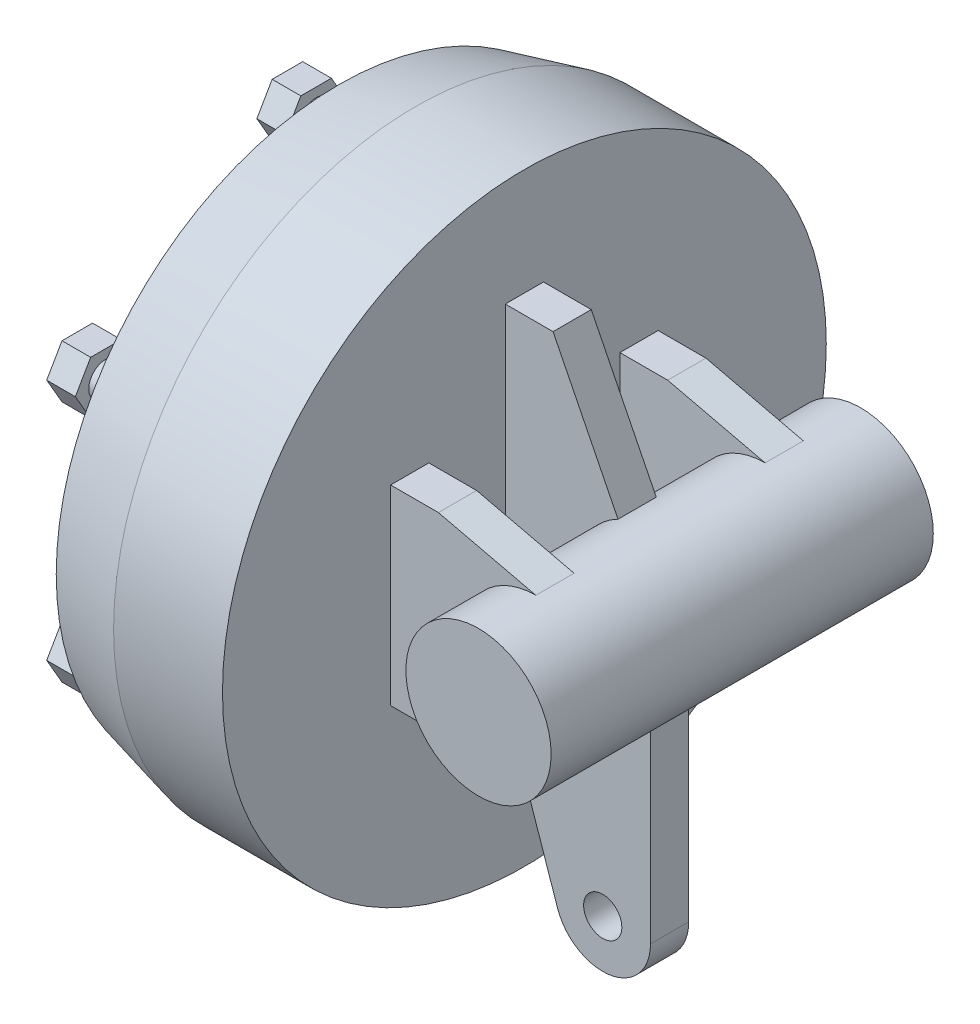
ISO-10303-21;
HEADER;
FILE_DESCRIPTION(('STEP AP214'),'2;1');
FILE_NAME('part.step','',(''),(''),'','','');
FILE_SCHEMA(('AUTOMOTIVE_DESIGN { 1 0 10303 214 1 1 1 1 }'));
ENDSEC;
DATA;
#1=APPLICATION_CONTEXT('core data for automotive mechanical design processes');
#2=APPLICATION_PROTOCOL_DEFINITION('international standard','automotive_design',2000,#1);
#3=PRODUCT_CONTEXT('',#1,'mechanical');
#4=PRODUCT('Part','Part','',(#3));
#5=PRODUCT_RELATED_PRODUCT_CATEGORY('part','',(#4));
#6=PRODUCT_DEFINITION_FORMATION('','',#4);
#7=PRODUCT_DEFINITION_CONTEXT('part definition',#1,'design');
#8=PRODUCT_DEFINITION('design','',#6,#7);
#9=PRODUCT_DEFINITION_SHAPE('','',#8);
#10=(LENGTH_UNIT() NAMED_UNIT(*) SI_UNIT(.MILLI.,.METRE.));
#11=(NAMED_UNIT(*) PLANE_ANGLE_UNIT() SI_UNIT($,.RADIAN.));
#12=(NAMED_UNIT(*) SI_UNIT($,.STERADIAN.) SOLID_ANGLE_UNIT());
#13=UNCERTAINTY_MEASURE_WITH_UNIT(LENGTH_MEASURE(1.E-05),#10,'distance_accuracy_value','');
#14=(GEOMETRIC_REPRESENTATION_CONTEXT(3) GLOBAL_UNCERTAINTY_ASSIGNED_CONTEXT((#13)) GLOBAL_UNIT_ASSIGNED_CONTEXT((#10,
#11,#12)) REPRESENTATION_CONTEXT('',''));
#15=CARTESIAN_POINT('',(0.,0.,0.));
#16=DIRECTION('',(0.,0.,1.));
#17=DIRECTION('',(1.,0.,0.));
#18=AXIS2_PLACEMENT_3D('',#15,#16,#17);
#19=CARTESIAN_POINT('',(-122.,76.,0.));
#20=DIRECTION('',(1.,0.,0.));
#21=DIRECTION('',(0.,0.,-1.));
#22=AXIS2_PLACEMENT_3D('',#19,#20,#21);
#23=PLANE('',#22);
#24=DIRECTION('',(0.,-0.866025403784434,0.500000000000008));
#25=VECTOR('',#24,1.);
#26=CARTESIAN_POINT('',(-122.,-29.9999999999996,44.9615242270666));
#27=LINE('',#26,#25);
#28=CARTESIAN_POINT('',(-122.,-29.9999999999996,44.9615242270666));
#29=VERTEX_POINT('',#28);
#30=CARTESIAN_POINT('',(-122.,-36.0621778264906,48.4615242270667));
#31=VERTEX_POINT('',#30);
#32=EDGE_CURVE('E619',#29,#31,#27,.T.);
#33=ORIENTED_EDGE('',*,*,#32,.F.);
#34=DIRECTION('',(0.,-0.866025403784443,-0.499999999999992));
#35=VECTOR('',#34,1.);
#36=CARTESIAN_POINT('',(-122.,-23.9378221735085,48.4615242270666));
#37=LINE('',#36,#35);
#38=CARTESIAN_POINT('',(-122.,-23.9378221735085,48.4615242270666));
#39=VERTEX_POINT('',#38);
#40=EDGE_CURVE('E632',#39,#29,#37,.T.);
#41=ORIENTED_EDGE('',*,*,#40,.F.);
#42=DIRECTION('',(0.,0.,-1.));
#43=VECTOR('',#42,1.);
#44=CARTESIAN_POINT('',(-122.,-23.9378221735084,55.4615242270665));
#45=LINE('',#44,#43);
#46=CARTESIAN_POINT('',(-122.,-23.9378221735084,55.4615242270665));
#47=VERTEX_POINT('',#46);
#48=EDGE_CURVE('E651',#47,#39,#45,.T.);
#49=ORIENTED_EDGE('',*,*,#48,.F.);
#50=DIRECTION('',(0.,0.866025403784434,-0.500000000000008));
#51=VECTOR('',#50,1.);
#52=CARTESIAN_POINT('',(-122.,-29.9999999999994,58.9615242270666));
#53=LINE('',#52,#51);
#54=CARTESIAN_POINT('',(-122.,-29.9999999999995,58.9615242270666));
#55=VERTEX_POINT('',#54);
#56=EDGE_CURVE('E648',#55,#47,#53,.T.);
#57=ORIENTED_EDGE('',*,*,#56,.F.);
#58=DIRECTION('',(0.,0.866025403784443,0.499999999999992));
#59=VECTOR('',#58,1.);
#60=CARTESIAN_POINT('',(-122.,-36.0621778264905,55.4615242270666));
#61=LINE('',#60,#59);
#62=CARTESIAN_POINT('',(-122.,-36.0621778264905,55.4615242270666));
#63=VERTEX_POINT('',#62);
#64=EDGE_CURVE('E645',#63,#55,#61,.T.);
#65=ORIENTED_EDGE('',*,*,#64,.F.);
#66=DIRECTION('',(0.,0.,1.));
#67=VECTOR('',#66,1.);
#68=CARTESIAN_POINT('',(-122.,-36.0621778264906,48.4615242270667));
#69=LINE('',#68,#67);
#70=EDGE_CURVE('E622',#31,#63,#69,.T.);
#71=ORIENTED_EDGE('',*,*,#70,.F.);
#72=EDGE_LOOP('',(#33,#41,#49,#57,#65,#71));
#73=FACE_BOUND('',#72,.T.);
#74=DIRECTION('',(0.,0.,-1.));
#75=VECTOR('',#74,1.);
#76=CARTESIAN_POINT('',(-122.,-23.9378221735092,-48.4615242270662));
#77=LINE('',#76,#75);
#78=CARTESIAN_POINT('',(-122.,-23.9378221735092,-48.4615242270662));
#79=VERTEX_POINT('',#78);
#80=CARTESIAN_POINT('',(-122.,-23.9378221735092,-55.4615242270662));
#81=VERTEX_POINT('',#80);
#82=EDGE_CURVE('E722',#79,#81,#77,.T.);
#83=ORIENTED_EDGE('',*,*,#82,.F.);
#84=DIRECTION('',(0.,0.866025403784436,-0.500000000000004));
#85=VECTOR('',#84,1.);
#86=CARTESIAN_POINT('',(-122.,-30.0000000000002,-44.9615242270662));
#87=LINE('',#86,#85);
#88=CARTESIAN_POINT('',(-122.,-30.0000000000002,-44.9615242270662));
#89=VERTEX_POINT('',#88);
#90=EDGE_CURVE('E727',#89,#79,#87,.T.);
#91=ORIENTED_EDGE('',*,*,#90,.F.);
#92=DIRECTION('',(0.,0.866025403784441,0.499999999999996));
#93=VECTOR('',#92,1.);
#94=CARTESIAN_POINT('',(-122.,-36.0621778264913,-48.4615242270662));
#95=LINE('',#94,#93);
#96=CARTESIAN_POINT('',(-122.,-36.0621778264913,-48.4615242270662));
#97=VERTEX_POINT('',#96);
#98=EDGE_CURVE('E749',#97,#89,#95,.T.);
#99=ORIENTED_EDGE('',*,*,#98,.F.);
#100=DIRECTION('',(0.,0.,1.));
#101=VECTOR('',#100,1.);
#102=CARTESIAN_POINT('',(-122.,-36.0621778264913,-55.4615242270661));
#103=LINE('',#102,#101);
#104=CARTESIAN_POINT('',(-122.,-36.0621778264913,-55.4615242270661));
#105=VERTEX_POINT('',#104);
#106=EDGE_CURVE('E746',#105,#97,#103,.T.);
#107=ORIENTED_EDGE('',*,*,#106,.F.);
#108=DIRECTION('',(0.,-0.866025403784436,0.500000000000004));
#109=VECTOR('',#108,1.);
#110=CARTESIAN_POINT('',(-122.,-30.0000000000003,-58.9615242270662));
#111=LINE('',#110,#109);
#112=CARTESIAN_POINT('',(-122.,-30.0000000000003,-58.9615242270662));
#113=VERTEX_POINT('',#112);
#114=EDGE_CURVE('E743',#113,#105,#111,.T.);
#115=ORIENTED_EDGE('',*,*,#114,.F.);
#116=DIRECTION('',(0.,-0.866025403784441,-0.499999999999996));
#117=VECTOR('',#116,1.);
#118=CARTESIAN_POINT('',(-122.,-23.9378221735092,-55.4615242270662));
#119=LINE('',#118,#117);
#120=EDGE_CURVE('E740',#81,#113,#119,.T.);
#121=ORIENTED_EDGE('',*,*,#120,.F.);
#122=EDGE_LOOP('',(#83,#91,#99,#107,#115,#121));
#123=FACE_BOUND('',#122,.T.);
#124=DIRECTION('',(0.,0.866025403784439,0.5));
#125=VECTOR('',#124,1.);
#126=CARTESIAN_POINT('',(-122.,53.9378221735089,3.49999999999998));
#127=LINE('',#126,#125);
#128=CARTESIAN_POINT('',(-122.,53.9378221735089,3.49999999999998));
#129=VERTEX_POINT('',#128);
#130=CARTESIAN_POINT('',(-122.,60.,6.99999999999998));
#131=VERTEX_POINT('',#130);
#132=EDGE_CURVE('E1080',#129,#131,#127,.T.);
#133=ORIENTED_EDGE('',*,*,#132,.F.);
#134=DIRECTION('',(0.,0.,1.));
#135=VECTOR('',#134,1.);
#136=CARTESIAN_POINT('',(-122.,53.9378221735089,-3.49999999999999));
#137=LINE('',#136,#135);
#138=CARTESIAN_POINT('',(-122.,53.9378221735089,-3.49999999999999));
#139=VERTEX_POINT('',#138);
#140=EDGE_CURVE('E1085',#139,#129,#137,.T.);
#141=ORIENTED_EDGE('',*,*,#140,.F.);
#142=DIRECTION('',(0.,-0.866025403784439,0.5));
#143=VECTOR('',#142,1.);
#144=CARTESIAN_POINT('',(-122.,60.,-6.99999999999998));
#145=LINE('',#144,#143);
#146=CARTESIAN_POINT('',(-122.,60.,-6.99999999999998));
#147=VERTEX_POINT('',#146);
#148=EDGE_CURVE('E1107',#147,#139,#145,.T.);
#149=ORIENTED_EDGE('',*,*,#148,.F.);
#150=DIRECTION('',(0.,-0.866025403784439,-0.5));
#151=VECTOR('',#150,1.);
#152=CARTESIAN_POINT('',(-122.,66.062177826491,-3.49999999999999));
#153=LINE('',#152,#151);
#154=CARTESIAN_POINT('',(-122.,66.062177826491,-3.49999999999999));
#155=VERTEX_POINT('',#154);
#156=EDGE_CURVE('E1104',#155,#147,#153,.T.);
#157=ORIENTED_EDGE('',*,*,#156,.F.);
#158=DIRECTION('',(0.,0.,-1.));
#159=VECTOR('',#158,1.);
#160=CARTESIAN_POINT('',(-122.,66.062177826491,3.50000000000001));
#161=LINE('',#160,#159);
#162=CARTESIAN_POINT('',(-122.,66.062177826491,3.50000000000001));
#163=VERTEX_POINT('',#162);
#164=EDGE_CURVE('E1101',#163,#155,#161,.T.);
#165=ORIENTED_EDGE('',*,*,#164,.F.);
#166=DIRECTION('',(0.,0.866025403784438,-0.5));
#167=VECTOR('',#166,1.);
#168=CARTESIAN_POINT('',(-122.,60.,6.99999999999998));
#169=LINE('',#168,#167);
#170=EDGE_CURVE('E1098',#131,#163,#169,.T.);
#171=ORIENTED_EDGE('',*,*,#170,.F.);
#172=EDGE_LOOP('',(#133,#141,#149,#157,#165,#171));
#173=FACE_BOUND('',#172,.T.);
#174=CARTESIAN_POINT('',(-122.,0.,0.));
#175=DIRECTION('',(-1.,0.,0.));
#176=DIRECTION('',(0.,0.,1.));
#177=AXIS2_PLACEMENT_3D('',#174,#175,#176);
#178=CIRCLE('',#177,50.);
#179=CARTESIAN_POINT('',(-122.,0.,50.));
#180=VERTEX_POINT('',#179);
#181=EDGE_CURVE('E1328',#180,#180,#178,.T.);
#182=ORIENTED_EDGE('',*,*,#181,.F.);
#183=EDGE_LOOP('',(#182));
#184=FACE_BOUND('',#183,.T.);
#185=CARTESIAN_POINT('',(-122.,0.,0.));
#186=DIRECTION('',(-1.,0.,0.));
#187=DIRECTION('',(0.,0.,1.));
#188=AXIS2_PLACEMENT_3D('',#185,#186,#187);
#189=CIRCLE('',#188,76.);
#190=CARTESIAN_POINT('',(-122.,0.,76.));
#191=VERTEX_POINT('',#190);
#192=EDGE_CURVE('E1331',#191,#191,#189,.T.);
#193=ORIENTED_EDGE('',*,*,#192,.T.);
#194=EDGE_LOOP('',(#193));
#195=FACE_BOUND('',#194,.T.);
#196=DIRECTION('',(0.,0.866025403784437,-0.500000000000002));
#197=VECTOR('',#196,1.);
#198=CARTESIAN_POINT('',(-122.,29.9999999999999,-44.9615242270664));
#199=LINE('',#198,#197);
#200=CARTESIAN_POINT('',(-122.,29.9999999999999,-44.9615242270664));
#201=VERTEX_POINT('',#200);
#202=CARTESIAN_POINT('',(-122.,36.062177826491,-48.4615242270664));
#203=VERTEX_POINT('',#202);
#204=EDGE_CURVE('E771',#201,#203,#199,.T.);
#205=ORIENTED_EDGE('',*,*,#204,.F.);
#206=DIRECTION('',(0.,0.86602540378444,0.499999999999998));
#207=VECTOR('',#206,1.);
#208=CARTESIAN_POINT('',(-122.,23.9378221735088,-48.4615242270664));
#209=LINE('',#208,#207);
#210=CARTESIAN_POINT('',(-122.,23.9378221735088,-48.4615242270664));
#211=VERTEX_POINT('',#210);
#212=EDGE_CURVE('E776',#211,#201,#209,.T.);
#213=ORIENTED_EDGE('',*,*,#212,.F.);
#214=DIRECTION('',(0.,0.,1.));
#215=VECTOR('',#214,1.);
#216=CARTESIAN_POINT('',(-122.,23.9378221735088,-55.4615242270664));
#217=LINE('',#216,#215);
#218=CARTESIAN_POINT('',(-122.,23.9378221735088,-55.4615242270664));
#219=VERTEX_POINT('',#218);
#220=EDGE_CURVE('E798',#219,#211,#217,.T.);
#221=ORIENTED_EDGE('',*,*,#220,.F.);
#222=DIRECTION('',(0.,-0.866025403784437,0.500000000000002));
#223=VECTOR('',#222,1.);
#224=CARTESIAN_POINT('',(-122.,29.9999999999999,-58.9615242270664));
#225=LINE('',#224,#223);
#226=CARTESIAN_POINT('',(-122.,29.9999999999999,-58.9615242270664));
#227=VERTEX_POINT('',#226);
#228=EDGE_CURVE('E795',#227,#219,#225,.T.);
#229=ORIENTED_EDGE('',*,*,#228,.F.);
#230=DIRECTION('',(0.,-0.86602540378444,-0.499999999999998));
#231=VECTOR('',#230,1.);
#232=CARTESIAN_POINT('',(-122.,36.0621778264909,-55.4615242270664));
#233=LINE('',#232,#231);
#234=CARTESIAN_POINT('',(-122.,36.0621778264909,-55.4615242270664));
#235=VERTEX_POINT('',#234);
#236=EDGE_CURVE('E792',#235,#227,#233,.T.);
#237=ORIENTED_EDGE('',*,*,#236,.F.);
#238=DIRECTION('',(0.,0.,-1.));
#239=VECTOR('',#238,1.);
#240=CARTESIAN_POINT('',(-122.,36.062177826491,-48.4615242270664));
#241=LINE('',#240,#239);
#242=EDGE_CURVE('E789',#203,#235,#241,.T.);
#243=ORIENTED_EDGE('',*,*,#242,.F.);
#244=EDGE_LOOP('',(#205,#213,#221,#229,#237,#243));
#245=FACE_BOUND('',#244,.T.);
#246=DIRECTION('',(0.,-0.866025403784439,-0.5));
#247=VECTOR('',#246,1.);
#248=CARTESIAN_POINT('',(-122.,-53.9378221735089,-3.49999999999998));
#249=LINE('',#248,#247);
#250=CARTESIAN_POINT('',(-122.,-53.9378221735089,-3.49999999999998));
#251=VERTEX_POINT('',#250);
#252=CARTESIAN_POINT('',(-122.,-60.,-6.99999999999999));
#253=VERTEX_POINT('',#252);
#254=EDGE_CURVE('E673',#251,#253,#249,.T.);
#255=ORIENTED_EDGE('',*,*,#254,.F.);
#256=DIRECTION('',(0.,0.,-1.));
#257=VECTOR('',#256,1.);
#258=CARTESIAN_POINT('',(-122.,-53.9378221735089,3.49999999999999));
#259=LINE('',#258,#257);
#260=CARTESIAN_POINT('',(-122.,-53.9378221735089,3.49999999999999));
#261=VERTEX_POINT('',#260);
#262=EDGE_CURVE('E678',#261,#251,#259,.T.);
#263=ORIENTED_EDGE('',*,*,#262,.F.);
#264=DIRECTION('',(0.,0.866025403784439,-0.5));
#265=VECTOR('',#264,1.);
#266=CARTESIAN_POINT('',(-122.,-60.,6.99999999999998));
#267=LINE('',#266,#265);
#268=CARTESIAN_POINT('',(-122.,-60.,6.99999999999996));
#269=VERTEX_POINT('',#268);
#270=EDGE_CURVE('E700',#269,#261,#267,.T.);
#271=ORIENTED_EDGE('',*,*,#270,.F.);
#272=DIRECTION('',(0.,0.866025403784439,0.5));
#273=VECTOR('',#272,1.);
#274=CARTESIAN_POINT('',(-122.,-66.062177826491,3.49999999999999));
#275=LINE('',#274,#273);
#276=CARTESIAN_POINT('',(-122.,-66.062177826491,3.5));
#277=VERTEX_POINT('',#276);
#278=EDGE_CURVE('E697',#277,#269,#275,.T.);
#279=ORIENTED_EDGE('',*,*,#278,.F.);
#280=DIRECTION('',(0.,0.,1.));
#281=VECTOR('',#280,1.);
#282=CARTESIAN_POINT('',(-122.,-66.062177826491,-3.50000000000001));
#283=LINE('',#282,#281);
#284=CARTESIAN_POINT('',(-122.,-66.0621778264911,-3.50000000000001));
#285=VERTEX_POINT('',#284);
#286=EDGE_CURVE('E694',#285,#277,#283,.T.);
#287=ORIENTED_EDGE('',*,*,#286,.F.);
#288=DIRECTION('',(0.,-0.866025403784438,0.5));
#289=VECTOR('',#288,1.);
#290=CARTESIAN_POINT('',(-122.,-60.,-6.99999999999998));
#291=LINE('',#290,#289);
#292=EDGE_CURVE('E691',#253,#285,#291,.T.);
#293=ORIENTED_EDGE('',*,*,#292,.F.);
#294=EDGE_LOOP('',(#255,#263,#271,#279,#287,#293));
#295=FACE_BOUND('',#294,.T.);
#296=DIRECTION('',(0.,0.,1.));
#297=VECTOR('',#296,1.);
#298=CARTESIAN_POINT('',(-122.,23.9378221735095,48.4615242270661));
#299=LINE('',#298,#297);
#300=CARTESIAN_POINT('',(-122.,23.9378221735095,48.4615242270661));
#301=VERTEX_POINT('',#300);
#302=CARTESIAN_POINT('',(-122.,23.9378221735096,55.461524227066));
#303=VERTEX_POINT('',#302);
#304=EDGE_CURVE('E618',#301,#303,#299,.T.);
#305=ORIENTED_EDGE('',*,*,#304,.F.);
#306=DIRECTION('',(0.,-0.866025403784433,0.50000000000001));
#307=VECTOR('',#306,1.);
#308=CARTESIAN_POINT('',(-122.,30.0000000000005,44.961524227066));
#309=LINE('',#308,#307);
#310=CARTESIAN_POINT('',(-122.,30.0000000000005,44.961524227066));
#311=VERTEX_POINT('',#310);
#312=EDGE_CURVE('E615',#311,#301,#309,.T.);
#313=ORIENTED_EDGE('',*,*,#312,.F.);
#314=DIRECTION('',(0.,-0.866025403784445,-0.49999999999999));
#315=VECTOR('',#314,1.);
#316=CARTESIAN_POINT('',(-122.,36.0621778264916,48.4615242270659));
#317=LINE('',#316,#315);
#318=CARTESIAN_POINT('',(-122.,36.0621778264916,48.4615242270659));
#319=VERTEX_POINT('',#318);
#320=EDGE_CURVE('E1592',#319,#311,#317,.T.);
#321=ORIENTED_EDGE('',*,*,#320,.F.);
#322=DIRECTION('',(0.,0.,-1.));
#323=VECTOR('',#322,1.);
#324=CARTESIAN_POINT('',(-122.,36.0621778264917,55.4615242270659));
#325=LINE('',#324,#323);
#326=CARTESIAN_POINT('',(-122.,36.0621778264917,55.4615242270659));
#327=VERTEX_POINT('',#326);
#328=EDGE_CURVE('E1609',#327,#319,#325,.T.);
#329=ORIENTED_EDGE('',*,*,#328,.F.);
#330=DIRECTION('',(0.,0.866025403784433,-0.50000000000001));
#331=VECTOR('',#330,1.);
#332=CARTESIAN_POINT('',(-122.,30.0000000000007,58.961524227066));
#333=LINE('',#332,#331);
#334=CARTESIAN_POINT('',(-122.,30.0000000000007,58.961524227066));
#335=VERTEX_POINT('',#334);
#336=EDGE_CURVE('E55',#335,#327,#333,.T.);
#337=ORIENTED_EDGE('',*,*,#336,.F.);
#338=DIRECTION('',(0.,0.866025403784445,0.49999999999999));
#339=VECTOR('',#338,1.);
#340=CARTESIAN_POINT('',(-122.,23.9378221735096,55.461524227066));
#341=LINE('',#340,#339);
#342=EDGE_CURVE('E50',#303,#335,#341,.T.);
#343=ORIENTED_EDGE('',*,*,#342,.F.);
#344=EDGE_LOOP('',(#305,#313,#321,#329,#337,#343));
#345=FACE_BOUND('',#344,.T.);
#346=ADVANCED_FACE('F35',(#73,#123,#173,#184,#195,#245,#295,#345),#23,.F.);
#347=CARTESIAN_POINT('',(-127.,63.5000000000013,109.985226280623));
#348=DIRECTION('',(1.,0.,0.));
#349=DIRECTION('',(0.,0.,-1.));
#350=AXIS2_PLACEMENT_3D('',#347,#348,#349);
#351=CYLINDRICAL_SURFACE('',#350,9.);
#352=CARTESIAN_POINT('',(-97.,63.5000000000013,109.985226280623));
#353=DIRECTION('',(1.,0.,0.));
#354=DIRECTION('',(0.,0.,-1.));
#355=AXIS2_PLACEMENT_3D('',#352,#353,#354);
#356=CIRCLE('',#355,9.);
#357=CARTESIAN_POINT('',(-97.,63.5000000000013,100.985226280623));
#358=VERTEX_POINT('',#357);
#359=EDGE_CURVE('E1385',#358,#358,#356,.F.);
#360=ORIENTED_EDGE('',*,*,#359,.T.);
#361=EDGE_LOOP('',(#360));
#362=FACE_BOUND('',#361,.T.);
#363=CARTESIAN_POINT('',(-109.,63.5000000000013,109.985226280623));
#364=DIRECTION('',(-1.,0.,0.));
#365=DIRECTION('',(0.,0.,1.));
#366=AXIS2_PLACEMENT_3D('',#363,#364,#365);
#367=CIRCLE('',#366,9.);
#368=CARTESIAN_POINT('',(-109.,63.5000000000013,118.985226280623));
#369=VERTEX_POINT('',#368);
#370=EDGE_CURVE('E11',#369,#369,#367,.T.);
#371=ORIENTED_EDGE('',*,*,#370,.F.);
#372=EDGE_LOOP('',(#371));
#373=FACE_BOUND('',#372,.T.);
#374=ADVANCED_FACE('F1430',(#362,#373),#351,.T.);
#375=CARTESIAN_POINT('',(-127.,-63.499999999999,109.985226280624));
#376=DIRECTION('',(1.,0.,0.));
#377=DIRECTION('',(0.,0.,-1.));
#378=AXIS2_PLACEMENT_3D('',#375,#376,#377);
#379=CYLINDRICAL_SURFACE('',#378,9.);
#380=CARTESIAN_POINT('',(-97.,-63.499999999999,109.985226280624));
#381=DIRECTION('',(1.,0.,0.));
#382=DIRECTION('',(0.,0.,-1.));
#383=AXIS2_PLACEMENT_3D('',#380,#381,#382);
#384=CIRCLE('',#383,9.);
#385=CARTESIAN_POINT('',(-97.,-63.499999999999,100.985226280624));
#386=VERTEX_POINT('',#385);
#387=EDGE_CURVE('E1382',#386,#386,#384,.F.);
#388=ORIENTED_EDGE('',*,*,#387,.T.);
#389=EDGE_LOOP('',(#388));
#390=FACE_BOUND('',#389,.T.);
#391=CARTESIAN_POINT('',(-109.,-63.499999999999,109.985226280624));
#392=DIRECTION('',(-1.,0.,0.));
#393=DIRECTION('',(0.,0.,1.));
#394=AXIS2_PLACEMENT_3D('',#391,#392,#393);
#395=CIRCLE('',#394,9.);
#396=CARTESIAN_POINT('',(-109.,-63.499999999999,118.985226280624));
#397=VERTEX_POINT('',#396);
#398=EDGE_CURVE('E43',#397,#397,#395,.T.);
#399=ORIENTED_EDGE('',*,*,#398,.F.);
#400=EDGE_LOOP('',(#399));
#401=FACE_BOUND('',#400,.T.);
#402=ADVANCED_FACE('F1436',(#390,#401),#379,.T.);
#403=CARTESIAN_POINT('',(-127.,-127.,0.));
#404=DIRECTION('',(1.,0.,0.));
#405=DIRECTION('',(0.,0.,-1.));
#406=AXIS2_PLACEMENT_3D('',#403,#404,#405);
#407=CYLINDRICAL_SURFACE('',#406,9.);
#408=CARTESIAN_POINT('',(-97.,-127.,0.));
#409=DIRECTION('',(1.,0.,0.));
#410=DIRECTION('',(0.,0.,-1.));
#411=AXIS2_PLACEMENT_3D('',#408,#409,#410);
#412=CIRCLE('',#411,9.);
#413=CARTESIAN_POINT('',(-97.,-127.,-9.));
#414=VERTEX_POINT('',#413);
#415=EDGE_CURVE('E1379',#414,#414,#412,.F.);
#416=ORIENTED_EDGE('',*,*,#415,.T.);
#417=EDGE_LOOP('',(#416));
#418=FACE_BOUND('',#417,.T.);
#419=CARTESIAN_POINT('',(-109.,-127.,0.));
#420=DIRECTION('',(-1.,0.,0.));
#421=DIRECTION('',(0.,0.,1.));
#422=AXIS2_PLACEMENT_3D('',#419,#420,#421);
#423=CIRCLE('',#422,9.);
#424=CARTESIAN_POINT('',(-109.,-127.,9.));
#425=VERTEX_POINT('',#424);
#426=EDGE_CURVE('E1398',#425,#425,#423,.T.);
#427=ORIENTED_EDGE('',*,*,#426,.F.);
#428=EDGE_LOOP('',(#427));
#429=FACE_BOUND('',#428,.T.);
#430=ADVANCED_FACE('F1790',(#418,#429),#407,.T.);
#431=CARTESIAN_POINT('',(-127.,-63.5000000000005,-109.985226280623));
#432=DIRECTION('',(1.,0.,0.));
#433=DIRECTION('',(0.,0.,-1.));
#434=AXIS2_PLACEMENT_3D('',#431,#432,#433);
#435=CYLINDRICAL_SURFACE('',#434,9.);
#436=CARTESIAN_POINT('',(-97.,-63.5000000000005,-109.985226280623));
#437=DIRECTION('',(1.,0.,0.));
#438=DIRECTION('',(0.,0.,-1.));
#439=AXIS2_PLACEMENT_3D('',#436,#437,#438);
#440=CIRCLE('',#439,9.);
#441=CARTESIAN_POINT('',(-97.,-63.5000000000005,-118.985226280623));
#442=VERTEX_POINT('',#441);
#443=EDGE_CURVE('E1376',#442,#442,#440,.F.);
#444=ORIENTED_EDGE('',*,*,#443,.T.);
#445=EDGE_LOOP('',(#444));
#446=FACE_BOUND('',#445,.T.);
#447=CARTESIAN_POINT('',(-109.,-63.5000000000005,-109.985226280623));
#448=DIRECTION('',(-1.,0.,0.));
#449=DIRECTION('',(0.,0.,1.));
#450=AXIS2_PLACEMENT_3D('',#447,#448,#449);
#451=CIRCLE('',#450,9.);
#452=CARTESIAN_POINT('',(-109.,-63.5000000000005,-100.985226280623));
#453=VERTEX_POINT('',#452);
#454=EDGE_CURVE('E1393',#453,#453,#451,.T.);
#455=ORIENTED_EDGE('',*,*,#454,.F.);
#456=EDGE_LOOP('',(#455));
#457=FACE_BOUND('',#456,.T.);
#458=ADVANCED_FACE('F1801',(#446,#457),#435,.T.);
#459=CARTESIAN_POINT('',(-127.,63.4999999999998,-109.985226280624));
#460=DIRECTION('',(1.,0.,0.));
#461=DIRECTION('',(0.,0.,-1.));
#462=AXIS2_PLACEMENT_3D('',#459,#460,#461);
#463=CYLINDRICAL_SURFACE('',#462,9.);
#464=CARTESIAN_POINT('',(-97.,63.4999999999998,-109.985226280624));
#465=DIRECTION('',(1.,0.,0.));
#466=DIRECTION('',(0.,0.,-1.));
#467=AXIS2_PLACEMENT_3D('',#464,#465,#466);
#468=CIRCLE('',#467,9.);
#469=CARTESIAN_POINT('',(-97.,63.4999999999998,-118.985226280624));
#470=VERTEX_POINT('',#469);
#471=EDGE_CURVE('E1373',#470,#470,#468,.F.);
#472=ORIENTED_EDGE('',*,*,#471,.T.);
#473=EDGE_LOOP('',(#472));
#474=FACE_BOUND('',#473,.T.);
#475=CARTESIAN_POINT('',(-109.,63.4999999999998,-109.985226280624));
#476=DIRECTION('',(-1.,0.,0.));
#477=DIRECTION('',(0.,0.,1.));
#478=AXIS2_PLACEMENT_3D('',#475,#476,#477);
#479=CIRCLE('',#478,9.);
#480=CARTESIAN_POINT('',(-109.,63.4999999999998,-100.985226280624));
#481=VERTEX_POINT('',#480);
#482=EDGE_CURVE('E1388',#481,#481,#479,.T.);
#483=ORIENTED_EDGE('',*,*,#482,.F.);
#484=EDGE_LOOP('',(#483));
#485=FACE_BOUND('',#484,.T.);
#486=ADVANCED_FACE('F1453',(#474,#485),#463,.T.);
#487=CARTESIAN_POINT('',(-97.,148.,0.));
#488=DIRECTION('',(1.,0.,0.));
#489=DIRECTION('',(0.,0.,-1.));
#490=AXIS2_PLACEMENT_3D('',#487,#488,#489);
#491=PLANE('',#490);
#492=ORIENTED_EDGE('',*,*,#387,.F.);
#493=EDGE_LOOP('',(#492));
#494=FACE_BOUND('',#493,.T.);
#495=ORIENTED_EDGE('',*,*,#443,.F.);
#496=EDGE_LOOP('',(#495));
#497=FACE_BOUND('',#496,.T.);
#498=CARTESIAN_POINT('',(-97.,127.,0.));
#499=DIRECTION('',(1.,0.,0.));
#500=DIRECTION('',(0.,0.,-1.));
#501=AXIS2_PLACEMENT_3D('',#498,#499,#500);
#502=CIRCLE('',#501,9.);
#503=CARTESIAN_POINT('',(-97.,127.,-9.));
#504=VERTEX_POINT('',#503);
#505=EDGE_CURVE('E1365',#504,#504,#502,.F.);
#506=ORIENTED_EDGE('',*,*,#505,.F.);
#507=EDGE_LOOP('',(#506));
#508=FACE_BOUND('',#507,.T.);
#509=CARTESIAN_POINT('',(-97.,0.,0.));
#510=DIRECTION('',(-1.,0.,0.));
#511=DIRECTION('',(0.,0.,1.));
#512=AXIS2_PLACEMENT_3D('',#509,#510,#511);
#513=CIRCLE('',#512,76.);
#514=CARTESIAN_POINT('',(-97.,0.,76.));
#515=VERTEX_POINT('',#514);
#516=EDGE_CURVE('E1334',#515,#515,#513,.T.);
#517=ORIENTED_EDGE('',*,*,#516,.F.);
#518=EDGE_LOOP('',(#517));
#519=FACE_BOUND('',#518,.T.);
#520=CARTESIAN_POINT('',(-97.,0.,0.));
#521=DIRECTION('',(-1.,0.,0.));
#522=DIRECTION('',(0.,0.,1.));
#523=AXIS2_PLACEMENT_3D('',#520,#521,#522);
#524=CIRCLE('',#523,148.);
#525=CARTESIAN_POINT('',(-97.,0.,148.));
#526=VERTEX_POINT('',#525);
#527=EDGE_CURVE('E1337',#526,#526,#524,.T.);
#528=ORIENTED_EDGE('',*,*,#527,.T.);
#529=EDGE_LOOP('',(#528));
#530=FACE_BOUND('',#529,.T.);
#531=ORIENTED_EDGE('',*,*,#471,.F.);
#532=EDGE_LOOP('',(#531));
#533=FACE_BOUND('',#532,.T.);
#534=ORIENTED_EDGE('',*,*,#415,.F.);
#535=EDGE_LOOP('',(#534));
#536=FACE_BOUND('',#535,.T.);
#537=ORIENTED_EDGE('',*,*,#359,.F.);
#538=EDGE_LOOP('',(#537));
#539=FACE_BOUND('',#538,.T.);
#540=ADVANCED_FACE('F1449',(#494,#497,#508,#519,#530,#533,#536,#539),#491,.F.);
#541=CARTESIAN_POINT('',(-127.,127.,0.));
#542=DIRECTION('',(1.,0.,0.));
#543=DIRECTION('',(0.,0.,-1.));
#544=AXIS2_PLACEMENT_3D('',#541,#542,#543);
#545=CYLINDRICAL_SURFACE('',#544,9.);
#546=ORIENTED_EDGE('',*,*,#505,.T.);
#547=EDGE_LOOP('',(#546));
#548=FACE_BOUND('',#547,.T.);
#549=CARTESIAN_POINT('',(-109.,127.,0.));
#550=DIRECTION('',(-1.,0.,0.));
#551=DIRECTION('',(0.,0.,1.));
#552=AXIS2_PLACEMENT_3D('',#549,#550,#551);
#553=CIRCLE('',#552,9.);
#554=CARTESIAN_POINT('',(-109.,127.,9.));
#555=VERTEX_POINT('',#554);
#556=EDGE_CURVE('E1368',#555,#555,#553,.T.);
#557=ORIENTED_EDGE('',*,*,#556,.F.);
#558=EDGE_LOOP('',(#557));
#559=FACE_BOUND('',#558,.T.);
#560=ADVANCED_FACE('F1452',(#548,#559),#545,.T.);
#561=CARTESIAN_POINT('',(0.,0.,0.));
#562=DIRECTION('',(-1.,0.,0.));
#563=DIRECTION('',(0.,0.,1.));
#564=AXIS2_PLACEMENT_3D('',#561,#562,#563);
#565=PLANE('',#564);
#566=CARTESIAN_POINT('',(0.,0.,0.));
#567=DIRECTION('',(-1.,0.,0.));
#568=DIRECTION('',(0.,0.,1.));
#569=AXIS2_PLACEMENT_3D('',#566,#567,#568);
#570=CIRCLE('',#569,158.);
#571=CARTESIAN_POINT('',(0.,0.,158.));
#572=VERTEX_POINT('',#571);
#573=EDGE_CURVE('E1343',#572,#572,#570,.T.);
#574=ORIENTED_EDGE('',*,*,#573,.F.);
#575=EDGE_LOOP('',(#574));
#576=FACE_BOUND('',#575,.T.);
#577=DIRECTION('',(0.,0.,-1.));
#578=VECTOR('',#577,1.);
#579=CARTESIAN_POINT('',(0.,-50.,70.));
#580=LINE('',#579,#578);
#581=CARTESIAN_POINT('',(0.,-50.,70.));
#582=VERTEX_POINT('',#581);
#583=CARTESIAN_POINT('',(0.,-50.,50.));
#584=VERTEX_POINT('',#583);
#585=EDGE_CURVE('E1320',#582,#584,#580,.T.);
#586=ORIENTED_EDGE('',*,*,#585,.F.);
#587=DIRECTION('',(0.,-1.,0.));
#588=VECTOR('',#587,1.);
#589=CARTESIAN_POINT('',(0.,-50.,70.));
#590=LINE('',#589,#588);
#591=CARTESIAN_POINT('',(0.,50.,70.));
#592=VERTEX_POINT('',#591);
#593=EDGE_CURVE('E1288',#592,#582,#590,.T.);
#594=ORIENTED_EDGE('',*,*,#593,.F.);
#595=DIRECTION('',(0.,0.,-1.));
#596=VECTOR('',#595,1.);
#597=CARTESIAN_POINT('',(0.,50.,70.));
#598=LINE('',#597,#596);
#599=CARTESIAN_POINT('',(0.,50.,50.));
#600=VERTEX_POINT('',#599);
#601=EDGE_CURVE('E1323',#592,#600,#598,.T.);
#602=ORIENTED_EDGE('',*,*,#601,.T.);
#603=DIRECTION('',(0.,-1.,0.));
#604=VECTOR('',#603,1.);
#605=CARTESIAN_POINT('',(0.,-50.,50.));
#606=LINE('',#605,#604);
#607=EDGE_CURVE('E1302',#600,#584,#606,.T.);
#608=ORIENTED_EDGE('',*,*,#607,.T.);
#609=EDGE_LOOP('',(#586,#594,#602,#608));
#610=FACE_BOUND('',#609,.T.);
#611=DIRECTION('',(0.,0.,1.));
#612=VECTOR('',#611,1.);
#613=CARTESIAN_POINT('',(0.,50.,-70.));
#614=LINE('',#613,#612);
#615=CARTESIAN_POINT('',(0.,50.,-70.));
#616=VERTEX_POINT('',#615);
#617=CARTESIAN_POINT('',(0.,50.,-50.));
#618=VERTEX_POINT('',#617);
#619=EDGE_CURVE('E1249',#616,#618,#614,.T.);
#620=ORIENTED_EDGE('',*,*,#619,.F.);
#621=DIRECTION('',(0.,-1.,0.));
#622=VECTOR('',#621,1.);
#623=CARTESIAN_POINT('',(0.,-50.,-70.));
#624=LINE('',#623,#622);
#625=CARTESIAN_POINT('',(0.,-50.,-70.));
#626=VERTEX_POINT('',#625);
#627=EDGE_CURVE('E1247',#616,#626,#624,.T.);
#628=ORIENTED_EDGE('',*,*,#627,.T.);
#629=DIRECTION('',(0.,0.,1.));
#630=VECTOR('',#629,1.);
#631=CARTESIAN_POINT('',(0.,-50.,-70.));
#632=LINE('',#631,#630);
#633=CARTESIAN_POINT('',(0.,-50.,-50.));
#634=VERTEX_POINT('',#633);
#635=EDGE_CURVE('E1264',#626,#634,#632,.T.);
#636=ORIENTED_EDGE('',*,*,#635,.T.);
#637=DIRECTION('',(0.,-1.,0.));
#638=VECTOR('',#637,1.);
#639=CARTESIAN_POINT('',(0.,-50.,-50.));
#640=LINE('',#639,#638);
#641=EDGE_CURVE('E1238',#618,#634,#640,.T.);
#642=ORIENTED_EDGE('',*,*,#641,.F.);
#643=EDGE_LOOP('',(#620,#628,#636,#642));
#644=FACE_BOUND('',#643,.T.);
#645=DIRECTION('',(0.,-1.,0.));
#646=VECTOR('',#645,1.);
#647=CARTESIAN_POINT('',(0.,-78.,-10.));
#648=LINE('',#647,#646);
#649=CARTESIAN_POINT('',(0.,102.,-10.));
#650=VERTEX_POINT('',#649);
#651=CARTESIAN_POINT('',(0.,-78.,-10.));
#652=VERTEX_POINT('',#651);
#653=EDGE_CURVE('E1203',#650,#652,#648,.T.);
#654=ORIENTED_EDGE('',*,*,#653,.T.);
#655=DIRECTION('',(0.,0.,1.));
#656=VECTOR('',#655,1.);
#657=CARTESIAN_POINT('',(0.,-78.,-10.));
#658=LINE('',#657,#656);
#659=CARTESIAN_POINT('',(0.,-78.,10.));
#660=VERTEX_POINT('',#659);
#661=EDGE_CURVE('E1220',#652,#660,#658,.T.);
#662=ORIENTED_EDGE('',*,*,#661,.T.);
#663=DIRECTION('',(0.,-1.,0.));
#664=VECTOR('',#663,1.);
#665=CARTESIAN_POINT('',(0.,-78.,10.));
#666=LINE('',#665,#664);
#667=CARTESIAN_POINT('',(0.,102.,10.));
#668=VERTEX_POINT('',#667);
#669=EDGE_CURVE('E1187',#668,#660,#666,.T.);
#670=ORIENTED_EDGE('',*,*,#669,.F.);
#671=DIRECTION('',(0.,0.,1.));
#672=VECTOR('',#671,1.);
#673=CARTESIAN_POINT('',(0.,102.,-10.));
#674=LINE('',#673,#672);
#675=EDGE_CURVE('E1221',#650,#668,#674,.T.);
#676=ORIENTED_EDGE('',*,*,#675,.F.);
#677=EDGE_LOOP('',(#654,#662,#670,#676));
#678=FACE_BOUND('',#677,.T.);
#679=ADVANCED_FACE('F37',(#576,#610,#644,#678),#565,.F.);
#680=CARTESIAN_POINT('',(76.,0.,-100.));
#681=DIRECTION('',(0.,0.,1.));
#682=DIRECTION('',(1.,0.,0.));
#683=AXIS2_PLACEMENT_3D('',#680,#681,#682);
#684=CYLINDRICAL_SURFACE('',#683,38.);
#685=CARTESIAN_POINT('',(76.,0.,100.));
#686=DIRECTION('',(0.,0.,1.));
#687=DIRECTION('',(1.,0.,0.));
#688=AXIS2_PLACEMENT_3D('',#685,#686,#687);
#689=CIRCLE('',#688,38.);
#690=CARTESIAN_POINT('',(114.,0.,100.));
#691=VERTEX_POINT('',#690);
#692=EDGE_CURVE('E1276',#691,#691,#689,.T.);
#693=ORIENTED_EDGE('',*,*,#692,.F.);
#694=EDGE_LOOP('',(#693));
#695=FACE_BOUND('',#694,.T.);
#696=CARTESIAN_POINT('',(76.,0.,-100.));
#697=DIRECTION('',(0.,0.,1.));
#698=DIRECTION('',(1.,0.,0.));
#699=AXIS2_PLACEMENT_3D('',#696,#697,#698);
#700=CIRCLE('',#699,38.);
#701=CARTESIAN_POINT('',(114.,0.,-100.));
#702=VERTEX_POINT('',#701);
#703=EDGE_CURVE('E1279',#702,#702,#700,.T.);
#704=ORIENTED_EDGE('',*,*,#703,.T.);
#705=EDGE_LOOP('',(#704));
#706=FACE_BOUND('',#705,.T.);
#707=DIRECTION('',(0.,0.,-1.));
#708=VECTOR('',#707,1.);
#709=CARTESIAN_POINT('',(76.,38.,70.));
#710=LINE('',#709,#708);
#711=CARTESIAN_POINT('',(76.,38.,70.));
#712=VERTEX_POINT('',#711);
#713=CARTESIAN_POINT('',(76.,38.,50.));
#714=VERTEX_POINT('',#713);
#715=EDGE_CURVE('E1312',#712,#714,#710,.T.);
#716=ORIENTED_EDGE('',*,*,#715,.F.);
#717=CARTESIAN_POINT('',(76.,0.,70.));
#718=DIRECTION('',(0.,0.,1.));
#719=DIRECTION('',(1.,0.,0.));
#720=AXIS2_PLACEMENT_3D('',#717,#718,#719);
#721=CIRCLE('',#720,38.);
#722=CARTESIAN_POINT('',(76.,-38.,70.));
#723=VERTEX_POINT('',#722);
#724=EDGE_CURVE('E1282',#712,#723,#721,.T.);
#725=ORIENTED_EDGE('',*,*,#724,.T.);
#726=DIRECTION('',(0.,0.,-1.));
#727=VECTOR('',#726,1.);
#728=CARTESIAN_POINT('',(76.,-38.,70.));
#729=LINE('',#728,#727);
#730=CARTESIAN_POINT('',(76.,-38.,50.));
#731=VERTEX_POINT('',#730);
#732=EDGE_CURVE('E1315',#723,#731,#729,.T.);
#733=ORIENTED_EDGE('',*,*,#732,.T.);
#734=CARTESIAN_POINT('',(76.,0.,50.));
#735=DIRECTION('',(0.,0.,1.));
#736=DIRECTION('',(1.,0.,0.));
#737=AXIS2_PLACEMENT_3D('',#734,#735,#736);
#738=CIRCLE('',#737,38.);
#739=EDGE_CURVE('E1346',#714,#731,#738,.T.);
#740=ORIENTED_EDGE('',*,*,#739,.F.);
#741=EDGE_LOOP('',(#716,#725,#733,#740));
#742=FACE_BOUND('',#741,.T.);
#743=CARTESIAN_POINT('',(76.,0.,-70.));
#744=DIRECTION('',(0.,0.,-1.));
#745=DIRECTION('',(-1.,0.,0.));
#746=AXIS2_PLACEMENT_3D('',#743,#744,#745);
#747=CIRCLE('',#746,38.);
#748=CARTESIAN_POINT('',(76.,38.,-70.));
#749=VERTEX_POINT('',#748);
#750=CARTESIAN_POINT('',(76.,-38.,-70.));
#751=VERTEX_POINT('',#750);
#752=EDGE_CURVE('E1352',#749,#751,#747,.F.);
#753=ORIENTED_EDGE('',*,*,#752,.F.);
#754=DIRECTION('',(0.,0.,1.));
#755=VECTOR('',#754,1.);
#756=CARTESIAN_POINT('',(76.,38.,-70.));
#757=LINE('',#756,#755);
#758=CARTESIAN_POINT('',(76.,38.,-50.));
#759=VERTEX_POINT('',#758);
#760=EDGE_CURVE('E1271',#749,#759,#757,.T.);
#761=ORIENTED_EDGE('',*,*,#760,.T.);
#762=CARTESIAN_POINT('',(76.,0.,-50.));
#763=DIRECTION('',(0.,0.,-1.));
#764=DIRECTION('',(-1.,0.,0.));
#765=AXIS2_PLACEMENT_3D('',#762,#763,#764);
#766=CIRCLE('',#765,38.);
#767=CARTESIAN_POINT('',(76.,-38.,-50.));
#768=VERTEX_POINT('',#767);
#769=EDGE_CURVE('E1349',#759,#768,#766,.F.);
#770=ORIENTED_EDGE('',*,*,#769,.T.);
#771=DIRECTION('',(0.,0.,1.));
#772=VECTOR('',#771,1.);
#773=CARTESIAN_POINT('',(76.,-38.,-70.));
#774=LINE('',#773,#772);
#775=EDGE_CURVE('E1268',#751,#768,#774,.T.);
#776=ORIENTED_EDGE('',*,*,#775,.F.);
#777=EDGE_LOOP('',(#753,#761,#770,#776));
#778=FACE_BOUND('',#777,.T.);
#779=DIRECTION('',(0.,0.,1.));
#780=VECTOR('',#779,1.);
#781=CARTESIAN_POINT('',(76.,-38.,-100.));
#782=LINE('',#781,#780);
#783=CARTESIAN_POINT('',(76.,-38.,-9.99999999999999));
#784=VERTEX_POINT('',#783);
#785=CARTESIAN_POINT('',(76.,-38.,9.99999999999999));
#786=VERTEX_POINT('',#785);
#787=EDGE_CURVE('E1357',#784,#786,#782,.T.);
#788=ORIENTED_EDGE('',*,*,#787,.F.);
#789=CARTESIAN_POINT('',(76.,0.,-9.99999999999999));
#790=DIRECTION('',(0.,0.,1.));
#791=DIRECTION('',(1.,0.,0.));
#792=AXIS2_PLACEMENT_3D('',#789,#790,#791);
#793=CIRCLE('',#792,38.);
#794=CARTESIAN_POINT('',(59.0058833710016,33.9882332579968,-9.99999999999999));
#795=VERTEX_POINT('',#794);
#796=EDGE_CURVE('E1363',#784,#795,#793,.F.);
#797=ORIENTED_EDGE('',*,*,#796,.T.);
#798=DIRECTION('',(0.,0.,1.));
#799=VECTOR('',#798,1.);
#800=CARTESIAN_POINT('',(59.0058833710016,33.9882332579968,-100.));
#801=LINE('',#800,#799);
#802=CARTESIAN_POINT('',(59.0058833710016,33.9882332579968,9.99999999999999));
#803=VERTEX_POINT('',#802);
#804=EDGE_CURVE('E1360',#803,#795,#801,.F.);
#805=ORIENTED_EDGE('',*,*,#804,.F.);
#806=CARTESIAN_POINT('',(76.,0.,9.99999999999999));
#807=DIRECTION('',(0.,0.,1.));
#808=DIRECTION('',(1.,0.,0.));
#809=AXIS2_PLACEMENT_3D('',#806,#807,#808);
#810=CIRCLE('',#809,38.);
#811=EDGE_CURVE('E1354',#786,#803,#810,.F.);
#812=ORIENTED_EDGE('',*,*,#811,.F.);
#813=EDGE_LOOP('',(#788,#797,#805,#812));
#814=FACE_BOUND('',#813,.T.);
#815=ADVANCED_FACE('F1459',(#695,#706,#742,#778,#814),#684,.T.);
#816=CARTESIAN_POINT('',(-147.,0.,0.));
#817=DIRECTION('',(-1.,0.,0.));
#818=DIRECTION('',(0.,0.,1.));
#819=AXIS2_PLACEMENT_3D('',#816,#817,#818);
#820=CYLINDRICAL_SURFACE('',#819,158.);
#821=CARTESIAN_POINT('',(-57.,0.,0.));
#822=DIRECTION('',(-1.,0.,0.));
#823=DIRECTION('',(0.,0.,1.));
#824=AXIS2_PLACEMENT_3D('',#821,#822,#823);
#825=CIRCLE('',#824,158.);
#826=CARTESIAN_POINT('',(-57.,0.,158.));
#827=VERTEX_POINT('',#826);
#828=EDGE_CURVE('E1340',#827,#827,#825,.T.);
#829=ORIENTED_EDGE('',*,*,#828,.F.);
#830=EDGE_LOOP('',(#829));
#831=FACE_BOUND('',#830,.T.);
#832=ORIENTED_EDGE('',*,*,#573,.T.);
#833=EDGE_LOOP('',(#832));
#834=FACE_BOUND('',#833,.T.);
#835=ADVANCED_FACE('F1456',(#831,#834),#820,.T.);
#836=CARTESIAN_POINT('',(-57.,0.,0.));
#837=DIRECTION('',(1.,0.,0.));
#838=DIRECTION('',(0.,0.,-1.));
#839=AXIS2_PLACEMENT_3D('',#836,#837,#838);
#840=CONICAL_SURFACE('',#839,158.,0.244978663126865);
#841=ORIENTED_EDGE('',*,*,#527,.F.);
#842=EDGE_LOOP('',(#841));
#843=FACE_BOUND('',#842,.T.);
#844=ORIENTED_EDGE('',*,*,#828,.T.);
#845=EDGE_LOOP('',(#844));
#846=FACE_BOUND('',#845,.T.);
#847=ADVANCED_FACE('F1447',(#843,#846),#840,.T.);
#848=CARTESIAN_POINT('',(-147.,0.,0.));
#849=DIRECTION('',(-1.,0.,0.));
#850=DIRECTION('',(0.,0.,1.));
#851=AXIS2_PLACEMENT_3D('',#848,#849,#850);
#852=CYLINDRICAL_SURFACE('',#851,76.);
#853=ORIENTED_EDGE('',*,*,#192,.F.);
#854=EDGE_LOOP('',(#853));
#855=FACE_BOUND('',#854,.T.);
#856=ORIENTED_EDGE('',*,*,#516,.T.);
#857=EDGE_LOOP('',(#856));
#858=FACE_BOUND('',#857,.T.);
#859=ADVANCED_FACE('F1444',(#855,#858),#852,.T.);
#860=CARTESIAN_POINT('',(-147.,0.,0.));
#861=DIRECTION('',(-1.,0.,0.));
#862=DIRECTION('',(0.,0.,1.));
#863=AXIS2_PLACEMENT_3D('',#860,#861,#862);
#864=CYLINDRICAL_SURFACE('',#863,50.);
#865=CARTESIAN_POINT('',(-147.,0.,0.));
#866=DIRECTION('',(-1.,0.,0.));
#867=DIRECTION('',(0.,0.,1.));
#868=AXIS2_PLACEMENT_3D('',#865,#866,#867);
#869=CIRCLE('',#868,50.);
#870=CARTESIAN_POINT('',(-147.,0.,50.));
#871=VERTEX_POINT('',#870);
#872=EDGE_CURVE('E1325',#871,#871,#869,.T.);
#873=ORIENTED_EDGE('',*,*,#872,.F.);
#874=EDGE_LOOP('',(#873));
#875=FACE_BOUND('',#874,.T.);
#876=ORIENTED_EDGE('',*,*,#181,.T.);
#877=EDGE_LOOP('',(#876));
#878=FACE_BOUND('',#877,.T.);
#879=ADVANCED_FACE('F1442',(#875,#878),#864,.T.);
#880=CARTESIAN_POINT('',(-147.,50.,0.));
#881=DIRECTION('',(1.,0.,0.));
#882=DIRECTION('',(0.,0.,-1.));
#883=AXIS2_PLACEMENT_3D('',#880,#881,#882);
#884=PLANE('',#883);
#885=ORIENTED_EDGE('',*,*,#872,.T.);
#886=EDGE_LOOP('',(#885));
#887=FACE_BOUND('',#886,.T.);
#888=ADVANCED_FACE('F1567',(#887),#884,.F.);
#889=CARTESIAN_POINT('',(0.,50.,70.));
#890=DIRECTION('',(0.,-1.,0.));
#891=DIRECTION('',(0.,0.,-1.));
#892=AXIS2_PLACEMENT_3D('',#889,#890,#891);
#893=PLANE('',#892);
#894=DIRECTION('',(-1.,0.,0.));
#895=VECTOR('',#894,1.);
#896=CARTESIAN_POINT('',(0.,50.,50.));
#897=LINE('',#896,#895);
#898=CARTESIAN_POINT('',(25.,50.,50.));
#899=VERTEX_POINT('',#898);
#900=EDGE_CURVE('E1284',#899,#600,#897,.T.);
#901=ORIENTED_EDGE('',*,*,#900,.T.);
#902=ORIENTED_EDGE('',*,*,#601,.F.);
#903=DIRECTION('',(-1.,0.,0.));
#904=VECTOR('',#903,1.);
#905=CARTESIAN_POINT('',(0.,50.,70.));
#906=LINE('',#905,#904);
#907=CARTESIAN_POINT('',(25.,50.,70.));
#908=VERTEX_POINT('',#907);
#909=EDGE_CURVE('E1285',#908,#592,#906,.T.);
#910=ORIENTED_EDGE('',*,*,#909,.F.);
#911=DIRECTION('',(0.,0.,-1.));
#912=VECTOR('',#911,1.);
#913=CARTESIAN_POINT('',(25.,50.,70.));
#914=LINE('',#913,#912);
#915=EDGE_CURVE('E1299',#908,#899,#914,.T.);
#916=ORIENTED_EDGE('',*,*,#915,.T.);
#917=EDGE_LOOP('',(#901,#902,#910,#916));
#918=FACE_BOUND('',#917,.T.);
#919=ADVANCED_FACE('F1564',(#918),#893,.F.);
#920=CARTESIAN_POINT('',(0.,-50.,70.));
#921=DIRECTION('',(0.,1.,0.));
#922=DIRECTION('',(0.,0.,1.));
#923=AXIS2_PLACEMENT_3D('',#920,#921,#922);
#924=PLANE('',#923);
#925=DIRECTION('',(1.,0.,0.));
#926=VECTOR('',#925,1.);
#927=CARTESIAN_POINT('',(0.,-50.,50.));
#928=LINE('',#927,#926);
#929=CARTESIAN_POINT('',(25.,-50.,50.));
#930=VERTEX_POINT('',#929);
#931=EDGE_CURVE('E1304',#584,#930,#928,.T.);
#932=ORIENTED_EDGE('',*,*,#931,.T.);
#933=DIRECTION('',(0.,0.,-1.));
#934=VECTOR('',#933,1.);
#935=CARTESIAN_POINT('',(25.,-50.,70.));
#936=LINE('',#935,#934);
#937=CARTESIAN_POINT('',(25.,-50.,70.));
#938=VERTEX_POINT('',#937);
#939=EDGE_CURVE('E1317',#938,#930,#936,.T.);
#940=ORIENTED_EDGE('',*,*,#939,.F.);
#941=DIRECTION('',(1.,0.,0.));
#942=VECTOR('',#941,1.);
#943=CARTESIAN_POINT('',(0.,-50.,70.));
#944=LINE('',#943,#942);
#945=EDGE_CURVE('E1292',#582,#938,#944,.T.);
#946=ORIENTED_EDGE('',*,*,#945,.F.);
#947=ORIENTED_EDGE('',*,*,#585,.T.);
#948=EDGE_LOOP('',(#932,#940,#946,#947));
#949=FACE_BOUND('',#948,.T.);
#950=ADVANCED_FACE('F1560',(#949),#924,.F.);
#951=CARTESIAN_POINT('',(25.,-50.,70.));
#952=DIRECTION('',(-0.229039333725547,0.973417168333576,0.));
#953=DIRECTION('',(-0.973417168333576,-0.229039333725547,0.));
#954=AXIS2_PLACEMENT_3D('',#951,#952,#953);
#955=PLANE('',#954);
#956=DIRECTION('',(0.973417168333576,0.229039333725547,0.));
#957=VECTOR('',#956,1.);
#958=CARTESIAN_POINT('',(25.,-50.,50.));
#959=LINE('',#958,#957);
#960=EDGE_CURVE('E1306',#930,#731,#959,.T.);
#961=ORIENTED_EDGE('',*,*,#960,.T.);
#962=ORIENTED_EDGE('',*,*,#732,.F.);
#963=DIRECTION('',(0.973417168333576,0.229039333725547,0.));
#964=VECTOR('',#963,1.);
#965=CARTESIAN_POINT('',(25.,-50.,70.));
#966=LINE('',#965,#964);
#967=EDGE_CURVE('E1294',#938,#723,#966,.T.);
#968=ORIENTED_EDGE('',*,*,#967,.F.);
#969=ORIENTED_EDGE('',*,*,#939,.T.);
#970=EDGE_LOOP('',(#961,#962,#968,#969));
#971=FACE_BOUND('',#970,.T.);
#972=ADVANCED_FACE('F1556',(#971),#955,.F.);
#973=CARTESIAN_POINT('',(25.,50.,70.));
#974=DIRECTION('',(-0.229039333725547,-0.973417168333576,0.));
#975=DIRECTION('',(0.973417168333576,-0.229039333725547,0.));
#976=AXIS2_PLACEMENT_3D('',#973,#974,#975);
#977=PLANE('',#976);
#978=DIRECTION('',(-0.973417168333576,0.229039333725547,0.));
#979=VECTOR('',#978,1.);
#980=CARTESIAN_POINT('',(25.,50.,50.));
#981=LINE('',#980,#979);
#982=EDGE_CURVE('E1289',#714,#899,#981,.T.);
#983=ORIENTED_EDGE('',*,*,#982,.T.);
#984=ORIENTED_EDGE('',*,*,#915,.F.);
#985=DIRECTION('',(-0.973417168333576,0.229039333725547,0.));
#986=VECTOR('',#985,1.);
#987=CARTESIAN_POINT('',(25.,50.,70.));
#988=LINE('',#987,#986);
#989=EDGE_CURVE('E1297',#712,#908,#988,.T.);
#990=ORIENTED_EDGE('',*,*,#989,.F.);
#991=ORIENTED_EDGE('',*,*,#715,.T.);
#992=EDGE_LOOP('',(#983,#984,#990,#991));
#993=FACE_BOUND('',#992,.T.);
#994=ADVANCED_FACE('F1549',(#993),#977,.F.);
#995=CARTESIAN_POINT('',(0.,0.,70.));
#996=DIRECTION('',(0.,0.,1.));
#997=DIRECTION('',(1.,0.,0.));
#998=AXIS2_PLACEMENT_3D('',#995,#996,#997);
#999=PLANE('',#998);
#1000=ORIENTED_EDGE('',*,*,#724,.F.);
#1001=ORIENTED_EDGE('',*,*,#989,.T.);
#1002=ORIENTED_EDGE('',*,*,#909,.T.);
#1003=ORIENTED_EDGE('',*,*,#593,.T.);
#1004=ORIENTED_EDGE('',*,*,#945,.T.);
#1005=ORIENTED_EDGE('',*,*,#967,.T.);
#1006=EDGE_LOOP('',(#1000,#1001,#1002,#1003,#1004,#1005));
#1007=FACE_BOUND('',#1006,.T.);
#1008=ADVANCED_FACE('F1546',(#1007),#999,.T.);
#1009=CARTESIAN_POINT('',(0.,0.,50.));
#1010=DIRECTION('',(0.,0.,1.));
#1011=DIRECTION('',(1.,0.,0.));
#1012=AXIS2_PLACEMENT_3D('',#1009,#1010,#1011);
#1013=PLANE('',#1012);
#1014=ORIENTED_EDGE('',*,*,#982,.F.);
#1015=ORIENTED_EDGE('',*,*,#739,.T.);
#1016=ORIENTED_EDGE('',*,*,#960,.F.);
#1017=ORIENTED_EDGE('',*,*,#931,.F.);
#1018=ORIENTED_EDGE('',*,*,#607,.F.);
#1019=ORIENTED_EDGE('',*,*,#900,.F.);
#1020=EDGE_LOOP('',(#1014,#1015,#1016,#1017,#1018,#1019));
#1021=FACE_BOUND('',#1020,.T.);
#1022=ADVANCED_FACE('F1543',(#1021),#1013,.F.);
#1023=CARTESIAN_POINT('',(76.,0.,-100.));
#1024=DIRECTION('',(0.,0.,1.));
#1025=DIRECTION('',(1.,0.,0.));
#1026=AXIS2_PLACEMENT_3D('',#1023,#1024,#1025);
#1027=PLANE('',#1026);
#1028=ORIENTED_EDGE('',*,*,#703,.F.);
#1029=EDGE_LOOP('',(#1028));
#1030=FACE_BOUND('',#1029,.T.);
#1031=ADVANCED_FACE('F1540',(#1030),#1027,.F.);
#1032=CARTESIAN_POINT('',(76.,0.,100.));
#1033=DIRECTION('',(0.,0.,1.));
#1034=DIRECTION('',(1.,0.,0.));
#1035=AXIS2_PLACEMENT_3D('',#1032,#1033,#1034);
#1036=PLANE('',#1035);
#1037=ORIENTED_EDGE('',*,*,#692,.T.);
#1038=EDGE_LOOP('',(#1037));
#1039=FACE_BOUND('',#1038,.T.);
#1040=ADVANCED_FACE('F1536',(#1039),#1036,.T.);
#1041=CARTESIAN_POINT('',(0.,50.,-70.));
#1042=DIRECTION('',(0.,1.,0.));
#1043=DIRECTION('',(0.,0.,1.));
#1044=AXIS2_PLACEMENT_3D('',#1041,#1042,#1043);
#1045=PLANE('',#1044);
#1046=DIRECTION('',(-1.,0.,0.));
#1047=VECTOR('',#1046,1.);
#1048=CARTESIAN_POINT('',(0.,50.,-50.));
#1049=LINE('',#1048,#1047);
#1050=CARTESIAN_POINT('',(25.,50.,-50.));
#1051=VERTEX_POINT('',#1050);
#1052=EDGE_CURVE('E1224',#1051,#618,#1049,.T.);
#1053=ORIENTED_EDGE('',*,*,#1052,.F.);
#1054=DIRECTION('',(0.,0.,1.));
#1055=VECTOR('',#1054,1.);
#1056=CARTESIAN_POINT('',(25.,50.,-70.));
#1057=LINE('',#1056,#1055);
#1058=CARTESIAN_POINT('',(25.,50.,-70.));
#1059=VERTEX_POINT('',#1058);
#1060=EDGE_CURVE('E1274',#1059,#1051,#1057,.T.);
#1061=ORIENTED_EDGE('',*,*,#1060,.F.);
#1062=DIRECTION('',(-1.,0.,0.));
#1063=VECTOR('',#1062,1.);
#1064=CARTESIAN_POINT('',(0.,50.,-70.));
#1065=LINE('',#1064,#1063);
#1066=EDGE_CURVE('E1234',#1059,#616,#1065,.T.);
#1067=ORIENTED_EDGE('',*,*,#1066,.T.);
#1068=ORIENTED_EDGE('',*,*,#619,.T.);
#1069=EDGE_LOOP('',(#1053,#1061,#1067,#1068));
#1070=FACE_BOUND('',#1069,.T.);
#1071=ADVANCED_FACE('F1532',(#1070),#1045,.T.);
#1072=CARTESIAN_POINT('',(25.,50.,-70.));
#1073=DIRECTION('',(0.229039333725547,0.973417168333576,0.));
#1074=DIRECTION('',(-0.973417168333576,0.229039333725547,0.));
#1075=AXIS2_PLACEMENT_3D('',#1072,#1073,#1074);
#1076=PLANE('',#1075);
#1077=DIRECTION('',(-0.973417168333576,0.229039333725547,0.));
#1078=VECTOR('',#1077,1.);
#1079=CARTESIAN_POINT('',(25.,50.,-50.));
#1080=LINE('',#1079,#1078);
#1081=EDGE_CURVE('E1252',#759,#1051,#1080,.T.);
#1082=ORIENTED_EDGE('',*,*,#1081,.F.);
#1083=ORIENTED_EDGE('',*,*,#760,.F.);
#1084=DIRECTION('',(-0.973417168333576,0.229039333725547,0.));
#1085=VECTOR('',#1084,1.);
#1086=CARTESIAN_POINT('',(25.,50.,-70.));
#1087=LINE('',#1086,#1085);
#1088=EDGE_CURVE('E1237',#749,#1059,#1087,.T.);
#1089=ORIENTED_EDGE('',*,*,#1088,.T.);
#1090=ORIENTED_EDGE('',*,*,#1060,.T.);
#1091=EDGE_LOOP('',(#1082,#1083,#1089,#1090));
#1092=FACE_BOUND('',#1091,.T.);
#1093=ADVANCED_FACE('F1528',(#1092),#1076,.T.);
#1094=CARTESIAN_POINT('',(25.,-50.,-70.));
#1095=DIRECTION('',(0.229039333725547,-0.973417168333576,0.));
#1096=DIRECTION('',(0.973417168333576,0.229039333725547,0.));
#1097=AXIS2_PLACEMENT_3D('',#1094,#1095,#1096);
#1098=PLANE('',#1097);
#1099=DIRECTION('',(0.973417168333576,0.229039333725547,0.));
#1100=VECTOR('',#1099,1.);
#1101=CARTESIAN_POINT('',(25.,-50.,-50.));
#1102=LINE('',#1101,#1100);
#1103=CARTESIAN_POINT('',(25.,-50.,-50.));
#1104=VERTEX_POINT('',#1103);
#1105=EDGE_CURVE('E1255',#1104,#768,#1102,.T.);
#1106=ORIENTED_EDGE('',*,*,#1105,.F.);
#1107=DIRECTION('',(0.,0.,1.));
#1108=VECTOR('',#1107,1.);
#1109=CARTESIAN_POINT('',(25.,-50.,-70.));
#1110=LINE('',#1109,#1108);
#1111=CARTESIAN_POINT('',(25.,-50.,-70.));
#1112=VERTEX_POINT('',#1111);
#1113=EDGE_CURVE('E1266',#1112,#1104,#1110,.T.);
#1114=ORIENTED_EDGE('',*,*,#1113,.F.);
#1115=DIRECTION('',(0.973417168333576,0.229039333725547,0.));
#1116=VECTOR('',#1115,1.);
#1117=CARTESIAN_POINT('',(25.,-50.,-70.));
#1118=LINE('',#1117,#1116);
#1119=EDGE_CURVE('E1241',#1112,#751,#1118,.T.);
#1120=ORIENTED_EDGE('',*,*,#1119,.T.);
#1121=ORIENTED_EDGE('',*,*,#775,.T.);
#1122=EDGE_LOOP('',(#1106,#1114,#1120,#1121));
#1123=FACE_BOUND('',#1122,.T.);
#1124=ADVANCED_FACE('F1524',(#1123),#1098,.T.);
#1125=CARTESIAN_POINT('',(0.,-50.,-70.));
#1126=DIRECTION('',(0.,-1.,0.));
#1127=DIRECTION('',(0.,0.,-1.));
#1128=AXIS2_PLACEMENT_3D('',#1125,#1126,#1127);
#1129=PLANE('',#1128);
#1130=DIRECTION('',(1.,0.,0.));
#1131=VECTOR('',#1130,1.);
#1132=CARTESIAN_POINT('',(0.,-50.,-50.));
#1133=LINE('',#1132,#1131);
#1134=EDGE_CURVE('E1257',#634,#1104,#1133,.T.);
#1135=ORIENTED_EDGE('',*,*,#1134,.F.);
#1136=ORIENTED_EDGE('',*,*,#635,.F.);
#1137=DIRECTION('',(1.,0.,0.));
#1138=VECTOR('',#1137,1.);
#1139=CARTESIAN_POINT('',(0.,-50.,-70.));
#1140=LINE('',#1139,#1138);
#1141=EDGE_CURVE('E1244',#626,#1112,#1140,.T.);
#1142=ORIENTED_EDGE('',*,*,#1141,.T.);
#1143=ORIENTED_EDGE('',*,*,#1113,.T.);
#1144=EDGE_LOOP('',(#1135,#1136,#1142,#1143));
#1145=FACE_BOUND('',#1144,.T.);
#1146=ADVANCED_FACE('F1517',(#1145),#1129,.T.);
#1147=CARTESIAN_POINT('',(0.,0.,-70.));
#1148=DIRECTION('',(0.,0.,-1.));
#1149=DIRECTION('',(1.,0.,0.));
#1150=AXIS2_PLACEMENT_3D('',#1147,#1148,#1149);
#1151=PLANE('',#1150);
#1152=ORIENTED_EDGE('',*,*,#1088,.F.);
#1153=ORIENTED_EDGE('',*,*,#752,.T.);
#1154=ORIENTED_EDGE('',*,*,#1119,.F.);
#1155=ORIENTED_EDGE('',*,*,#1141,.F.);
#1156=ORIENTED_EDGE('',*,*,#627,.F.);
#1157=ORIENTED_EDGE('',*,*,#1066,.F.);
#1158=EDGE_LOOP('',(#1152,#1153,#1154,#1155,#1156,#1157));
#1159=FACE_BOUND('',#1158,.T.);
#1160=ADVANCED_FACE('F1513',(#1159),#1151,.T.);
#1161=CARTESIAN_POINT('',(0.,0.,-50.));
#1162=DIRECTION('',(0.,0.,-1.));
#1163=DIRECTION('',(1.,0.,0.));
#1164=AXIS2_PLACEMENT_3D('',#1161,#1162,#1163);
#1165=PLANE('',#1164);
#1166=ORIENTED_EDGE('',*,*,#769,.F.);
#1167=ORIENTED_EDGE('',*,*,#1081,.T.);
#1168=ORIENTED_EDGE('',*,*,#1052,.T.);
#1169=ORIENTED_EDGE('',*,*,#641,.T.);
#1170=ORIENTED_EDGE('',*,*,#1134,.T.);
#1171=ORIENTED_EDGE('',*,*,#1105,.T.);
#1172=EDGE_LOOP('',(#1166,#1167,#1168,#1169,#1170,#1171));
#1173=FACE_BOUND('',#1172,.T.);
#1174=ADVANCED_FACE('F1516',(#1173),#1165,.F.);
#1175=CARTESIAN_POINT('',(0.,102.,-10.));
#1176=DIRECTION('',(0.,1.,0.));
#1177=DIRECTION('',(0.,0.,1.));
#1178=AXIS2_PLACEMENT_3D('',#1175,#1176,#1177);
#1179=PLANE('',#1178);
#1180=ORIENTED_EDGE('',*,*,#675,.T.);
#1181=DIRECTION('',(-1.,0.,0.));
#1182=VECTOR('',#1181,1.);
#1183=CARTESIAN_POINT('',(0.,102.,10.));
#1184=LINE('',#1183,#1182);
#1185=CARTESIAN_POINT('',(25.,102.,10.));
#1186=VERTEX_POINT('',#1185);
#1187=EDGE_CURVE('E1201',#1186,#668,#1184,.T.);
#1188=ORIENTED_EDGE('',*,*,#1187,.F.);
#1189=DIRECTION('',(0.,0.,1.));
#1190=VECTOR('',#1189,1.);
#1191=CARTESIAN_POINT('',(25.,102.,-10.));
#1192=LINE('',#1191,#1190);
#1193=CARTESIAN_POINT('',(25.,102.,-10.));
#1194=VERTEX_POINT('',#1193);
#1195=EDGE_CURVE('E1225',#1194,#1186,#1192,.T.);
#1196=ORIENTED_EDGE('',*,*,#1195,.F.);
#1197=DIRECTION('',(-1.,0.,0.));
#1198=VECTOR('',#1197,1.);
#1199=CARTESIAN_POINT('',(0.,102.,-10.));
#1200=LINE('',#1199,#1198);
#1201=EDGE_CURVE('E1217',#1194,#650,#1200,.T.);
#1202=ORIENTED_EDGE('',*,*,#1201,.T.);
#1203=EDGE_LOOP('',(#1180,#1188,#1196,#1202));
#1204=FACE_BOUND('',#1203,.T.);
#1205=ADVANCED_FACE('F1485',(#1204),#1179,.T.);
#1206=CARTESIAN_POINT('',(25.,102.,-10.));
#1207=DIRECTION('',(0.894427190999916,0.447213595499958,0.));
#1208=DIRECTION('',(-0.447213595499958,0.894427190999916,0.));
#1209=AXIS2_PLACEMENT_3D('',#1206,#1207,#1208);
#1210=PLANE('',#1209);
#1211=DIRECTION('',(-0.447213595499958,0.894427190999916,0.));
#1212=VECTOR('',#1211,1.);
#1213=CARTESIAN_POINT('',(25.,102.,10.));
#1214=LINE('',#1213,#1212);
#1215=EDGE_CURVE('E1199',#803,#1186,#1214,.T.);
#1216=ORIENTED_EDGE('',*,*,#1215,.F.);
#1217=ORIENTED_EDGE('',*,*,#804,.T.);
#1218=DIRECTION('',(-0.447213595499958,0.894427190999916,0.));
#1219=VECTOR('',#1218,1.);
#1220=CARTESIAN_POINT('',(25.,102.,-10.));
#1221=LINE('',#1220,#1219);
#1222=EDGE_CURVE('E1215',#795,#1194,#1221,.T.);
#1223=ORIENTED_EDGE('',*,*,#1222,.T.);
#1224=ORIENTED_EDGE('',*,*,#1195,.T.);
#1225=EDGE_LOOP('',(#1216,#1217,#1223,#1224));
#1226=FACE_BOUND('',#1225,.T.);
#1227=ADVANCED_FACE('F1489',(#1226),#1210,.T.);
#1228=CARTESIAN_POINT('',(76.,0.,-10.));
#1229=DIRECTION('',(1.,0.,0.));
#1230=DIRECTION('',(0.,1.,0.));
#1231=AXIS2_PLACEMENT_3D('',#1228,#1229,#1230);
#1232=PLANE('',#1231);
#1233=DIRECTION('',(0.,1.,0.));
#1234=VECTOR('',#1233,1.);
#1235=CARTESIAN_POINT('',(76.,0.,-10.));
#1236=LINE('',#1235,#1234);
#1237=CARTESIAN_POINT('',(76.,-150.,-10.));
#1238=VERTEX_POINT('',#1237);
#1239=EDGE_CURVE('E1212',#1238,#784,#1236,.T.);
#1240=ORIENTED_EDGE('',*,*,#1239,.T.);
#1241=ORIENTED_EDGE('',*,*,#787,.T.);
#1242=DIRECTION('',(0.,1.,0.));
#1243=VECTOR('',#1242,1.);
#1244=CARTESIAN_POINT('',(76.,0.,10.));
#1245=LINE('',#1244,#1243);
#1246=CARTESIAN_POINT('',(76.,-150.,10.));
#1247=VERTEX_POINT('',#1246);
#1248=EDGE_CURVE('E1196',#1247,#786,#1245,.T.);
#1249=ORIENTED_EDGE('',*,*,#1248,.F.);
#1250=DIRECTION('',(0.,0.,1.));
#1251=VECTOR('',#1250,1.);
#1252=CARTESIAN_POINT('',(76.,-150.,-10.));
#1253=LINE('',#1252,#1251);
#1254=EDGE_CURVE('E1228',#1238,#1247,#1253,.T.);
#1255=ORIENTED_EDGE('',*,*,#1254,.F.);
#1256=EDGE_LOOP('',(#1240,#1241,#1249,#1255));
#1257=FACE_BOUND('',#1256,.T.);
#1258=ADVANCED_FACE('F1493',(#1257),#1232,.T.);
#1259=CARTESIAN_POINT('',(51.,-150.,-10.));
#1260=DIRECTION('',(0.,0.,1.));
#1261=DIRECTION('',(1.,0.,0.));
#1262=AXIS2_PLACEMENT_3D('',#1259,#1260,#1261);
#1263=CYLINDRICAL_SURFACE('',#1262,25.);
#1264=ORIENTED_EDGE('',*,*,#1254,.T.);
#1265=CARTESIAN_POINT('',(51.,-150.,10.));
#1266=DIRECTION('',(0.,0.,1.));
#1267=DIRECTION('',(1.,0.,0.));
#1268=AXIS2_PLACEMENT_3D('',#1265,#1266,#1267);
#1269=CIRCLE('',#1268,25.);
#1270=CARTESIAN_POINT('',(27.3410135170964,-158.077893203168,10.));
#1271=VERTEX_POINT('',#1270);
#1272=EDGE_CURVE('E1193',#1271,#1247,#1269,.T.);
#1273=ORIENTED_EDGE('',*,*,#1272,.F.);
#1274=DIRECTION('',(0.,0.,1.));
#1275=VECTOR('',#1274,1.);
#1276=CARTESIAN_POINT('',(27.3410135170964,-158.077893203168,-10.));
#1277=LINE('',#1276,#1275);
#1278=CARTESIAN_POINT('',(27.3410135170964,-158.077893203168,-10.));
#1279=VERTEX_POINT('',#1278);
#1280=EDGE_CURVE('E1230',#1279,#1271,#1277,.T.);
#1281=ORIENTED_EDGE('',*,*,#1280,.F.);
#1282=CARTESIAN_POINT('',(51.,-150.,-10.));
#1283=DIRECTION('',(0.,0.,1.));
#1284=DIRECTION('',(1.,0.,0.));
#1285=AXIS2_PLACEMENT_3D('',#1282,#1283,#1284);
#1286=CIRCLE('',#1285,25.);
#1287=EDGE_CURVE('E1209',#1279,#1238,#1286,.T.);
#1288=ORIENTED_EDGE('',*,*,#1287,.T.);
#1289=EDGE_LOOP('',(#1264,#1273,#1281,#1288));
#1290=FACE_BOUND('',#1289,.T.);
#1291=ADVANCED_FACE('F1497',(#1290),#1263,.T.);
#1292=CARTESIAN_POINT('',(27.3410135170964,-158.077893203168,-10.));
#1293=DIRECTION('',(-0.946359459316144,-0.323115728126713,0.));
#1294=DIRECTION('',(0.323115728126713,-0.946359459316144,0.));
#1295=AXIS2_PLACEMENT_3D('',#1292,#1293,#1294);
#1296=PLANE('',#1295);
#1297=ORIENTED_EDGE('',*,*,#1280,.T.);
#1298=DIRECTION('',(0.323115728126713,-0.946359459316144,0.));
#1299=VECTOR('',#1298,1.);
#1300=CARTESIAN_POINT('',(27.3410135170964,-158.077893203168,10.));
#1301=LINE('',#1300,#1299);
#1302=EDGE_CURVE('E1190',#660,#1271,#1301,.T.);
#1303=ORIENTED_EDGE('',*,*,#1302,.F.);
#1304=ORIENTED_EDGE('',*,*,#661,.F.);
#1305=DIRECTION('',(0.323115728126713,-0.946359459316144,0.));
#1306=VECTOR('',#1305,1.);
#1307=CARTESIAN_POINT('',(27.3410135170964,-158.077893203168,-10.));
#1308=LINE('',#1307,#1306);
#1309=EDGE_CURVE('E1206',#652,#1279,#1308,.T.);
#1310=ORIENTED_EDGE('',*,*,#1309,.T.);
#1311=EDGE_LOOP('',(#1297,#1303,#1304,#1310));
#1312=FACE_BOUND('',#1311,.T.);
#1313=ADVANCED_FACE('F1501',(#1312),#1296,.T.);
#1314=CARTESIAN_POINT('',(51.,-150.,-10.));
#1315=DIRECTION('',(0.,0.,1.));
#1316=DIRECTION('',(1.,0.,0.));
#1317=AXIS2_PLACEMENT_3D('',#1314,#1315,#1316);
#1318=PLANE('',#1317);
#1319=CARTESIAN_POINT('',(51.,-150.,-10.));
#1320=DIRECTION('',(0.,0.,1.));
#1321=DIRECTION('',(1.,0.,0.));
#1322=AXIS2_PLACEMENT_3D('',#1319,#1320,#1321);
#1323=CIRCLE('',#1322,10.);
#1324=CARTESIAN_POINT('',(61.,-150.,-10.));
#1325=VERTEX_POINT('',#1324);
#1326=EDGE_CURVE('E1184',#1325,#1325,#1323,.F.);
#1327=ORIENTED_EDGE('',*,*,#1326,.F.);
#1328=EDGE_LOOP('',(#1327));
#1329=FACE_BOUND('',#1328,.T.);
#1330=ORIENTED_EDGE('',*,*,#796,.F.);
#1331=ORIENTED_EDGE('',*,*,#1239,.F.);
#1332=ORIENTED_EDGE('',*,*,#1287,.F.);
#1333=ORIENTED_EDGE('',*,*,#1309,.F.);
#1334=ORIENTED_EDGE('',*,*,#653,.F.);
#1335=ORIENTED_EDGE('',*,*,#1201,.F.);
#1336=ORIENTED_EDGE('',*,*,#1222,.F.);
#1337=EDGE_LOOP('',(#1330,#1331,#1332,#1333,#1334,#1335,#1336));
#1338=FACE_BOUND('',#1337,.T.);
#1339=ADVANCED_FACE('F1480',(#1329,#1338),#1318,.F.);
#1340=CARTESIAN_POINT('',(51.,-150.,10.));
#1341=DIRECTION('',(0.,0.,1.));
#1342=DIRECTION('',(1.,0.,0.));
#1343=AXIS2_PLACEMENT_3D('',#1340,#1341,#1342);
#1344=PLANE('',#1343);
#1345=CARTESIAN_POINT('',(51.,-150.,10.));
#1346=DIRECTION('',(0.,0.,1.));
#1347=DIRECTION('',(1.,0.,0.));
#1348=AXIS2_PLACEMENT_3D('',#1345,#1346,#1347);
#1349=CIRCLE('',#1348,10.);
#1350=CARTESIAN_POINT('',(61.,-150.,10.));
#1351=VERTEX_POINT('',#1350);
#1352=EDGE_CURVE('E1181',#1351,#1351,#1349,.T.);
#1353=ORIENTED_EDGE('',*,*,#1352,.F.);
#1354=EDGE_LOOP('',(#1353));
#1355=FACE_BOUND('',#1354,.T.);
#1356=ORIENTED_EDGE('',*,*,#1248,.T.);
#1357=ORIENTED_EDGE('',*,*,#811,.T.);
#1358=ORIENTED_EDGE('',*,*,#1215,.T.);
#1359=ORIENTED_EDGE('',*,*,#1187,.T.);
#1360=ORIENTED_EDGE('',*,*,#669,.T.);
#1361=ORIENTED_EDGE('',*,*,#1302,.T.);
#1362=ORIENTED_EDGE('',*,*,#1272,.T.);
#1363=EDGE_LOOP('',(#1356,#1357,#1358,#1359,#1360,#1361,#1362));
#1364=FACE_BOUND('',#1363,.T.);
#1365=ADVANCED_FACE('F1499',(#1355,#1364),#1344,.T.);
#1366=CARTESIAN_POINT('',(51.,-150.,-158.001));
#1367=DIRECTION('',(0.,0.,1.));
#1368=DIRECTION('',(1.,0.,0.));
#1369=AXIS2_PLACEMENT_3D('',#1366,#1367,#1368);
#1370=CYLINDRICAL_SURFACE('',#1369,10.);
#1371=ORIENTED_EDGE('',*,*,#1352,.T.);
#1372=EDGE_LOOP('',(#1371));
#1373=FACE_BOUND('',#1372,.T.);
#1374=ORIENTED_EDGE('',*,*,#1326,.T.);
#1375=EDGE_LOOP('',(#1374));
#1376=FACE_BOUND('',#1375,.T.);
#1377=ADVANCED_FACE('F1846',(#1373,#1376),#1370,.F.);
#1378=CARTESIAN_POINT('',(-109.,0.,0.));
#1379=DIRECTION('',(-1.,0.,0.));
#1380=DIRECTION('',(0.,0.,1.));
#1381=AXIS2_PLACEMENT_3D('',#1378,#1379,#1380);
#1382=PLANE('',#1381);
#1383=DIRECTION('',(0.,0.866025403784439,0.499999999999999));
#1384=VECTOR('',#1383,1.);
#1385=CARTESIAN_POINT('',(-109.,113.143593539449,7.99999999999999));
#1386=LINE('',#1385,#1384);
#1387=CARTESIAN_POINT('',(-109.,113.143593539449,7.99999999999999));
#1388=VERTEX_POINT('',#1387);
#1389=CARTESIAN_POINT('',(-109.,127.,16.));
#1390=VERTEX_POINT('',#1389);
#1391=EDGE_CURVE('E1130',#1388,#1390,#1386,.T.);
#1392=ORIENTED_EDGE('',*,*,#1391,.F.);
#1393=DIRECTION('',(0.,0.,1.));
#1394=VECTOR('',#1393,1.);
#1395=CARTESIAN_POINT('',(-109.,113.143593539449,-8.));
#1396=LINE('',#1395,#1394);
#1397=CARTESIAN_POINT('',(-109.,113.143593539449,-8.));
#1398=VERTEX_POINT('',#1397);
#1399=EDGE_CURVE('E1146',#1398,#1388,#1396,.T.);
#1400=ORIENTED_EDGE('',*,*,#1399,.F.);
#1401=DIRECTION('',(0.,-0.866025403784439,0.5));
#1402=VECTOR('',#1401,1.);
#1403=CARTESIAN_POINT('',(-109.,127.,-16.));
#1404=LINE('',#1403,#1402);
#1405=CARTESIAN_POINT('',(-109.,127.,-16.));
#1406=VERTEX_POINT('',#1405);
#1407=EDGE_CURVE('E1143',#1406,#1398,#1404,.T.);
#1408=ORIENTED_EDGE('',*,*,#1407,.F.);
#1409=DIRECTION('',(0.,-0.866025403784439,-0.499999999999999));
#1410=VECTOR('',#1409,1.);
#1411=CARTESIAN_POINT('',(-109.,140.856406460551,-8.));
#1412=LINE('',#1411,#1410);
#1413=CARTESIAN_POINT('',(-109.,140.856406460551,-8.));
#1414=VERTEX_POINT('',#1413);
#1415=EDGE_CURVE('E1140',#1414,#1406,#1412,.T.);
#1416=ORIENTED_EDGE('',*,*,#1415,.F.);
#1417=DIRECTION('',(0.,0.,-1.));
#1418=VECTOR('',#1417,1.);
#1419=CARTESIAN_POINT('',(-109.,140.856406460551,8.));
#1420=LINE('',#1419,#1418);
#1421=CARTESIAN_POINT('',(-109.,140.856406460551,8.));
#1422=VERTEX_POINT('',#1421);
#1423=EDGE_CURVE('E1137',#1422,#1414,#1420,.T.);
#1424=ORIENTED_EDGE('',*,*,#1423,.F.);
#1425=DIRECTION('',(0.,0.866025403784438,-0.5));
#1426=VECTOR('',#1425,1.);
#1427=CARTESIAN_POINT('',(-109.,127.,16.));
#1428=LINE('',#1427,#1426);
#1429=EDGE_CURVE('E1133',#1390,#1422,#1428,.T.);
#1430=ORIENTED_EDGE('',*,*,#1429,.F.);
#1431=EDGE_LOOP('',(#1392,#1400,#1408,#1416,#1424,#1430));
#1432=FACE_BOUND('',#1431,.T.);
#1433=ORIENTED_EDGE('',*,*,#556,.T.);
#1434=EDGE_LOOP('',(#1433));
#1435=FACE_BOUND('',#1434,.T.);
#1436=ADVANCED_FACE('F1842',(#1432,#1435),#1382,.F.);
#1437=CARTESIAN_POINT('',(-124.,0.,0.));
#1438=DIRECTION('',(-1.,0.,0.));
#1439=DIRECTION('',(0.,0.,1.));
#1440=AXIS2_PLACEMENT_3D('',#1437,#1438,#1439);
#1441=PLANE('',#1440);
#1442=DIRECTION('',(0.,0.866025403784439,0.499999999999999));
#1443=VECTOR('',#1442,1.);
#1444=CARTESIAN_POINT('',(-124.,113.143593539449,7.99999999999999));
#1445=LINE('',#1444,#1443);
#1446=CARTESIAN_POINT('',(-124.,113.143593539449,7.99999999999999));
#1447=VERTEX_POINT('',#1446);
#1448=CARTESIAN_POINT('',(-124.,127.,16.));
#1449=VERTEX_POINT('',#1448);
#1450=EDGE_CURVE('E1129',#1447,#1449,#1445,.T.);
#1451=ORIENTED_EDGE('',*,*,#1450,.T.);
#1452=DIRECTION('',(0.,0.866025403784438,-0.5));
#1453=VECTOR('',#1452,1.);
#1454=CARTESIAN_POINT('',(-124.,127.,16.));
#1455=LINE('',#1454,#1453);
#1456=CARTESIAN_POINT('',(-124.,140.856406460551,8.));
#1457=VERTEX_POINT('',#1456);
#1458=EDGE_CURVE('E1152',#1449,#1457,#1455,.T.);
#1459=ORIENTED_EDGE('',*,*,#1458,.T.);
#1460=DIRECTION('',(0.,0.,-1.));
#1461=VECTOR('',#1460,1.);
#1462=CARTESIAN_POINT('',(-124.,140.856406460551,8.));
#1463=LINE('',#1462,#1461);
#1464=CARTESIAN_POINT('',(-124.,140.856406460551,-8.));
#1465=VERTEX_POINT('',#1464);
#1466=EDGE_CURVE('E1155',#1457,#1465,#1463,.T.);
#1467=ORIENTED_EDGE('',*,*,#1466,.T.);
#1468=DIRECTION('',(0.,-0.866025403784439,-0.499999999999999));
#1469=VECTOR('',#1468,1.);
#1470=CARTESIAN_POINT('',(-124.,140.856406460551,-8.));
#1471=LINE('',#1470,#1469);
#1472=CARTESIAN_POINT('',(-124.,127.,-16.));
#1473=VERTEX_POINT('',#1472);
#1474=EDGE_CURVE('E1158',#1465,#1473,#1471,.T.);
#1475=ORIENTED_EDGE('',*,*,#1474,.T.);
#1476=DIRECTION('',(0.,-0.866025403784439,0.5));
#1477=VECTOR('',#1476,1.);
#1478=CARTESIAN_POINT('',(-124.,127.,-16.));
#1479=LINE('',#1478,#1477);
#1480=CARTESIAN_POINT('',(-124.,113.143593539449,-8.));
#1481=VERTEX_POINT('',#1480);
#1482=EDGE_CURVE('E1161',#1473,#1481,#1479,.T.);
#1483=ORIENTED_EDGE('',*,*,#1482,.T.);
#1484=DIRECTION('',(0.,0.,1.));
#1485=VECTOR('',#1484,1.);
#1486=CARTESIAN_POINT('',(-124.,113.143593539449,-8.));
#1487=LINE('',#1486,#1485);
#1488=EDGE_CURVE('E1134',#1481,#1447,#1487,.T.);
#1489=ORIENTED_EDGE('',*,*,#1488,.T.);
#1490=EDGE_LOOP('',(#1451,#1459,#1467,#1475,#1483,#1489));
#1491=FACE_BOUND('',#1490,.T.);
#1492=CARTESIAN_POINT('',(-124.,127.,0.));
#1493=DIRECTION('',(-1.,0.,0.));
#1494=DIRECTION('',(0.,0.,1.));
#1495=AXIS2_PLACEMENT_3D('',#1492,#1493,#1494);
#1496=CIRCLE('',#1495,9.);
#1497=CARTESIAN_POINT('',(-124.,127.,9.));
#1498=VERTEX_POINT('',#1497);
#1499=EDGE_CURVE('E1168',#1498,#1498,#1496,.T.);
#1500=ORIENTED_EDGE('',*,*,#1499,.F.);
#1501=EDGE_LOOP('',(#1500));
#1502=FACE_BOUND('',#1501,.T.);
#1503=ADVANCED_FACE('F1845',(#1491,#1502),#1441,.T.);
#1504=CARTESIAN_POINT('',(-109.,113.143593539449,7.99999999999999));
#1505=DIRECTION('',(0.,-0.499999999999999,0.866025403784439));
#1506=DIRECTION('',(0.,-0.866025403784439,-0.499999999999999));
#1507=AXIS2_PLACEMENT_3D('',#1504,#1505,#1506);
#1508=PLANE('',#1507);
#1509=ORIENTED_EDGE('',*,*,#1450,.F.);
#1510=DIRECTION('',(-1.,0.,0.));
#1511=VECTOR('',#1510,1.);
#1512=CARTESIAN_POINT('',(-109.,113.143593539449,7.99999999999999));
#1513=LINE('',#1512,#1511);
#1514=EDGE_CURVE('E1166',#1388,#1447,#1513,.T.);
#1515=ORIENTED_EDGE('',*,*,#1514,.F.);
#1516=ORIENTED_EDGE('',*,*,#1391,.T.);
#1517=DIRECTION('',(-1.,0.,0.));
#1518=VECTOR('',#1517,1.);
#1519=CARTESIAN_POINT('',(-109.,127.,16.));
#1520=LINE('',#1519,#1518);
#1521=EDGE_CURVE('E1149',#1390,#1449,#1520,.T.);
#1522=ORIENTED_EDGE('',*,*,#1521,.T.);
#1523=EDGE_LOOP('',(#1509,#1515,#1516,#1522));
#1524=FACE_BOUND('',#1523,.T.);
#1525=ADVANCED_FACE('F1850',(#1524),#1508,.T.);
#1526=CARTESIAN_POINT('',(-109.,113.143593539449,-8.));
#1527=DIRECTION('',(0.,-1.,0.));
#1528=DIRECTION('',(0.,0.,-1.));
#1529=AXIS2_PLACEMENT_3D('',#1526,#1527,#1528);
#1530=PLANE('',#1529);
#1531=ORIENTED_EDGE('',*,*,#1488,.F.);
#1532=DIRECTION('',(-1.,0.,0.));
#1533=VECTOR('',#1532,1.);
#1534=CARTESIAN_POINT('',(-109.,113.143593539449,-8.));
#1535=LINE('',#1534,#1533);
#1536=EDGE_CURVE('E1169',#1398,#1481,#1535,.T.);
#1537=ORIENTED_EDGE('',*,*,#1536,.F.);
#1538=ORIENTED_EDGE('',*,*,#1399,.T.);
#1539=ORIENTED_EDGE('',*,*,#1514,.T.);
#1540=EDGE_LOOP('',(#1531,#1537,#1538,#1539));
#1541=FACE_BOUND('',#1540,.T.);
#1542=ADVANCED_FACE('F1852',(#1541),#1530,.T.);
#1543=CARTESIAN_POINT('',(-109.,127.,-16.));
#1544=DIRECTION('',(0.,-0.5,-0.866025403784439));
#1545=DIRECTION('',(0.,0.866025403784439,-0.5));
#1546=AXIS2_PLACEMENT_3D('',#1543,#1544,#1545);
#1547=PLANE('',#1546);
#1548=ORIENTED_EDGE('',*,*,#1482,.F.);
#1549=DIRECTION('',(-1.,0.,0.));
#1550=VECTOR('',#1549,1.);
#1551=CARTESIAN_POINT('',(-109.,127.,-16.));
#1552=LINE('',#1551,#1550);
#1553=EDGE_CURVE('E1171',#1406,#1473,#1552,.T.);
#1554=ORIENTED_EDGE('',*,*,#1553,.F.);
#1555=ORIENTED_EDGE('',*,*,#1407,.T.);
#1556=ORIENTED_EDGE('',*,*,#1536,.T.);
#1557=EDGE_LOOP('',(#1548,#1554,#1555,#1556));
#1558=FACE_BOUND('',#1557,.T.);
#1559=ADVANCED_FACE('F1855',(#1558),#1547,.T.);
#1560=CARTESIAN_POINT('',(-109.,140.856406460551,-8.));
#1561=DIRECTION('',(0.,0.499999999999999,-0.866025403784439));
#1562=DIRECTION('',(0.,0.866025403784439,0.499999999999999));
#1563=AXIS2_PLACEMENT_3D('',#1560,#1561,#1562);
#1564=PLANE('',#1563);
#1565=ORIENTED_EDGE('',*,*,#1474,.F.);
#1566=DIRECTION('',(-1.,0.,0.));
#1567=VECTOR('',#1566,1.);
#1568=CARTESIAN_POINT('',(-109.,140.856406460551,-8.));
#1569=LINE('',#1568,#1567);
#1570=EDGE_CURVE('E1173',#1414,#1465,#1569,.T.);
#1571=ORIENTED_EDGE('',*,*,#1570,.F.);
#1572=ORIENTED_EDGE('',*,*,#1415,.T.);
#1573=ORIENTED_EDGE('',*,*,#1553,.T.);
#1574=EDGE_LOOP('',(#1565,#1571,#1572,#1573));
#1575=FACE_BOUND('',#1574,.T.);
#1576=ADVANCED_FACE('F1859',(#1575),#1564,.T.);
#1577=CARTESIAN_POINT('',(-109.,140.856406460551,8.));
#1578=DIRECTION('',(0.,1.,0.));
#1579=DIRECTION('',(0.,0.,1.));
#1580=AXIS2_PLACEMENT_3D('',#1577,#1578,#1579);
#1581=PLANE('',#1580);
#1582=ORIENTED_EDGE('',*,*,#1466,.F.);
#1583=DIRECTION('',(-1.,0.,0.));
#1584=VECTOR('',#1583,1.);
#1585=CARTESIAN_POINT('',(-109.,140.856406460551,8.));
#1586=LINE('',#1585,#1584);
#1587=EDGE_CURVE('E1175',#1422,#1457,#1586,.T.);
#1588=ORIENTED_EDGE('',*,*,#1587,.F.);
#1589=ORIENTED_EDGE('',*,*,#1423,.T.);
#1590=ORIENTED_EDGE('',*,*,#1570,.T.);
#1591=EDGE_LOOP('',(#1582,#1588,#1589,#1590));
#1592=FACE_BOUND('',#1591,.T.);
#1593=ADVANCED_FACE('F1863',(#1592),#1581,.T.);
#1594=CARTESIAN_POINT('',(-109.,127.,16.));
#1595=DIRECTION('',(0.,0.5,0.866025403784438));
#1596=DIRECTION('',(0.,-0.866025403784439,0.5));
#1597=AXIS2_PLACEMENT_3D('',#1594,#1595,#1596);
#1598=PLANE('',#1597);
#1599=ORIENTED_EDGE('',*,*,#1458,.F.);
#1600=ORIENTED_EDGE('',*,*,#1521,.F.);
#1601=ORIENTED_EDGE('',*,*,#1429,.T.);
#1602=ORIENTED_EDGE('',*,*,#1587,.T.);
#1603=EDGE_LOOP('',(#1599,#1600,#1601,#1602));
#1604=FACE_BOUND('',#1603,.T.);
#1605=ADVANCED_FACE('F1867',(#1604),#1598,.T.);
#1606=CARTESIAN_POINT('',(-127.,0.,0.));
#1607=DIRECTION('',(-1.,0.,0.));
#1608=DIRECTION('',(0.,0.,1.));
#1609=AXIS2_PLACEMENT_3D('',#1606,#1607,#1608);
#1610=PLANE('',#1609);
#1611=CARTESIAN_POINT('',(-127.,127.,0.));
#1612=DIRECTION('',(-1.,0.,0.));
#1613=DIRECTION('',(0.,0.,1.));
#1614=AXIS2_PLACEMENT_3D('',#1611,#1612,#1613);
#1615=CIRCLE('',#1614,9.);
#1616=CARTESIAN_POINT('',(-127.,127.,9.));
#1617=VERTEX_POINT('',#1616);
#1618=EDGE_CURVE('E1178',#1617,#1617,#1615,.T.);
#1619=ORIENTED_EDGE('',*,*,#1618,.T.);
#1620=EDGE_LOOP('',(#1619));
#1621=FACE_BOUND('',#1620,.T.);
#1622=ADVANCED_FACE('F1871',(#1621),#1610,.T.);
#1623=ORIENTED_EDGE('',*,*,#1499,.T.);
#1624=EDGE_LOOP('',(#1623));
#1625=FACE_BOUND('',#1624,.T.);
#1626=ORIENTED_EDGE('',*,*,#1618,.F.);
#1627=EDGE_LOOP('',(#1626));
#1628=FACE_BOUND('',#1627,.T.);
#1629=ADVANCED_FACE('F1840',(#1625,#1628),#545,.T.);
#1630=CARTESIAN_POINT('',(-131.,53.9378221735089,3.49999999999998));
#1631=DIRECTION('',(0.,0.5,-0.866025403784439));
#1632=DIRECTION('',(0.,0.866025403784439,0.5));
#1633=AXIS2_PLACEMENT_3D('',#1630,#1631,#1632);
#1634=PLANE('',#1633);
#1635=ORIENTED_EDGE('',*,*,#132,.T.);
#1636=DIRECTION('',(1.,0.,0.));
#1637=VECTOR('',#1636,1.);
#1638=CARTESIAN_POINT('',(-131.,60.,6.99999999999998));
#1639=LINE('',#1638,#1637);
#1640=CARTESIAN_POINT('',(-131.,60.,6.99999999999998));
#1641=VERTEX_POINT('',#1640);
#1642=EDGE_CURVE('E1126',#1641,#131,#1639,.T.);
#1643=ORIENTED_EDGE('',*,*,#1642,.F.);
#1644=DIRECTION('',(0.,0.866025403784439,0.5));
#1645=VECTOR('',#1644,1.);
#1646=CARTESIAN_POINT('',(-131.,53.9378221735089,3.49999999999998));
#1647=LINE('',#1646,#1645);
#1648=CARTESIAN_POINT('',(-131.,53.9378221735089,3.49999999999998));
#1649=VERTEX_POINT('',#1648);
#1650=EDGE_CURVE('E1081',#1649,#1641,#1647,.T.);
#1651=ORIENTED_EDGE('',*,*,#1650,.F.);
#1652=DIRECTION('',(1.,0.,0.));
#1653=VECTOR('',#1652,1.);
#1654=CARTESIAN_POINT('',(-131.,53.9378221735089,3.49999999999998));
#1655=LINE('',#1654,#1653);
#1656=EDGE_CURVE('E1095',#1649,#129,#1655,.T.);
#1657=ORIENTED_EDGE('',*,*,#1656,.T.);
#1658=EDGE_LOOP('',(#1635,#1643,#1651,#1657));
#1659=FACE_BOUND('',#1658,.T.);
#1660=ADVANCED_FACE('F1836',(#1659),#1634,.F.);
#1661=CARTESIAN_POINT('',(-131.,60.,6.99999999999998));
#1662=DIRECTION('',(0.,-0.5,-0.866025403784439));
#1663=DIRECTION('',(0.,0.866025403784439,-0.5));
#1664=AXIS2_PLACEMENT_3D('',#1661,#1662,#1663);
#1665=PLANE('',#1664);
#1666=ORIENTED_EDGE('',*,*,#170,.T.);
#1667=DIRECTION('',(1.,0.,0.));
#1668=VECTOR('',#1667,1.);
#1669=CARTESIAN_POINT('',(-131.,66.062177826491,3.50000000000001));
#1670=LINE('',#1669,#1668);
#1671=CARTESIAN_POINT('',(-131.,66.062177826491,3.50000000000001));
#1672=VERTEX_POINT('',#1671);
#1673=EDGE_CURVE('E1123',#1672,#163,#1670,.T.);
#1674=ORIENTED_EDGE('',*,*,#1673,.F.);
#1675=DIRECTION('',(0.,0.866025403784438,-0.5));
#1676=VECTOR('',#1675,1.);
#1677=CARTESIAN_POINT('',(-131.,60.,6.99999999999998));
#1678=LINE('',#1677,#1676);
#1679=EDGE_CURVE('E1084',#1641,#1672,#1678,.T.);
#1680=ORIENTED_EDGE('',*,*,#1679,.F.);
#1681=ORIENTED_EDGE('',*,*,#1642,.T.);
#1682=EDGE_LOOP('',(#1666,#1674,#1680,#1681));
#1683=FACE_BOUND('',#1682,.T.);
#1684=ADVANCED_FACE('F1832',(#1683),#1665,.F.);
#1685=CARTESIAN_POINT('',(-131.,66.062177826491,3.50000000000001));
#1686=DIRECTION('',(0.,-1.,0.));
#1687=DIRECTION('',(0.,0.,-1.));
#1688=AXIS2_PLACEMENT_3D('',#1685,#1686,#1687);
#1689=PLANE('',#1688);
#1690=ORIENTED_EDGE('',*,*,#164,.T.);
#1691=DIRECTION('',(1.,0.,0.));
#1692=VECTOR('',#1691,1.);
#1693=CARTESIAN_POINT('',(-131.,66.062177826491,-3.49999999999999));
#1694=LINE('',#1693,#1692);
#1695=CARTESIAN_POINT('',(-131.,66.062177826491,-3.49999999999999));
#1696=VERTEX_POINT('',#1695);
#1697=EDGE_CURVE('E1120',#1696,#155,#1694,.T.);
#1698=ORIENTED_EDGE('',*,*,#1697,.F.);
#1699=DIRECTION('',(0.,0.,-1.));
#1700=VECTOR('',#1699,1.);
#1701=CARTESIAN_POINT('',(-131.,66.062177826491,3.50000000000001));
#1702=LINE('',#1701,#1700);
#1703=EDGE_CURVE('E1087',#1672,#1696,#1702,.T.);
#1704=ORIENTED_EDGE('',*,*,#1703,.F.);
#1705=ORIENTED_EDGE('',*,*,#1673,.T.);
#1706=EDGE_LOOP('',(#1690,#1698,#1704,#1705));
#1707=FACE_BOUND('',#1706,.T.);
#1708=ADVANCED_FACE('F1828',(#1707),#1689,.F.);
#1709=CARTESIAN_POINT('',(-131.,66.062177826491,-3.49999999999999));
#1710=DIRECTION('',(0.,-0.5,0.866025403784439));
#1711=DIRECTION('',(0.,-0.866025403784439,-0.5));
#1712=AXIS2_PLACEMENT_3D('',#1709,#1710,#1711);
#1713=PLANE('',#1712);
#1714=ORIENTED_EDGE('',*,*,#156,.T.);
#1715=DIRECTION('',(1.,0.,0.));
#1716=VECTOR('',#1715,1.);
#1717=CARTESIAN_POINT('',(-131.,60.,-6.99999999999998));
#1718=LINE('',#1717,#1716);
#1719=CARTESIAN_POINT('',(-131.,60.,-6.99999999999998));
#1720=VERTEX_POINT('',#1719);
#1721=EDGE_CURVE('E1117',#1720,#147,#1718,.T.);
#1722=ORIENTED_EDGE('',*,*,#1721,.F.);
#1723=DIRECTION('',(0.,-0.866025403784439,-0.5));
#1724=VECTOR('',#1723,1.);
#1725=CARTESIAN_POINT('',(-131.,66.062177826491,-3.49999999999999));
#1726=LINE('',#1725,#1724);
#1727=EDGE_CURVE('E1089',#1696,#1720,#1726,.T.);
#1728=ORIENTED_EDGE('',*,*,#1727,.F.);
#1729=ORIENTED_EDGE('',*,*,#1697,.T.);
#1730=EDGE_LOOP('',(#1714,#1722,#1728,#1729));
#1731=FACE_BOUND('',#1730,.T.);
#1732=ADVANCED_FACE('F1824',(#1731),#1713,.F.);
#1733=CARTESIAN_POINT('',(-131.,60.,-6.99999999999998));
#1734=DIRECTION('',(0.,0.5,0.866025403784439));
#1735=DIRECTION('',(0.,-0.866025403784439,0.5));
#1736=AXIS2_PLACEMENT_3D('',#1733,#1734,#1735);
#1737=PLANE('',#1736);
#1738=ORIENTED_EDGE('',*,*,#148,.T.);
#1739=DIRECTION('',(1.,0.,0.));
#1740=VECTOR('',#1739,1.);
#1741=CARTESIAN_POINT('',(-131.,53.9378221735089,-3.49999999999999));
#1742=LINE('',#1741,#1740);
#1743=CARTESIAN_POINT('',(-131.,53.9378221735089,-3.49999999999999));
#1744=VERTEX_POINT('',#1743);
#1745=EDGE_CURVE('E1114',#1744,#139,#1742,.T.);
#1746=ORIENTED_EDGE('',*,*,#1745,.F.);
#1747=DIRECTION('',(0.,-0.866025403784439,0.5));
#1748=VECTOR('',#1747,1.);
#1749=CARTESIAN_POINT('',(-131.,60.,-6.99999999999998));
#1750=LINE('',#1749,#1748);
#1751=EDGE_CURVE('E1091',#1720,#1744,#1750,.T.);
#1752=ORIENTED_EDGE('',*,*,#1751,.F.);
#1753=ORIENTED_EDGE('',*,*,#1721,.T.);
#1754=EDGE_LOOP('',(#1738,#1746,#1752,#1753));
#1755=FACE_BOUND('',#1754,.T.);
#1756=ADVANCED_FACE('F1820',(#1755),#1737,.F.);
#1757=CARTESIAN_POINT('',(-131.,53.9378221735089,-3.49999999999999));
#1758=DIRECTION('',(0.,1.,0.));
#1759=DIRECTION('',(0.,0.,1.));
#1760=AXIS2_PLACEMENT_3D('',#1757,#1758,#1759);
#1761=PLANE('',#1760);
#1762=ORIENTED_EDGE('',*,*,#140,.T.);
#1763=ORIENTED_EDGE('',*,*,#1656,.F.);
#1764=DIRECTION('',(0.,0.,1.));
#1765=VECTOR('',#1764,1.);
#1766=CARTESIAN_POINT('',(-131.,53.9378221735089,-3.49999999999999));
#1767=LINE('',#1766,#1765);
#1768=EDGE_CURVE('E1093',#1744,#1649,#1767,.T.);
#1769=ORIENTED_EDGE('',*,*,#1768,.F.);
#1770=ORIENTED_EDGE('',*,*,#1745,.T.);
#1771=EDGE_LOOP('',(#1762,#1763,#1769,#1770));
#1772=FACE_BOUND('',#1771,.T.);
#1773=ADVANCED_FACE('F1816',(#1772),#1761,.F.);
#1774=CARTESIAN_POINT('',(-131.,0.,0.));
#1775=DIRECTION('',(-1.,0.,0.));
#1776=DIRECTION('',(0.,0.,1.));
#1777=AXIS2_PLACEMENT_3D('',#1774,#1775,#1776);
#1778=PLANE('',#1777);
#1779=ORIENTED_EDGE('',*,*,#1650,.T.);
#1780=ORIENTED_EDGE('',*,*,#1679,.T.);
#1781=ORIENTED_EDGE('',*,*,#1703,.T.);
#1782=ORIENTED_EDGE('',*,*,#1727,.T.);
#1783=ORIENTED_EDGE('',*,*,#1751,.T.);
#1784=ORIENTED_EDGE('',*,*,#1768,.T.);
#1785=EDGE_LOOP('',(#1779,#1780,#1781,#1782,#1783,#1784));
#1786=FACE_BOUND('',#1785,.T.);
#1787=ADVANCED_FACE('F1812',(#1786),#1778,.T.);
#1788=CARTESIAN_POINT('',(-109.,0.,0.));
#1789=DIRECTION('',(-1.,0.,0.));
#1790=DIRECTION('',(0.,0.86602540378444,0.499999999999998));
#1791=AXIS2_PLACEMENT_3D('',#1788,#1789,#1790);
#1792=PLANE('',#1791);
#1793=DIRECTION('',(0.,0.866025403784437,-0.500000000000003));
#1794=VECTOR('',#1793,1.);
#1795=CARTESIAN_POINT('',(-109.,63.4999999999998,-93.9852262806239));
#1796=LINE('',#1795,#1794);
#1797=CARTESIAN_POINT('',(-109.,63.4999999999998,-93.9852262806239));
#1798=VERTEX_POINT('',#1797);
#1799=CARTESIAN_POINT('',(-109.,77.3564064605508,-101.985226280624));
#1800=VERTEX_POINT('',#1799);
#1801=EDGE_CURVE('E1016',#1798,#1800,#1796,.T.);
#1802=ORIENTED_EDGE('',*,*,#1801,.F.);
#1803=DIRECTION('',(0.,0.86602540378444,0.499999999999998));
#1804=VECTOR('',#1803,1.);
#1805=CARTESIAN_POINT('',(-109.,49.6435935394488,-101.985226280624));
#1806=LINE('',#1805,#1804);
#1807=CARTESIAN_POINT('',(-109.,49.6435935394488,-101.985226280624));
#1808=VERTEX_POINT('',#1807);
#1809=EDGE_CURVE('E1032',#1808,#1798,#1806,.T.);
#1810=ORIENTED_EDGE('',*,*,#1809,.F.);
#1811=DIRECTION('',(0.,0.,1.));
#1812=VECTOR('',#1811,1.);
#1813=CARTESIAN_POINT('',(-109.,49.6435935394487,-117.985226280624));
#1814=LINE('',#1813,#1812);
#1815=CARTESIAN_POINT('',(-109.,49.6435935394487,-117.985226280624));
#1816=VERTEX_POINT('',#1815);
#1817=EDGE_CURVE('E1029',#1816,#1808,#1814,.T.);
#1818=ORIENTED_EDGE('',*,*,#1817,.F.);
#1819=DIRECTION('',(0.,-0.866025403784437,0.500000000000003));
#1820=VECTOR('',#1819,1.);
#1821=CARTESIAN_POINT('',(-109.,63.4999999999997,-125.985226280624));
#1822=LINE('',#1821,#1820);
#1823=CARTESIAN_POINT('',(-109.,63.4999999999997,-125.985226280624));
#1824=VERTEX_POINT('',#1823);
#1825=EDGE_CURVE('E1026',#1824,#1816,#1822,.T.);
#1826=ORIENTED_EDGE('',*,*,#1825,.F.);
#1827=DIRECTION('',(0.,-0.86602540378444,-0.499999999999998));
#1828=VECTOR('',#1827,1.);
#1829=CARTESIAN_POINT('',(-109.,77.3564064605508,-117.985226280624));
#1830=LINE('',#1829,#1828);
#1831=CARTESIAN_POINT('',(-109.,77.3564064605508,-117.985226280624));
#1832=VERTEX_POINT('',#1831);
#1833=EDGE_CURVE('E1023',#1832,#1824,#1830,.T.);
#1834=ORIENTED_EDGE('',*,*,#1833,.F.);
#1835=DIRECTION('',(0.,0.,-1.));
#1836=VECTOR('',#1835,1.);
#1837=CARTESIAN_POINT('',(-109.,77.3564064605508,-101.985226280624));
#1838=LINE('',#1837,#1836);
#1839=EDGE_CURVE('E1019',#1800,#1832,#1838,.T.);
#1840=ORIENTED_EDGE('',*,*,#1839,.F.);
#1841=EDGE_LOOP('',(#1802,#1810,#1818,#1826,#1834,#1840));
#1842=FACE_BOUND('',#1841,.T.);
#1843=ORIENTED_EDGE('',*,*,#482,.T.);
#1844=EDGE_LOOP('',(#1843));
#1845=FACE_BOUND('',#1844,.T.);
#1846=ADVANCED_FACE('F1815',(#1842,#1845),#1792,.F.);
#1847=CARTESIAN_POINT('',(-124.,0.,0.));
#1848=DIRECTION('',(-1.,0.,0.));
#1849=DIRECTION('',(0.,0.86602540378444,0.499999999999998));
#1850=AXIS2_PLACEMENT_3D('',#1847,#1848,#1849);
#1851=PLANE('',#1850);
#1852=DIRECTION('',(0.,0.866025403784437,-0.500000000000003));
#1853=VECTOR('',#1852,1.);
#1854=CARTESIAN_POINT('',(-124.,63.4999999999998,-93.9852262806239));
#1855=LINE('',#1854,#1853);
#1856=CARTESIAN_POINT('',(-124.,63.4999999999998,-93.9852262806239));
#1857=VERTEX_POINT('',#1856);
#1858=CARTESIAN_POINT('',(-124.,77.3564064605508,-101.985226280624));
#1859=VERTEX_POINT('',#1858);
#1860=EDGE_CURVE('E1036',#1857,#1859,#1855,.T.);
#1861=ORIENTED_EDGE('',*,*,#1860,.T.);
#1862=DIRECTION('',(0.,0.,-1.));
#1863=VECTOR('',#1862,1.);
#1864=CARTESIAN_POINT('',(-124.,77.3564064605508,-101.985226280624));
#1865=LINE('',#1864,#1863);
#1866=CARTESIAN_POINT('',(-124.,77.3564064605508,-117.985226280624));
#1867=VERTEX_POINT('',#1866);
#1868=EDGE_CURVE('E1039',#1859,#1867,#1865,.T.);
#1869=ORIENTED_EDGE('',*,*,#1868,.T.);
#1870=DIRECTION('',(0.,-0.86602540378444,-0.499999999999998));
#1871=VECTOR('',#1870,1.);
#1872=CARTESIAN_POINT('',(-124.,77.3564064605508,-117.985226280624));
#1873=LINE('',#1872,#1871);
#1874=CARTESIAN_POINT('',(-124.,63.4999999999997,-125.985226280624));
#1875=VERTEX_POINT('',#1874);
#1876=EDGE_CURVE('E1042',#1867,#1875,#1873,.T.);
#1877=ORIENTED_EDGE('',*,*,#1876,.T.);
#1878=DIRECTION('',(0.,-0.866025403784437,0.500000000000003));
#1879=VECTOR('',#1878,1.);
#1880=CARTESIAN_POINT('',(-124.,63.4999999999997,-125.985226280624));
#1881=LINE('',#1880,#1879);
#1882=CARTESIAN_POINT('',(-124.,49.6435935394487,-117.985226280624));
#1883=VERTEX_POINT('',#1882);
#1884=EDGE_CURVE('E1045',#1875,#1883,#1881,.T.);
#1885=ORIENTED_EDGE('',*,*,#1884,.T.);
#1886=DIRECTION('',(0.,0.,1.));
#1887=VECTOR('',#1886,1.);
#1888=CARTESIAN_POINT('',(-124.,49.6435935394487,-117.985226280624));
#1889=LINE('',#1888,#1887);
#1890=CARTESIAN_POINT('',(-124.,49.6435935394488,-101.985226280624));
#1891=VERTEX_POINT('',#1890);
#1892=EDGE_CURVE('E1048',#1883,#1891,#1889,.T.);
#1893=ORIENTED_EDGE('',*,*,#1892,.T.);
#1894=DIRECTION('',(0.,0.86602540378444,0.499999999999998));
#1895=VECTOR('',#1894,1.);
#1896=CARTESIAN_POINT('',(-124.,49.6435935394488,-101.985226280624));
#1897=LINE('',#1896,#1895);
#1898=EDGE_CURVE('E1020',#1891,#1857,#1897,.T.);
#1899=ORIENTED_EDGE('',*,*,#1898,.T.);
#1900=EDGE_LOOP('',(#1861,#1869,#1877,#1885,#1893,#1899));
#1901=FACE_BOUND('',#1900,.T.);
#1902=CARTESIAN_POINT('',(-124.,63.4999999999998,-109.985226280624));
#1903=DIRECTION('',(-1.,0.,0.));
#1904=DIRECTION('',(0.,0.,1.));
#1905=AXIS2_PLACEMENT_3D('',#1902,#1903,#1904);
#1906=CIRCLE('',#1905,9.);
#1907=CARTESIAN_POINT('',(-124.,63.4999999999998,-100.985226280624));
#1908=VERTEX_POINT('',#1907);
#1909=EDGE_CURVE('E1055',#1908,#1908,#1906,.T.);
#1910=ORIENTED_EDGE('',*,*,#1909,.F.);
#1911=EDGE_LOOP('',(#1910));
#1912=FACE_BOUND('',#1911,.T.);
#1913=ADVANCED_FACE('F2088',(#1901,#1912),#1851,.T.);
#1914=CARTESIAN_POINT('',(-109.,63.4999999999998,-93.9852262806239));
#1915=DIRECTION('',(0.,0.500000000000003,0.866025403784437));
#1916=DIRECTION('',(0.,-0.866025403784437,0.500000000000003));
#1917=AXIS2_PLACEMENT_3D('',#1914,#1915,#1916);
#1918=PLANE('',#1917);
#1919=ORIENTED_EDGE('',*,*,#1860,.F.);
#1920=DIRECTION('',(-1.,0.,0.));
#1921=VECTOR('',#1920,1.);
#1922=CARTESIAN_POINT('',(-109.,63.4999999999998,-93.9852262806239));
#1923=LINE('',#1922,#1921);
#1924=EDGE_CURVE('E1053',#1798,#1857,#1923,.T.);
#1925=ORIENTED_EDGE('',*,*,#1924,.F.);
#1926=ORIENTED_EDGE('',*,*,#1801,.T.);
#1927=DIRECTION('',(-1.,0.,0.));
#1928=VECTOR('',#1927,1.);
#1929=CARTESIAN_POINT('',(-109.,77.3564064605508,-101.985226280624));
#1930=LINE('',#1929,#1928);
#1931=EDGE_CURVE('E1035',#1800,#1859,#1930,.T.);
#1932=ORIENTED_EDGE('',*,*,#1931,.T.);
#1933=EDGE_LOOP('',(#1919,#1925,#1926,#1932));
#1934=FACE_BOUND('',#1933,.T.);
#1935=ADVANCED_FACE('F2098',(#1934),#1918,.T.);
#1936=CARTESIAN_POINT('',(-109.,49.6435935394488,-101.985226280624));
#1937=DIRECTION('',(0.,-0.499999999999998,0.86602540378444));
#1938=DIRECTION('',(0.,-0.86602540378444,-0.499999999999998));
#1939=AXIS2_PLACEMENT_3D('',#1936,#1937,#1938);
#1940=PLANE('',#1939);
#1941=ORIENTED_EDGE('',*,*,#1898,.F.);
#1942=DIRECTION('',(-1.,0.,0.));
#1943=VECTOR('',#1942,1.);
#1944=CARTESIAN_POINT('',(-109.,49.6435935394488,-101.985226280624));
#1945=LINE('',#1944,#1943);
#1946=EDGE_CURVE('E1056',#1808,#1891,#1945,.T.);
#1947=ORIENTED_EDGE('',*,*,#1946,.F.);
#1948=ORIENTED_EDGE('',*,*,#1809,.T.);
#1949=ORIENTED_EDGE('',*,*,#1924,.T.);
#1950=EDGE_LOOP('',(#1941,#1947,#1948,#1949));
#1951=FACE_BOUND('',#1950,.T.);
#1952=ADVANCED_FACE('F2108',(#1951),#1940,.T.);
#1953=CARTESIAN_POINT('',(-109.,49.6435935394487,-117.985226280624));
#1954=DIRECTION('',(0.,-1.,0.));
#1955=DIRECTION('',(0.,0.,-1.));
#1956=AXIS2_PLACEMENT_3D('',#1953,#1954,#1955);
#1957=PLANE('',#1956);
#1958=ORIENTED_EDGE('',*,*,#1892,.F.);
#1959=DIRECTION('',(-1.,0.,0.));
#1960=VECTOR('',#1959,1.);
#1961=CARTESIAN_POINT('',(-109.,49.6435935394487,-117.985226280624));
#1962=LINE('',#1961,#1960);
#1963=EDGE_CURVE('E1058',#1816,#1883,#1962,.T.);
#1964=ORIENTED_EDGE('',*,*,#1963,.F.);
#1965=ORIENTED_EDGE('',*,*,#1817,.T.);
#1966=ORIENTED_EDGE('',*,*,#1946,.T.);
#1967=EDGE_LOOP('',(#1958,#1964,#1965,#1966));
#1968=FACE_BOUND('',#1967,.T.);
#1969=ADVANCED_FACE('F2117',(#1968),#1957,.T.);
#1970=CARTESIAN_POINT('',(-109.,63.4999999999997,-125.985226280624));
#1971=DIRECTION('',(0.,-0.500000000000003,-0.866025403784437));
#1972=DIRECTION('',(0.,0.866025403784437,-0.500000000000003));
#1973=AXIS2_PLACEMENT_3D('',#1970,#1971,#1972);
#1974=PLANE('',#1973);
#1975=ORIENTED_EDGE('',*,*,#1884,.F.);
#1976=DIRECTION('',(-1.,0.,0.));
#1977=VECTOR('',#1976,1.);
#1978=CARTESIAN_POINT('',(-109.,63.4999999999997,-125.985226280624));
#1979=LINE('',#1978,#1977);
#1980=EDGE_CURVE('E1060',#1824,#1875,#1979,.T.);
#1981=ORIENTED_EDGE('',*,*,#1980,.F.);
#1982=ORIENTED_EDGE('',*,*,#1825,.T.);
#1983=ORIENTED_EDGE('',*,*,#1963,.T.);
#1984=EDGE_LOOP('',(#1975,#1981,#1982,#1983));
#1985=FACE_BOUND('',#1984,.T.);
#1986=ADVANCED_FACE('F2127',(#1985),#1974,.T.);
#1987=CARTESIAN_POINT('',(-109.,77.3564064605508,-117.985226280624));
#1988=DIRECTION('',(0.,0.499999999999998,-0.86602540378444));
#1989=DIRECTION('',(0.,0.86602540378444,0.499999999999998));
#1990=AXIS2_PLACEMENT_3D('',#1987,#1988,#1989);
#1991=PLANE('',#1990);
#1992=ORIENTED_EDGE('',*,*,#1876,.F.);
#1993=DIRECTION('',(-1.,0.,0.));
#1994=VECTOR('',#1993,1.);
#1995=CARTESIAN_POINT('',(-109.,77.3564064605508,-117.985226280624));
#1996=LINE('',#1995,#1994);
#1997=EDGE_CURVE('E1062',#1832,#1867,#1996,.T.);
#1998=ORIENTED_EDGE('',*,*,#1997,.F.);
#1999=ORIENTED_EDGE('',*,*,#1833,.T.);
#2000=ORIENTED_EDGE('',*,*,#1980,.T.);
#2001=EDGE_LOOP('',(#1992,#1998,#1999,#2000));
#2002=FACE_BOUND('',#2001,.T.);
#2003=ADVANCED_FACE('F2137',(#2002),#1991,.T.);
#2004=CARTESIAN_POINT('',(-109.,77.3564064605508,-101.985226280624));
#2005=DIRECTION('',(0.,1.,0.));
#2006=DIRECTION('',(0.,0.,1.));
#2007=AXIS2_PLACEMENT_3D('',#2004,#2005,#2006);
#2008=PLANE('',#2007);
#2009=ORIENTED_EDGE('',*,*,#1868,.F.);
#2010=ORIENTED_EDGE('',*,*,#1931,.F.);
#2011=ORIENTED_EDGE('',*,*,#1839,.T.);
#2012=ORIENTED_EDGE('',*,*,#1997,.T.);
#2013=EDGE_LOOP('',(#2009,#2010,#2011,#2012));
#2014=FACE_BOUND('',#2013,.T.);
#2015=ADVANCED_FACE('F1806',(#2014),#2008,.T.);
#2016=CARTESIAN_POINT('',(-127.,0.,0.));
#2017=DIRECTION('',(-1.,0.,0.));
#2018=DIRECTION('',(0.,0.86602540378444,0.499999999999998));
#2019=AXIS2_PLACEMENT_3D('',#2016,#2017,#2018);
#2020=PLANE('',#2019);
#2021=CARTESIAN_POINT('',(-127.,63.4999999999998,-109.985226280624));
#2022=DIRECTION('',(-1.,0.,0.));
#2023=DIRECTION('',(0.,0.86602540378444,0.499999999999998));
#2024=AXIS2_PLACEMENT_3D('',#2021,#2022,#2023);
#2025=CIRCLE('',#2024,9.);
#2026=CARTESIAN_POINT('',(-127.,71.2942286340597,-105.485226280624));
#2027=VERTEX_POINT('',#2026);
#2028=EDGE_CURVE('E1077',#2027,#2027,#2025,.T.);
#2029=ORIENTED_EDGE('',*,*,#2028,.T.);
#2030=EDGE_LOOP('',(#2029));
#2031=FACE_BOUND('',#2030,.T.);
#2032=ADVANCED_FACE('F1802',(#2031),#2020,.T.);
#2033=ORIENTED_EDGE('',*,*,#1909,.T.);
#2034=EDGE_LOOP('',(#2033));
#2035=FACE_BOUND('',#2034,.T.);
#2036=ORIENTED_EDGE('',*,*,#2028,.F.);
#2037=EDGE_LOOP('',(#2036));
#2038=FACE_BOUND('',#2037,.T.);
#2039=ADVANCED_FACE('F1805',(#2035,#2038),#463,.T.);
#2040=CARTESIAN_POINT('',(-109.,0.,0.));
#2041=DIRECTION('',(-1.,0.,0.));
#2042=DIRECTION('',(0.,0.866025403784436,-0.500000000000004));
#2043=AXIS2_PLACEMENT_3D('',#2040,#2041,#2042);
#2044=PLANE('',#2043);
#2045=DIRECTION('',(0.,0.,-1.));
#2046=VECTOR('',#2045,1.);
#2047=CARTESIAN_POINT('',(-109.,-49.6435935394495,-101.985226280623));
#2048=LINE('',#2047,#2046);
#2049=CARTESIAN_POINT('',(-109.,-49.6435935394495,-101.985226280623));
#2050=VERTEX_POINT('',#2049);
#2051=CARTESIAN_POINT('',(-109.,-49.6435935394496,-117.985226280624));
#2052=VERTEX_POINT('',#2051);
#2053=EDGE_CURVE('E967',#2050,#2052,#2048,.T.);
#2054=ORIENTED_EDGE('',*,*,#2053,.F.);
#2055=DIRECTION('',(0.,0.866025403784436,-0.500000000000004));
#2056=VECTOR('',#2055,1.);
#2057=CARTESIAN_POINT('',(-109.,-63.5000000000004,-93.9852262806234));
#2058=LINE('',#2057,#2056);
#2059=CARTESIAN_POINT('',(-109.,-63.5000000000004,-93.9852262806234));
#2060=VERTEX_POINT('',#2059);
#2061=EDGE_CURVE('E983',#2060,#2050,#2058,.T.);
#2062=ORIENTED_EDGE('',*,*,#2061,.F.);
#2063=DIRECTION('',(0.,0.866025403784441,0.499999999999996));
#2064=VECTOR('',#2063,1.);
#2065=CARTESIAN_POINT('',(-109.,-77.3564064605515,-101.985226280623));
#2066=LINE('',#2065,#2064);
#2067=CARTESIAN_POINT('',(-109.,-77.3564064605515,-101.985226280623));
#2068=VERTEX_POINT('',#2067);
#2069=EDGE_CURVE('E980',#2068,#2060,#2066,.T.);
#2070=ORIENTED_EDGE('',*,*,#2069,.F.);
#2071=DIRECTION('',(0.,0.,1.));
#2072=VECTOR('',#2071,1.);
#2073=CARTESIAN_POINT('',(-109.,-77.3564064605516,-117.985226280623));
#2074=LINE('',#2073,#2072);
#2075=CARTESIAN_POINT('',(-109.,-77.3564064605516,-117.985226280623));
#2076=VERTEX_POINT('',#2075);
#2077=EDGE_CURVE('E977',#2076,#2068,#2074,.T.);
#2078=ORIENTED_EDGE('',*,*,#2077,.F.);
#2079=DIRECTION('',(0.,-0.866025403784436,0.500000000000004));
#2080=VECTOR('',#2079,1.);
#2081=CARTESIAN_POINT('',(-109.,-63.5000000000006,-125.985226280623));
#2082=LINE('',#2081,#2080);
#2083=CARTESIAN_POINT('',(-109.,-63.5000000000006,-125.985226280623));
#2084=VERTEX_POINT('',#2083);
#2085=EDGE_CURVE('E974',#2084,#2076,#2082,.T.);
#2086=ORIENTED_EDGE('',*,*,#2085,.F.);
#2087=DIRECTION('',(0.,-0.866025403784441,-0.499999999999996));
#2088=VECTOR('',#2087,1.);
#2089=CARTESIAN_POINT('',(-109.,-49.6435935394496,-117.985226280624));
#2090=LINE('',#2089,#2088);
#2091=EDGE_CURVE('E970',#2052,#2084,#2090,.T.);
#2092=ORIENTED_EDGE('',*,*,#2091,.F.);
#2093=EDGE_LOOP('',(#2054,#2062,#2070,#2078,#2086,#2092));
#2094=FACE_BOUND('',#2093,.T.);
#2095=ORIENTED_EDGE('',*,*,#454,.T.);
#2096=EDGE_LOOP('',(#2095));
#2097=FACE_BOUND('',#2096,.T.);
#2098=ADVANCED_FACE('F1810',(#2094,#2097),#2044,.F.);
#2099=CARTESIAN_POINT('',(-124.,0.,0.));
#2100=DIRECTION('',(-1.,0.,0.));
#2101=DIRECTION('',(0.,0.866025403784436,-0.500000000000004));
#2102=AXIS2_PLACEMENT_3D('',#2099,#2100,#2101);
#2103=PLANE('',#2102);
#2104=DIRECTION('',(0.,0.,-1.));
#2105=VECTOR('',#2104,1.);
#2106=CARTESIAN_POINT('',(-124.,-49.6435935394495,-101.985226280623));
#2107=LINE('',#2106,#2105);
#2108=CARTESIAN_POINT('',(-124.,-49.6435935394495,-101.985226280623));
#2109=VERTEX_POINT('',#2108);
#2110=CARTESIAN_POINT('',(-124.,-49.6435935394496,-117.985226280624));
#2111=VERTEX_POINT('',#2110);
#2112=EDGE_CURVE('E987',#2109,#2111,#2107,.T.);
#2113=ORIENTED_EDGE('',*,*,#2112,.T.);
#2114=DIRECTION('',(0.,-0.866025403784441,-0.499999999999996));
#2115=VECTOR('',#2114,1.);
#2116=CARTESIAN_POINT('',(-124.,-49.6435935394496,-117.985226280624));
#2117=LINE('',#2116,#2115);
#2118=CARTESIAN_POINT('',(-124.,-63.5000000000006,-125.985226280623));
#2119=VERTEX_POINT('',#2118);
#2120=EDGE_CURVE('E990',#2111,#2119,#2117,.T.);
#2121=ORIENTED_EDGE('',*,*,#2120,.T.);
#2122=DIRECTION('',(0.,-0.866025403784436,0.500000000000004));
#2123=VECTOR('',#2122,1.);
#2124=CARTESIAN_POINT('',(-124.,-63.5000000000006,-125.985226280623));
#2125=LINE('',#2124,#2123);
#2126=CARTESIAN_POINT('',(-124.,-77.3564064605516,-117.985226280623));
#2127=VERTEX_POINT('',#2126);
#2128=EDGE_CURVE('E993',#2119,#2127,#2125,.T.);
#2129=ORIENTED_EDGE('',*,*,#2128,.T.);
#2130=DIRECTION('',(0.,0.,1.));
#2131=VECTOR('',#2130,1.);
#2132=CARTESIAN_POINT('',(-124.,-77.3564064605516,-117.985226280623));
#2133=LINE('',#2132,#2131);
#2134=CARTESIAN_POINT('',(-124.,-77.3564064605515,-101.985226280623));
#2135=VERTEX_POINT('',#2134);
#2136=EDGE_CURVE('E996',#2127,#2135,#2133,.T.);
#2137=ORIENTED_EDGE('',*,*,#2136,.T.);
#2138=DIRECTION('',(0.,0.866025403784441,0.499999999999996));
#2139=VECTOR('',#2138,1.);
#2140=CARTESIAN_POINT('',(-124.,-77.3564064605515,-101.985226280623));
#2141=LINE('',#2140,#2139);
#2142=CARTESIAN_POINT('',(-124.,-63.5000000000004,-93.9852262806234));
#2143=VERTEX_POINT('',#2142);
#2144=EDGE_CURVE('E999',#2135,#2143,#2141,.T.);
#2145=ORIENTED_EDGE('',*,*,#2144,.T.);
#2146=DIRECTION('',(0.,0.866025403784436,-0.500000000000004));
#2147=VECTOR('',#2146,1.);
#2148=CARTESIAN_POINT('',(-124.,-63.5000000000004,-93.9852262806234));
#2149=LINE('',#2148,#2147);
#2150=EDGE_CURVE('E971',#2143,#2109,#2149,.T.);
#2151=ORIENTED_EDGE('',*,*,#2150,.T.);
#2152=EDGE_LOOP('',(#2113,#2121,#2129,#2137,#2145,#2151));
#2153=FACE_BOUND('',#2152,.T.);
#2154=CARTESIAN_POINT('',(-124.,-63.5000000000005,-109.985226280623));
#2155=DIRECTION('',(-1.,0.,0.));
#2156=DIRECTION('',(0.,0.,1.));
#2157=AXIS2_PLACEMENT_3D('',#2154,#2155,#2156);
#2158=CIRCLE('',#2157,9.);
#2159=CARTESIAN_POINT('',(-124.,-63.5000000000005,-100.985226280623));
#2160=VERTEX_POINT('',#2159);
#2161=EDGE_CURVE('E1006',#2160,#2160,#2158,.T.);
#2162=ORIENTED_EDGE('',*,*,#2161,.F.);
#2163=EDGE_LOOP('',(#2162));
#2164=FACE_BOUND('',#2163,.T.);
#2165=ADVANCED_FACE('F2178',(#2153,#2164),#2103,.T.);
#2166=CARTESIAN_POINT('',(-109.,-49.6435935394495,-101.985226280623));
#2167=DIRECTION('',(0.,1.,0.));
#2168=DIRECTION('',(0.,0.,1.));
#2169=AXIS2_PLACEMENT_3D('',#2166,#2167,#2168);
#2170=PLANE('',#2169);
#2171=ORIENTED_EDGE('',*,*,#2112,.F.);
#2172=DIRECTION('',(-1.,0.,0.));
#2173=VECTOR('',#2172,1.);
#2174=CARTESIAN_POINT('',(-109.,-49.6435935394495,-101.985226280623));
#2175=LINE('',#2174,#2173);
#2176=EDGE_CURVE('E1004',#2050,#2109,#2175,.T.);
#2177=ORIENTED_EDGE('',*,*,#2176,.F.);
#2178=ORIENTED_EDGE('',*,*,#2053,.T.);
#2179=DIRECTION('',(-1.,0.,0.));
#2180=VECTOR('',#2179,1.);
#2181=CARTESIAN_POINT('',(-109.,-49.6435935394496,-117.985226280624));
#2182=LINE('',#2181,#2180);
#2183=EDGE_CURVE('E986',#2052,#2111,#2182,.T.);
#2184=ORIENTED_EDGE('',*,*,#2183,.T.);
#2185=EDGE_LOOP('',(#2171,#2177,#2178,#2184));
#2186=FACE_BOUND('',#2185,.T.);
#2187=ADVANCED_FACE('F2188',(#2186),#2170,.T.);
#2188=CARTESIAN_POINT('',(-109.,-63.5000000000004,-93.9852262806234));
#2189=DIRECTION('',(0.,0.500000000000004,0.866025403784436));
#2190=DIRECTION('',(0.,-0.866025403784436,0.500000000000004));
#2191=AXIS2_PLACEMENT_3D('',#2188,#2189,#2190);
#2192=PLANE('',#2191);
#2193=ORIENTED_EDGE('',*,*,#2150,.F.);
#2194=DIRECTION('',(-1.,0.,0.));
#2195=VECTOR('',#2194,1.);
#2196=CARTESIAN_POINT('',(-109.,-63.5000000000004,-93.9852262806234));
#2197=LINE('',#2196,#2195);
#2198=EDGE_CURVE('E1007',#2060,#2143,#2197,.T.);
#2199=ORIENTED_EDGE('',*,*,#2198,.F.);
#2200=ORIENTED_EDGE('',*,*,#2061,.T.);
#2201=ORIENTED_EDGE('',*,*,#2176,.T.);
#2202=EDGE_LOOP('',(#2193,#2199,#2200,#2201));
#2203=FACE_BOUND('',#2202,.T.);
#2204=ADVANCED_FACE('F2198',(#2203),#2192,.T.);
#2205=CARTESIAN_POINT('',(-109.,-77.3564064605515,-101.985226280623));
#2206=DIRECTION('',(0.,-0.499999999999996,0.866025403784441));
#2207=DIRECTION('',(0.,-0.866025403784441,-0.499999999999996));
#2208=AXIS2_PLACEMENT_3D('',#2205,#2206,#2207);
#2209=PLANE('',#2208);
#2210=ORIENTED_EDGE('',*,*,#2144,.F.);
#2211=DIRECTION('',(-1.,0.,0.));
#2212=VECTOR('',#2211,1.);
#2213=CARTESIAN_POINT('',(-109.,-77.3564064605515,-101.985226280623));
#2214=LINE('',#2213,#2212);
#2215=EDGE_CURVE('E1009',#2068,#2135,#2214,.T.);
#2216=ORIENTED_EDGE('',*,*,#2215,.F.);
#2217=ORIENTED_EDGE('',*,*,#2069,.T.);
#2218=ORIENTED_EDGE('',*,*,#2198,.T.);
#2219=EDGE_LOOP('',(#2210,#2216,#2217,#2218));
#2220=FACE_BOUND('',#2219,.T.);
#2221=ADVANCED_FACE('F2208',(#2220),#2209,.T.);
#2222=CARTESIAN_POINT('',(-109.,-77.3564064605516,-117.985226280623));
#2223=DIRECTION('',(0.,-1.,0.));
#2224=DIRECTION('',(0.,0.,-1.));
#2225=AXIS2_PLACEMENT_3D('',#2222,#2223,#2224);
#2226=PLANE('',#2225);
#2227=ORIENTED_EDGE('',*,*,#2136,.F.);
#2228=DIRECTION('',(-1.,0.,0.));
#2229=VECTOR('',#2228,1.);
#2230=CARTESIAN_POINT('',(-109.,-77.3564064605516,-117.985226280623));
#2231=LINE('',#2230,#2229);
#2232=EDGE_CURVE('E1011',#2076,#2127,#2231,.T.);
#2233=ORIENTED_EDGE('',*,*,#2232,.F.);
#2234=ORIENTED_EDGE('',*,*,#2077,.T.);
#2235=ORIENTED_EDGE('',*,*,#2215,.T.);
#2236=EDGE_LOOP('',(#2227,#2233,#2234,#2235));
#2237=FACE_BOUND('',#2236,.T.);
#2238=ADVANCED_FACE('F2218',(#2237),#2226,.T.);
#2239=CARTESIAN_POINT('',(-109.,-63.5000000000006,-125.985226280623));
#2240=DIRECTION('',(0.,-0.500000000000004,-0.866025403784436));
#2241=DIRECTION('',(0.,0.866025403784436,-0.500000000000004));
#2242=AXIS2_PLACEMENT_3D('',#2239,#2240,#2241);
#2243=PLANE('',#2242);
#2244=ORIENTED_EDGE('',*,*,#2128,.F.);
#2245=DIRECTION('',(-1.,0.,0.));
#2246=VECTOR('',#2245,1.);
#2247=CARTESIAN_POINT('',(-109.,-63.5000000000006,-125.985226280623));
#2248=LINE('',#2247,#2246);
#2249=EDGE_CURVE('E1013',#2084,#2119,#2248,.T.);
#2250=ORIENTED_EDGE('',*,*,#2249,.F.);
#2251=ORIENTED_EDGE('',*,*,#2085,.T.);
#2252=ORIENTED_EDGE('',*,*,#2232,.T.);
#2253=EDGE_LOOP('',(#2244,#2250,#2251,#2252));
#2254=FACE_BOUND('',#2253,.T.);
#2255=ADVANCED_FACE('F2228',(#2254),#2243,.T.);
#2256=CARTESIAN_POINT('',(-109.,-49.6435935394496,-117.985226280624));
#2257=DIRECTION('',(0.,0.499999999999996,-0.866025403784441));
#2258=DIRECTION('',(0.,0.866025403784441,0.499999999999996));
#2259=AXIS2_PLACEMENT_3D('',#2256,#2257,#2258);
#2260=PLANE('',#2259);
#2261=ORIENTED_EDGE('',*,*,#2120,.F.);
#2262=ORIENTED_EDGE('',*,*,#2183,.F.);
#2263=ORIENTED_EDGE('',*,*,#2091,.T.);
#2264=ORIENTED_EDGE('',*,*,#2249,.T.);
#2265=EDGE_LOOP('',(#2261,#2262,#2263,#2264));
#2266=FACE_BOUND('',#2265,.T.);
#2267=ADVANCED_FACE('F1795',(#2266),#2260,.T.);
#2268=CARTESIAN_POINT('',(-127.,0.,0.));
#2269=DIRECTION('',(-1.,0.,0.));
#2270=DIRECTION('',(0.,0.866025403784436,-0.500000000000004));
#2271=AXIS2_PLACEMENT_3D('',#2268,#2269,#2270);
#2272=PLANE('',#2271);
#2273=CARTESIAN_POINT('',(-127.,-63.5000000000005,-109.985226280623));
#2274=DIRECTION('',(-1.,0.,0.));
#2275=DIRECTION('',(0.,0.866025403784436,-0.500000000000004));
#2276=AXIS2_PLACEMENT_3D('',#2273,#2274,#2275);
#2277=CIRCLE('',#2276,9.);
#2278=CARTESIAN_POINT('',(-127.,-55.7057713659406,-114.485226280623));
#2279=VERTEX_POINT('',#2278);
#2280=EDGE_CURVE('E1074',#2279,#2279,#2277,.T.);
#2281=ORIENTED_EDGE('',*,*,#2280,.T.);
#2282=EDGE_LOOP('',(#2281));
#2283=FACE_BOUND('',#2282,.T.);
#2284=ADVANCED_FACE('F1791',(#2283),#2272,.T.);
#2285=ORIENTED_EDGE('',*,*,#2161,.T.);
#2286=EDGE_LOOP('',(#2285));
#2287=FACE_BOUND('',#2286,.T.);
#2288=ORIENTED_EDGE('',*,*,#2280,.F.);
#2289=EDGE_LOOP('',(#2288));
#2290=FACE_BOUND('',#2289,.T.);
#2291=ADVANCED_FACE('F1794',(#2287,#2290),#435,.T.);
#2292=CARTESIAN_POINT('',(-109.,0.,0.));
#2293=DIRECTION('',(-1.,0.,0.));
#2294=DIRECTION('',(0.,0.,-1.));
#2295=AXIS2_PLACEMENT_3D('',#2292,#2293,#2294);
#2296=PLANE('',#2295);
#2297=DIRECTION('',(0.,-0.866025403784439,-0.499999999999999));
#2298=VECTOR('',#2297,1.);
#2299=CARTESIAN_POINT('',(-109.,-113.143593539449,-7.99999999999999));
#2300=LINE('',#2299,#2298);
#2301=CARTESIAN_POINT('',(-109.,-113.143593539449,-7.99999999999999));
#2302=VERTEX_POINT('',#2301);
#2303=CARTESIAN_POINT('',(-109.,-127.,-16.));
#2304=VERTEX_POINT('',#2303);
#2305=EDGE_CURVE('E918',#2302,#2304,#2300,.T.);
#2306=ORIENTED_EDGE('',*,*,#2305,.F.);
#2307=DIRECTION('',(0.,0.,-1.));
#2308=VECTOR('',#2307,1.);
#2309=CARTESIAN_POINT('',(-109.,-113.143593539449,8.));
#2310=LINE('',#2309,#2308);
#2311=CARTESIAN_POINT('',(-109.,-113.143593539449,8.));
#2312=VERTEX_POINT('',#2311);
#2313=EDGE_CURVE('E934',#2312,#2302,#2310,.T.);
#2314=ORIENTED_EDGE('',*,*,#2313,.F.);
#2315=DIRECTION('',(0.,0.866025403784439,-0.5));
#2316=VECTOR('',#2315,1.);
#2317=CARTESIAN_POINT('',(-109.,-127.,16.));
#2318=LINE('',#2317,#2316);
#2319=CARTESIAN_POINT('',(-109.,-127.,16.));
#2320=VERTEX_POINT('',#2319);
#2321=EDGE_CURVE('E931',#2320,#2312,#2318,.T.);
#2322=ORIENTED_EDGE('',*,*,#2321,.F.);
#2323=DIRECTION('',(0.,0.866025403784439,0.499999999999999));
#2324=VECTOR('',#2323,1.);
#2325=CARTESIAN_POINT('',(-109.,-140.856406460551,8.));
#2326=LINE('',#2325,#2324);
#2327=CARTESIAN_POINT('',(-109.,-140.856406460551,8.));
#2328=VERTEX_POINT('',#2327);
#2329=EDGE_CURVE('E928',#2328,#2320,#2326,.T.);
#2330=ORIENTED_EDGE('',*,*,#2329,.F.);
#2331=DIRECTION('',(0.,0.,1.));
#2332=VECTOR('',#2331,1.);
#2333=CARTESIAN_POINT('',(-109.,-140.856406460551,-8.));
#2334=LINE('',#2333,#2332);
#2335=CARTESIAN_POINT('',(-109.,-140.856406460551,-8.));
#2336=VERTEX_POINT('',#2335);
#2337=EDGE_CURVE('E925',#2336,#2328,#2334,.T.);
#2338=ORIENTED_EDGE('',*,*,#2337,.F.);
#2339=DIRECTION('',(0.,-0.866025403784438,0.5));
#2340=VECTOR('',#2339,1.);
#2341=CARTESIAN_POINT('',(-109.,-127.,-16.));
#2342=LINE('',#2341,#2340);
#2343=EDGE_CURVE('E921',#2304,#2336,#2342,.T.);
#2344=ORIENTED_EDGE('',*,*,#2343,.F.);
#2345=EDGE_LOOP('',(#2306,#2314,#2322,#2330,#2338,#2344));
#2346=FACE_BOUND('',#2345,.T.);
#2347=ORIENTED_EDGE('',*,*,#426,.T.);
#2348=EDGE_LOOP('',(#2347));
#2349=FACE_BOUND('',#2348,.T.);
#2350=ADVANCED_FACE('F1799',(#2346,#2349),#2296,.F.);
#2351=CARTESIAN_POINT('',(-124.,0.,0.));
#2352=DIRECTION('',(-1.,0.,0.));
#2353=DIRECTION('',(0.,0.,-1.));
#2354=AXIS2_PLACEMENT_3D('',#2351,#2352,#2353);
#2355=PLANE('',#2354);
#2356=DIRECTION('',(0.,-0.866025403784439,-0.499999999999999));
#2357=VECTOR('',#2356,1.);
#2358=CARTESIAN_POINT('',(-124.,-113.143593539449,-7.99999999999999));
#2359=LINE('',#2358,#2357);
#2360=CARTESIAN_POINT('',(-124.,-113.143593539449,-7.99999999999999));
#2361=VERTEX_POINT('',#2360);
#2362=CARTESIAN_POINT('',(-124.,-127.,-16.));
#2363=VERTEX_POINT('',#2362);
#2364=EDGE_CURVE('E938',#2361,#2363,#2359,.T.);
#2365=ORIENTED_EDGE('',*,*,#2364,.T.);
#2366=DIRECTION('',(0.,-0.866025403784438,0.5));
#2367=VECTOR('',#2366,1.);
#2368=CARTESIAN_POINT('',(-124.,-127.,-16.));
#2369=LINE('',#2368,#2367);
#2370=CARTESIAN_POINT('',(-124.,-140.856406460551,-8.));
#2371=VERTEX_POINT('',#2370);
#2372=EDGE_CURVE('E941',#2363,#2371,#2369,.T.);
#2373=ORIENTED_EDGE('',*,*,#2372,.T.);
#2374=DIRECTION('',(0.,0.,1.));
#2375=VECTOR('',#2374,1.);
#2376=CARTESIAN_POINT('',(-124.,-140.856406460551,-8.));
#2377=LINE('',#2376,#2375);
#2378=CARTESIAN_POINT('',(-124.,-140.856406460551,8.));
#2379=VERTEX_POINT('',#2378);
#2380=EDGE_CURVE('E944',#2371,#2379,#2377,.T.);
#2381=ORIENTED_EDGE('',*,*,#2380,.T.);
#2382=DIRECTION('',(0.,0.866025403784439,0.499999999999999));
#2383=VECTOR('',#2382,1.);
#2384=CARTESIAN_POINT('',(-124.,-140.856406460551,8.));
#2385=LINE('',#2384,#2383);
#2386=CARTESIAN_POINT('',(-124.,-127.,16.));
#2387=VERTEX_POINT('',#2386);
#2388=EDGE_CURVE('E947',#2379,#2387,#2385,.T.);
#2389=ORIENTED_EDGE('',*,*,#2388,.T.);
#2390=DIRECTION('',(0.,0.866025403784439,-0.5));
#2391=VECTOR('',#2390,1.);
#2392=CARTESIAN_POINT('',(-124.,-127.,16.));
#2393=LINE('',#2392,#2391);
#2394=CARTESIAN_POINT('',(-124.,-113.143593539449,8.));
#2395=VERTEX_POINT('',#2394);
#2396=EDGE_CURVE('E950',#2387,#2395,#2393,.T.);
#2397=ORIENTED_EDGE('',*,*,#2396,.T.);
#2398=DIRECTION('',(0.,0.,-1.));
#2399=VECTOR('',#2398,1.);
#2400=CARTESIAN_POINT('',(-124.,-113.143593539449,8.));
#2401=LINE('',#2400,#2399);
#2402=EDGE_CURVE('E922',#2395,#2361,#2401,.T.);
#2403=ORIENTED_EDGE('',*,*,#2402,.T.);
#2404=EDGE_LOOP('',(#2365,#2373,#2381,#2389,#2397,#2403));
#2405=FACE_BOUND('',#2404,.T.);
#2406=CARTESIAN_POINT('',(-124.,-127.,0.));
#2407=DIRECTION('',(-1.,0.,0.));
#2408=DIRECTION('',(0.,0.,1.));
#2409=AXIS2_PLACEMENT_3D('',#2406,#2407,#2408);
#2410=CIRCLE('',#2409,9.);
#2411=CARTESIAN_POINT('',(-124.,-127.,9.));
#2412=VERTEX_POINT('',#2411);
#2413=EDGE_CURVE('E957',#2412,#2412,#2410,.T.);
#2414=ORIENTED_EDGE('',*,*,#2413,.F.);
#2415=EDGE_LOOP('',(#2414));
#2416=FACE_BOUND('',#2415,.T.);
#2417=ADVANCED_FACE('F2269',(#2405,#2416),#2355,.T.);
#2418=CARTESIAN_POINT('',(-109.,-113.143593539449,-7.99999999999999));
#2419=DIRECTION('',(0.,0.499999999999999,-0.866025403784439));
#2420=DIRECTION('',(0.,0.866025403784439,0.499999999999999));
#2421=AXIS2_PLACEMENT_3D('',#2418,#2419,#2420);
#2422=PLANE('',#2421);
#2423=ORIENTED_EDGE('',*,*,#2364,.F.);
#2424=DIRECTION('',(-1.,0.,0.));
#2425=VECTOR('',#2424,1.);
#2426=CARTESIAN_POINT('',(-109.,-113.143593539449,-7.99999999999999));
#2427=LINE('',#2426,#2425);
#2428=EDGE_CURVE('E955',#2302,#2361,#2427,.T.);
#2429=ORIENTED_EDGE('',*,*,#2428,.F.);
#2430=ORIENTED_EDGE('',*,*,#2305,.T.);
#2431=DIRECTION('',(-1.,0.,0.));
#2432=VECTOR('',#2431,1.);
#2433=CARTESIAN_POINT('',(-109.,-127.,-16.));
#2434=LINE('',#2433,#2432);
#2435=EDGE_CURVE('E937',#2304,#2363,#2434,.T.);
#2436=ORIENTED_EDGE('',*,*,#2435,.T.);
#2437=EDGE_LOOP('',(#2423,#2429,#2430,#2436));
#2438=FACE_BOUND('',#2437,.T.);
#2439=ADVANCED_FACE('F2279',(#2438),#2422,.T.);
#2440=CARTESIAN_POINT('',(-109.,-113.143593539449,8.));
#2441=DIRECTION('',(0.,1.,0.));
#2442=DIRECTION('',(0.,0.,1.));
#2443=AXIS2_PLACEMENT_3D('',#2440,#2441,#2442);
#2444=PLANE('',#2443);
#2445=ORIENTED_EDGE('',*,*,#2402,.F.);
#2446=DIRECTION('',(-1.,0.,0.));
#2447=VECTOR('',#2446,1.);
#2448=CARTESIAN_POINT('',(-109.,-113.143593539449,8.));
#2449=LINE('',#2448,#2447);
#2450=EDGE_CURVE('E958',#2312,#2395,#2449,.T.);
#2451=ORIENTED_EDGE('',*,*,#2450,.F.);
#2452=ORIENTED_EDGE('',*,*,#2313,.T.);
#2453=ORIENTED_EDGE('',*,*,#2428,.T.);
#2454=EDGE_LOOP('',(#2445,#2451,#2452,#2453));
#2455=FACE_BOUND('',#2454,.T.);
#2456=ADVANCED_FACE('F2289',(#2455),#2444,.T.);
#2457=CARTESIAN_POINT('',(-109.,-127.,16.));
#2458=DIRECTION('',(0.,0.5,0.866025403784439));
#2459=DIRECTION('',(0.,-0.866025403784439,0.5));
#2460=AXIS2_PLACEMENT_3D('',#2457,#2458,#2459);
#2461=PLANE('',#2460);
#2462=ORIENTED_EDGE('',*,*,#2396,.F.);
#2463=DIRECTION('',(-1.,0.,0.));
#2464=VECTOR('',#2463,1.);
#2465=CARTESIAN_POINT('',(-109.,-127.,16.));
#2466=LINE('',#2465,#2464);
#2467=EDGE_CURVE('E960',#2320,#2387,#2466,.T.);
#2468=ORIENTED_EDGE('',*,*,#2467,.F.);
#2469=ORIENTED_EDGE('',*,*,#2321,.T.);
#2470=ORIENTED_EDGE('',*,*,#2450,.T.);
#2471=EDGE_LOOP('',(#2462,#2468,#2469,#2470));
#2472=FACE_BOUND('',#2471,.T.);
#2473=ADVANCED_FACE('F2299',(#2472),#2461,.T.);
#2474=CARTESIAN_POINT('',(-109.,-140.856406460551,8.));
#2475=DIRECTION('',(0.,-0.499999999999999,0.866025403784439));
#2476=DIRECTION('',(0.,-0.866025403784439,-0.499999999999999));
#2477=AXIS2_PLACEMENT_3D('',#2474,#2475,#2476);
#2478=PLANE('',#2477);
#2479=ORIENTED_EDGE('',*,*,#2388,.F.);
#2480=DIRECTION('',(-1.,0.,0.));
#2481=VECTOR('',#2480,1.);
#2482=CARTESIAN_POINT('',(-109.,-140.856406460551,8.));
#2483=LINE('',#2482,#2481);
#2484=EDGE_CURVE('E962',#2328,#2379,#2483,.T.);
#2485=ORIENTED_EDGE('',*,*,#2484,.F.);
#2486=ORIENTED_EDGE('',*,*,#2329,.T.);
#2487=ORIENTED_EDGE('',*,*,#2467,.T.);
#2488=EDGE_LOOP('',(#2479,#2485,#2486,#2487));
#2489=FACE_BOUND('',#2488,.T.);
#2490=ADVANCED_FACE('F2309',(#2489),#2478,.T.);
#2491=CARTESIAN_POINT('',(-109.,-140.856406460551,-8.));
#2492=DIRECTION('',(0.,-1.,0.));
#2493=DIRECTION('',(0.,0.,-1.));
#2494=AXIS2_PLACEMENT_3D('',#2491,#2492,#2493);
#2495=PLANE('',#2494);
#2496=ORIENTED_EDGE('',*,*,#2380,.F.);
#2497=DIRECTION('',(-1.,0.,0.));
#2498=VECTOR('',#2497,1.);
#2499=CARTESIAN_POINT('',(-109.,-140.856406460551,-8.));
#2500=LINE('',#2499,#2498);
#2501=EDGE_CURVE('E964',#2336,#2371,#2500,.T.);
#2502=ORIENTED_EDGE('',*,*,#2501,.F.);
#2503=ORIENTED_EDGE('',*,*,#2337,.T.);
#2504=ORIENTED_EDGE('',*,*,#2484,.T.);
#2505=EDGE_LOOP('',(#2496,#2502,#2503,#2504));
#2506=FACE_BOUND('',#2505,.T.);
#2507=ADVANCED_FACE('F2319',(#2506),#2495,.T.);
#2508=CARTESIAN_POINT('',(-109.,-127.,-16.));
#2509=DIRECTION('',(0.,-0.5,-0.866025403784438));
#2510=DIRECTION('',(0.,0.866025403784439,-0.5));
#2511=AXIS2_PLACEMENT_3D('',#2508,#2509,#2510);
#2512=PLANE('',#2511);
#2513=ORIENTED_EDGE('',*,*,#2372,.F.);
#2514=ORIENTED_EDGE('',*,*,#2435,.F.);
#2515=ORIENTED_EDGE('',*,*,#2343,.T.);
#2516=ORIENTED_EDGE('',*,*,#2501,.T.);
#2517=EDGE_LOOP('',(#2513,#2514,#2515,#2516));
#2518=FACE_BOUND('',#2517,.T.);
#2519=ADVANCED_FACE('F1784',(#2518),#2512,.T.);
#2520=CARTESIAN_POINT('',(-127.,0.,0.));
#2521=DIRECTION('',(-1.,0.,0.));
#2522=DIRECTION('',(0.,0.,-1.));
#2523=AXIS2_PLACEMENT_3D('',#2520,#2521,#2522);
#2524=PLANE('',#2523);
#2525=CARTESIAN_POINT('',(-127.,-127.,0.));
#2526=DIRECTION('',(-1.,0.,0.));
#2527=DIRECTION('',(0.,0.,-1.));
#2528=AXIS2_PLACEMENT_3D('',#2525,#2526,#2527);
#2529=CIRCLE('',#2528,9.);
#2530=CARTESIAN_POINT('',(-127.,-127.,-9.));
#2531=VERTEX_POINT('',#2530);
#2532=EDGE_CURVE('E1071',#2531,#2531,#2529,.T.);
#2533=ORIENTED_EDGE('',*,*,#2532,.T.);
#2534=EDGE_LOOP('',(#2533));
#2535=FACE_BOUND('',#2534,.T.);
#2536=ADVANCED_FACE('F1780',(#2535),#2524,.T.);
#2537=ORIENTED_EDGE('',*,*,#2413,.T.);
#2538=EDGE_LOOP('',(#2537));
#2539=FACE_BOUND('',#2538,.T.);
#2540=ORIENTED_EDGE('',*,*,#2532,.F.);
#2541=EDGE_LOOP('',(#2540));
#2542=FACE_BOUND('',#2541,.T.);
#2543=ADVANCED_FACE('F1783',(#2539,#2542),#407,.T.);
#2544=CARTESIAN_POINT('',(-109.,0.,0.));
#2545=DIRECTION('',(-1.,0.,0.));
#2546=DIRECTION('',(0.,-0.866025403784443,-0.499999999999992));
#2547=AXIS2_PLACEMENT_3D('',#2544,#2545,#2546);
#2548=PLANE('',#2547);
#2549=DIRECTION('',(0.,-0.866025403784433,0.500000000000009));
#2550=VECTOR('',#2549,1.);
#2551=CARTESIAN_POINT('',(-109.,-63.4999999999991,93.9852262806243));
#2552=LINE('',#2551,#2550);
#2553=CARTESIAN_POINT('',(-109.,-63.4999999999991,93.9852262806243));
#2554=VERTEX_POINT('',#2553);
#2555=CARTESIAN_POINT('',(-109.,-77.3564064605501,101.985226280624));
#2556=VERTEX_POINT('',#2555);
#2557=EDGE_CURVE('E869',#2554,#2556,#2552,.T.);
#2558=ORIENTED_EDGE('',*,*,#2557,.F.);
#2559=DIRECTION('',(0.,-0.866025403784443,-0.499999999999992));
#2560=VECTOR('',#2559,1.);
#2561=CARTESIAN_POINT('',(-109.,-49.643593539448,101.985226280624));
#2562=LINE('',#2561,#2560);
#2563=CARTESIAN_POINT('',(-109.,-49.643593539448,101.985226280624));
#2564=VERTEX_POINT('',#2563);
#2565=EDGE_CURVE('E885',#2564,#2554,#2562,.T.);
#2566=ORIENTED_EDGE('',*,*,#2565,.F.);
#2567=DIRECTION('',(0.,0.,-1.));
#2568=VECTOR('',#2567,1.);
#2569=CARTESIAN_POINT('',(-109.,-49.6435935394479,117.985226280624));
#2570=LINE('',#2569,#2568);
#2571=CARTESIAN_POINT('',(-109.,-49.6435935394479,117.985226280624));
#2572=VERTEX_POINT('',#2571);
#2573=EDGE_CURVE('E882',#2572,#2564,#2570,.T.);
#2574=ORIENTED_EDGE('',*,*,#2573,.F.);
#2575=DIRECTION('',(0.,0.866025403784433,-0.500000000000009));
#2576=VECTOR('',#2575,1.);
#2577=CARTESIAN_POINT('',(-109.,-63.4999999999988,125.985226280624));
#2578=LINE('',#2577,#2576);
#2579=CARTESIAN_POINT('',(-109.,-63.4999999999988,125.985226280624));
#2580=VERTEX_POINT('',#2579);
#2581=EDGE_CURVE('E879',#2580,#2572,#2578,.T.);
#2582=ORIENTED_EDGE('',*,*,#2581,.F.);
#2583=DIRECTION('',(0.,0.866025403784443,0.499999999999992));
#2584=VECTOR('',#2583,1.);
#2585=CARTESIAN_POINT('',(-109.,-77.3564064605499,117.985226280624));
#2586=LINE('',#2585,#2584);
#2587=CARTESIAN_POINT('',(-109.,-77.3564064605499,117.985226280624));
#2588=VERTEX_POINT('',#2587);
#2589=EDGE_CURVE('E876',#2588,#2580,#2586,.T.);
#2590=ORIENTED_EDGE('',*,*,#2589,.F.);
#2591=DIRECTION('',(0.,0.,1.));
#2592=VECTOR('',#2591,1.);
#2593=CARTESIAN_POINT('',(-109.,-77.3564064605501,101.985226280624));
#2594=LINE('',#2593,#2592);
#2595=EDGE_CURVE('E872',#2556,#2588,#2594,.T.);
#2596=ORIENTED_EDGE('',*,*,#2595,.F.);
#2597=EDGE_LOOP('',(#2558,#2566,#2574,#2582,#2590,#2596));
#2598=FACE_BOUND('',#2597,.T.);
#2599=ORIENTED_EDGE('',*,*,#398,.T.);
#2600=EDGE_LOOP('',(#2599));
#2601=FACE_BOUND('',#2600,.T.);
#2602=ADVANCED_FACE('F1788',(#2598,#2601),#2548,.F.);
#2603=CARTESIAN_POINT('',(-124.,0.,0.));
#2604=DIRECTION('',(-1.,0.,0.));
#2605=DIRECTION('',(0.,-0.866025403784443,-0.499999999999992));
#2606=AXIS2_PLACEMENT_3D('',#2603,#2604,#2605);
#2607=PLANE('',#2606);
#2608=DIRECTION('',(0.,-0.866025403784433,0.500000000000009));
#2609=VECTOR('',#2608,1.);
#2610=CARTESIAN_POINT('',(-124.,-63.4999999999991,93.9852262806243));
#2611=LINE('',#2610,#2609);
#2612=CARTESIAN_POINT('',(-124.,-63.4999999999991,93.9852262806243));
#2613=VERTEX_POINT('',#2612);
#2614=CARTESIAN_POINT('',(-124.,-77.3564064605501,101.985226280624));
#2615=VERTEX_POINT('',#2614);
#2616=EDGE_CURVE('E889',#2613,#2615,#2611,.T.);
#2617=ORIENTED_EDGE('',*,*,#2616,.T.);
#2618=DIRECTION('',(0.,0.,1.));
#2619=VECTOR('',#2618,1.);
#2620=CARTESIAN_POINT('',(-124.,-77.3564064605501,101.985226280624));
#2621=LINE('',#2620,#2619);
#2622=CARTESIAN_POINT('',(-124.,-77.3564064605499,117.985226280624));
#2623=VERTEX_POINT('',#2622);
#2624=EDGE_CURVE('E892',#2615,#2623,#2621,.T.);
#2625=ORIENTED_EDGE('',*,*,#2624,.T.);
#2626=DIRECTION('',(0.,0.866025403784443,0.499999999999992));
#2627=VECTOR('',#2626,1.);
#2628=CARTESIAN_POINT('',(-124.,-77.3564064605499,117.985226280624));
#2629=LINE('',#2628,#2627);
#2630=CARTESIAN_POINT('',(-124.,-63.4999999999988,125.985226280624));
#2631=VERTEX_POINT('',#2630);
#2632=EDGE_CURVE('E895',#2623,#2631,#2629,.T.);
#2633=ORIENTED_EDGE('',*,*,#2632,.T.);
#2634=DIRECTION('',(0.,0.866025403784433,-0.500000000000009));
#2635=VECTOR('',#2634,1.);
#2636=CARTESIAN_POINT('',(-124.,-63.4999999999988,125.985226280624));
#2637=LINE('',#2636,#2635);
#2638=CARTESIAN_POINT('',(-124.,-49.6435935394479,117.985226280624));
#2639=VERTEX_POINT('',#2638);
#2640=EDGE_CURVE('E898',#2631,#2639,#2637,.T.);
#2641=ORIENTED_EDGE('',*,*,#2640,.T.);
#2642=DIRECTION('',(0.,0.,-1.));
#2643=VECTOR('',#2642,1.);
#2644=CARTESIAN_POINT('',(-124.,-49.6435935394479,117.985226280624));
#2645=LINE('',#2644,#2643);
#2646=CARTESIAN_POINT('',(-124.,-49.643593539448,101.985226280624));
#2647=VERTEX_POINT('',#2646);
#2648=EDGE_CURVE('E901',#2639,#2647,#2645,.T.);
#2649=ORIENTED_EDGE('',*,*,#2648,.T.);
#2650=DIRECTION('',(0.,-0.866025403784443,-0.499999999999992));
#2651=VECTOR('',#2650,1.);
#2652=CARTESIAN_POINT('',(-124.,-49.643593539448,101.985226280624));
#2653=LINE('',#2652,#2651);
#2654=EDGE_CURVE('E873',#2647,#2613,#2653,.T.);
#2655=ORIENTED_EDGE('',*,*,#2654,.T.);
#2656=EDGE_LOOP('',(#2617,#2625,#2633,#2641,#2649,#2655));
#2657=FACE_BOUND('',#2656,.T.);
#2658=CARTESIAN_POINT('',(-124.,-63.499999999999,109.985226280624));
#2659=DIRECTION('',(-1.,0.,0.));
#2660=DIRECTION('',(0.,0.,1.));
#2661=AXIS2_PLACEMENT_3D('',#2658,#2659,#2660);
#2662=CIRCLE('',#2661,9.);
#2663=CARTESIAN_POINT('',(-124.,-63.499999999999,118.985226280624));
#2664=VERTEX_POINT('',#2663);
#2665=EDGE_CURVE('E908',#2664,#2664,#2662,.T.);
#2666=ORIENTED_EDGE('',*,*,#2665,.F.);
#2667=EDGE_LOOP('',(#2666));
#2668=FACE_BOUND('',#2667,.T.);
#2669=ADVANCED_FACE('F2360',(#2657,#2668),#2607,.T.);
#2670=CARTESIAN_POINT('',(-109.,-63.4999999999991,93.9852262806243));
#2671=DIRECTION('',(0.,-0.500000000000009,-0.866025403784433));
#2672=DIRECTION('',(0.,0.866025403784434,-0.500000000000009));
#2673=AXIS2_PLACEMENT_3D('',#2670,#2671,#2672);
#2674=PLANE('',#2673);
#2675=ORIENTED_EDGE('',*,*,#2616,.F.);
#2676=DIRECTION('',(-1.,0.,0.));
#2677=VECTOR('',#2676,1.);
#2678=CARTESIAN_POINT('',(-109.,-63.4999999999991,93.9852262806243));
#2679=LINE('',#2678,#2677);
#2680=EDGE_CURVE('E906',#2554,#2613,#2679,.T.);
#2681=ORIENTED_EDGE('',*,*,#2680,.F.);
#2682=ORIENTED_EDGE('',*,*,#2557,.T.);
#2683=DIRECTION('',(-1.,0.,0.));
#2684=VECTOR('',#2683,1.);
#2685=CARTESIAN_POINT('',(-109.,-77.3564064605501,101.985226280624));
#2686=LINE('',#2685,#2684);
#2687=EDGE_CURVE('E888',#2556,#2615,#2686,.T.);
#2688=ORIENTED_EDGE('',*,*,#2687,.T.);
#2689=EDGE_LOOP('',(#2675,#2681,#2682,#2688));
#2690=FACE_BOUND('',#2689,.T.);
#2691=ADVANCED_FACE('F2370',(#2690),#2674,.T.);
#2692=CARTESIAN_POINT('',(-109.,-49.643593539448,101.985226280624));
#2693=DIRECTION('',(0.,0.499999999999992,-0.866025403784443));
#2694=DIRECTION('',(0.,0.866025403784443,0.499999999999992));
#2695=AXIS2_PLACEMENT_3D('',#2692,#2693,#2694);
#2696=PLANE('',#2695);
#2697=ORIENTED_EDGE('',*,*,#2654,.F.);
#2698=DIRECTION('',(-1.,0.,0.));
#2699=VECTOR('',#2698,1.);
#2700=CARTESIAN_POINT('',(-109.,-49.643593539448,101.985226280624));
#2701=LINE('',#2700,#2699);
#2702=EDGE_CURVE('E909',#2564,#2647,#2701,.T.);
#2703=ORIENTED_EDGE('',*,*,#2702,.F.);
#2704=ORIENTED_EDGE('',*,*,#2565,.T.);
#2705=ORIENTED_EDGE('',*,*,#2680,.T.);
#2706=EDGE_LOOP('',(#2697,#2703,#2704,#2705));
#2707=FACE_BOUND('',#2706,.T.);
#2708=ADVANCED_FACE('F2380',(#2707),#2696,.T.);
#2709=CARTESIAN_POINT('',(-109.,-49.6435935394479,117.985226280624));
#2710=DIRECTION('',(0.,1.,0.));
#2711=DIRECTION('',(0.,0.,1.));
#2712=AXIS2_PLACEMENT_3D('',#2709,#2710,#2711);
#2713=PLANE('',#2712);
#2714=ORIENTED_EDGE('',*,*,#2648,.F.);
#2715=DIRECTION('',(-1.,0.,0.));
#2716=VECTOR('',#2715,1.);
#2717=CARTESIAN_POINT('',(-109.,-49.6435935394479,117.985226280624));
#2718=LINE('',#2717,#2716);
#2719=EDGE_CURVE('E911',#2572,#2639,#2718,.T.);
#2720=ORIENTED_EDGE('',*,*,#2719,.F.);
#2721=ORIENTED_EDGE('',*,*,#2573,.T.);
#2722=ORIENTED_EDGE('',*,*,#2702,.T.);
#2723=EDGE_LOOP('',(#2714,#2720,#2721,#2722));
#2724=FACE_BOUND('',#2723,.T.);
#2725=ADVANCED_FACE('F2390',(#2724),#2713,.T.);
#2726=CARTESIAN_POINT('',(-109.,-63.4999999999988,125.985226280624));
#2727=DIRECTION('',(0.,0.500000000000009,0.866025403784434));
#2728=DIRECTION('',(0.,-0.866025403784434,0.500000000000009));
#2729=AXIS2_PLACEMENT_3D('',#2726,#2727,#2728);
#2730=PLANE('',#2729);
#2731=ORIENTED_EDGE('',*,*,#2640,.F.);
#2732=DIRECTION('',(-1.,0.,0.));
#2733=VECTOR('',#2732,1.);
#2734=CARTESIAN_POINT('',(-109.,-63.4999999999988,125.985226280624));
#2735=LINE('',#2734,#2733);
#2736=EDGE_CURVE('E913',#2580,#2631,#2735,.T.);
#2737=ORIENTED_EDGE('',*,*,#2736,.F.);
#2738=ORIENTED_EDGE('',*,*,#2581,.T.);
#2739=ORIENTED_EDGE('',*,*,#2719,.T.);
#2740=EDGE_LOOP('',(#2731,#2737,#2738,#2739));
#2741=FACE_BOUND('',#2740,.T.);
#2742=ADVANCED_FACE('F2400',(#2741),#2730,.T.);
#2743=CARTESIAN_POINT('',(-109.,-77.3564064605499,117.985226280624));
#2744=DIRECTION('',(0.,-0.499999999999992,0.866025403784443));
#2745=DIRECTION('',(0.,-0.866025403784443,-0.499999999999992));
#2746=AXIS2_PLACEMENT_3D('',#2743,#2744,#2745);
#2747=PLANE('',#2746);
#2748=ORIENTED_EDGE('',*,*,#2632,.F.);
#2749=DIRECTION('',(-1.,0.,0.));
#2750=VECTOR('',#2749,1.);
#2751=CARTESIAN_POINT('',(-109.,-77.3564064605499,117.985226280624));
#2752=LINE('',#2751,#2750);
#2753=EDGE_CURVE('E915',#2588,#2623,#2752,.T.);
#2754=ORIENTED_EDGE('',*,*,#2753,.F.);
#2755=ORIENTED_EDGE('',*,*,#2589,.T.);
#2756=ORIENTED_EDGE('',*,*,#2736,.T.);
#2757=EDGE_LOOP('',(#2748,#2754,#2755,#2756));
#2758=FACE_BOUND('',#2757,.T.);
#2759=ADVANCED_FACE('F2410',(#2758),#2747,.T.);
#2760=CARTESIAN_POINT('',(-109.,-77.3564064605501,101.985226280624));
#2761=DIRECTION('',(0.,-1.,0.));
#2762=DIRECTION('',(0.,0.,-1.));
#2763=AXIS2_PLACEMENT_3D('',#2760,#2761,#2762);
#2764=PLANE('',#2763);
#2765=ORIENTED_EDGE('',*,*,#2624,.F.);
#2766=ORIENTED_EDGE('',*,*,#2687,.F.);
#2767=ORIENTED_EDGE('',*,*,#2595,.T.);
#2768=ORIENTED_EDGE('',*,*,#2753,.T.);
#2769=EDGE_LOOP('',(#2765,#2766,#2767,#2768));
#2770=FACE_BOUND('',#2769,.T.);
#2771=ADVANCED_FACE('F1775',(#2770),#2764,.T.);
#2772=CARTESIAN_POINT('',(-127.,0.,0.));
#2773=DIRECTION('',(-1.,0.,0.));
#2774=DIRECTION('',(0.,-0.866025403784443,-0.499999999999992));
#2775=AXIS2_PLACEMENT_3D('',#2772,#2773,#2774);
#2776=PLANE('',#2775);
#2777=CARTESIAN_POINT('',(-127.,-63.499999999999,109.985226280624));
#2778=DIRECTION('',(-1.,0.,0.));
#2779=DIRECTION('',(0.,-0.866025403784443,-0.499999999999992));
#2780=AXIS2_PLACEMENT_3D('',#2777,#2778,#2779);
#2781=CIRCLE('',#2780,9.);
#2782=CARTESIAN_POINT('',(-127.,-71.294228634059,105.485226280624));
#2783=VERTEX_POINT('',#2782);
#2784=EDGE_CURVE('E1068',#2783,#2783,#2781,.T.);
#2785=ORIENTED_EDGE('',*,*,#2784,.T.);
#2786=EDGE_LOOP('',(#2785));
#2787=FACE_BOUND('',#2786,.T.);
#2788=ADVANCED_FACE('F1772',(#2787),#2776,.T.);
#2789=ORIENTED_EDGE('',*,*,#2665,.T.);
#2790=EDGE_LOOP('',(#2789));
#2791=FACE_BOUND('',#2790,.T.);
#2792=ORIENTED_EDGE('',*,*,#2784,.F.);
#2793=EDGE_LOOP('',(#2792));
#2794=FACE_BOUND('',#2793,.T.);
#2795=ADVANCED_FACE('F1425',(#2791,#2794),#379,.T.);
#2796=CARTESIAN_POINT('',(-109.,0.,0.));
#2797=DIRECTION('',(-1.,0.,0.));
#2798=DIRECTION('',(0.,-0.866025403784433,0.50000000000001));
#2799=AXIS2_PLACEMENT_3D('',#2796,#2797,#2798);
#2800=PLANE('',#2799);
#2801=DIRECTION('',(0.,0.,1.));
#2802=VECTOR('',#2801,1.);
#2803=CARTESIAN_POINT('',(-109.,49.6435935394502,101.985226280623));
#2804=LINE('',#2803,#2802);
#2805=CARTESIAN_POINT('',(-109.,49.6435935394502,101.985226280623));
#2806=VERTEX_POINT('',#2805);
#2807=CARTESIAN_POINT('',(-109.,49.6435935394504,117.985226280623));
#2808=VERTEX_POINT('',#2807);
#2809=EDGE_CURVE('E821',#2806,#2808,#2804,.T.);
#2810=ORIENTED_EDGE('',*,*,#2809,.F.);
#2811=DIRECTION('',(0.,-0.866025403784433,0.50000000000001));
#2812=VECTOR('',#2811,1.);
#2813=CARTESIAN_POINT('',(-109.,63.5000000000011,93.985226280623));
#2814=LINE('',#2813,#2812);
#2815=CARTESIAN_POINT('',(-109.,63.5000000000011,93.985226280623));
#2816=VERTEX_POINT('',#2815);
#2817=EDGE_CURVE('E837',#2816,#2806,#2814,.T.);
#2818=ORIENTED_EDGE('',*,*,#2817,.F.);
#2819=DIRECTION('',(0.,-0.866025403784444,-0.49999999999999));
#2820=VECTOR('',#2819,1.);
#2821=CARTESIAN_POINT('',(-109.,77.3564064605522,101.985226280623));
#2822=LINE('',#2821,#2820);
#2823=CARTESIAN_POINT('',(-109.,77.3564064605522,101.985226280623));
#2824=VERTEX_POINT('',#2823);
#2825=EDGE_CURVE('E834',#2824,#2816,#2822,.T.);
#2826=ORIENTED_EDGE('',*,*,#2825,.F.);
#2827=DIRECTION('',(0.,0.,-1.));
#2828=VECTOR('',#2827,1.);
#2829=CARTESIAN_POINT('',(-109.,77.3564064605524,117.985226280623));
#2830=LINE('',#2829,#2828);
#2831=CARTESIAN_POINT('',(-109.,77.3564064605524,117.985226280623));
#2832=VERTEX_POINT('',#2831);
#2833=EDGE_CURVE('E831',#2832,#2824,#2830,.T.);
#2834=ORIENTED_EDGE('',*,*,#2833,.F.);
#2835=DIRECTION('',(0.,0.866025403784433,-0.50000000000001));
#2836=VECTOR('',#2835,1.);
#2837=CARTESIAN_POINT('',(-109.,63.5000000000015,125.985226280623));
#2838=LINE('',#2837,#2836);
#2839=CARTESIAN_POINT('',(-109.,63.5000000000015,125.985226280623));
#2840=VERTEX_POINT('',#2839);
#2841=EDGE_CURVE('E828',#2840,#2832,#2838,.T.);
#2842=ORIENTED_EDGE('',*,*,#2841,.F.);
#2843=DIRECTION('',(0.,0.866025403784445,0.49999999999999));
#2844=VECTOR('',#2843,1.);
#2845=CARTESIAN_POINT('',(-109.,49.6435935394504,117.985226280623));
#2846=LINE('',#2845,#2844);
#2847=EDGE_CURVE('E824',#2808,#2840,#2846,.T.);
#2848=ORIENTED_EDGE('',*,*,#2847,.F.);
#2849=EDGE_LOOP('',(#2810,#2818,#2826,#2834,#2842,#2848));
#2850=FACE_BOUND('',#2849,.T.);
#2851=ORIENTED_EDGE('',*,*,#370,.T.);
#2852=EDGE_LOOP('',(#2851));
#2853=FACE_BOUND('',#2852,.T.);
#2854=ADVANCED_FACE('F1415',(#2850,#2853),#2800,.F.);
#2855=CARTESIAN_POINT('',(-124.,0.,0.));
#2856=DIRECTION('',(-1.,0.,0.));
#2857=DIRECTION('',(0.,-0.866025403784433,0.50000000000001));
#2858=AXIS2_PLACEMENT_3D('',#2855,#2856,#2857);
#2859=PLANE('',#2858);
#2860=DIRECTION('',(0.,0.,1.));
#2861=VECTOR('',#2860,1.);
#2862=CARTESIAN_POINT('',(-124.,49.6435935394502,101.985226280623));
#2863=LINE('',#2862,#2861);
#2864=CARTESIAN_POINT('',(-124.,49.6435935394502,101.985226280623));
#2865=VERTEX_POINT('',#2864);
#2866=CARTESIAN_POINT('',(-124.,49.6435935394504,117.985226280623));
#2867=VERTEX_POINT('',#2866);
#2868=EDGE_CURVE('E820',#2865,#2867,#2863,.T.);
#2869=ORIENTED_EDGE('',*,*,#2868,.T.);
#2870=DIRECTION('',(0.,0.866025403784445,0.49999999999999));
#2871=VECTOR('',#2870,1.);
#2872=CARTESIAN_POINT('',(-124.,49.6435935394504,117.985226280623));
#2873=LINE('',#2872,#2871);
#2874=CARTESIAN_POINT('',(-124.,63.5000000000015,125.985226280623));
#2875=VERTEX_POINT('',#2874);
#2876=EDGE_CURVE('E843',#2867,#2875,#2873,.T.);
#2877=ORIENTED_EDGE('',*,*,#2876,.T.);
#2878=DIRECTION('',(0.,0.866025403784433,-0.50000000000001));
#2879=VECTOR('',#2878,1.);
#2880=CARTESIAN_POINT('',(-124.,63.5000000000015,125.985226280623));
#2881=LINE('',#2880,#2879);
#2882=CARTESIAN_POINT('',(-124.,77.3564064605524,117.985226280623));
#2883=VERTEX_POINT('',#2882);
#2884=EDGE_CURVE('E846',#2875,#2883,#2881,.T.);
#2885=ORIENTED_EDGE('',*,*,#2884,.T.);
#2886=DIRECTION('',(0.,0.,-1.));
#2887=VECTOR('',#2886,1.);
#2888=CARTESIAN_POINT('',(-124.,77.3564064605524,117.985226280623));
#2889=LINE('',#2888,#2887);
#2890=CARTESIAN_POINT('',(-124.,77.3564064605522,101.985226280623));
#2891=VERTEX_POINT('',#2890);
#2892=EDGE_CURVE('E849',#2883,#2891,#2889,.T.);
#2893=ORIENTED_EDGE('',*,*,#2892,.T.);
#2894=DIRECTION('',(0.,-0.866025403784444,-0.49999999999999));
#2895=VECTOR('',#2894,1.);
#2896=CARTESIAN_POINT('',(-124.,77.3564064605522,101.985226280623));
#2897=LINE('',#2896,#2895);
#2898=CARTESIAN_POINT('',(-124.,63.5000000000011,93.985226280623));
#2899=VERTEX_POINT('',#2898);
#2900=EDGE_CURVE('E852',#2891,#2899,#2897,.T.);
#2901=ORIENTED_EDGE('',*,*,#2900,.T.);
#2902=DIRECTION('',(0.,-0.866025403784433,0.50000000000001));
#2903=VECTOR('',#2902,1.);
#2904=CARTESIAN_POINT('',(-124.,63.5000000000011,93.985226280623));
#2905=LINE('',#2904,#2903);
#2906=EDGE_CURVE('E825',#2899,#2865,#2905,.T.);
#2907=ORIENTED_EDGE('',*,*,#2906,.T.);
#2908=EDGE_LOOP('',(#2869,#2877,#2885,#2893,#2901,#2907));
#2909=FACE_BOUND('',#2908,.T.);
#2910=CARTESIAN_POINT('',(-124.,63.5000000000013,109.985226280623));
#2911=DIRECTION('',(-1.,0.,0.));
#2912=DIRECTION('',(0.,0.,1.));
#2913=AXIS2_PLACEMENT_3D('',#2910,#2911,#2912);
#2914=CIRCLE('',#2913,9.);
#2915=CARTESIAN_POINT('',(-124.,63.5000000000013,118.985226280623));
#2916=VERTEX_POINT('',#2915);
#2917=EDGE_CURVE('E859',#2916,#2916,#2914,.T.);
#2918=ORIENTED_EDGE('',*,*,#2917,.F.);
#2919=EDGE_LOOP('',(#2918));
#2920=FACE_BOUND('',#2919,.T.);
#2921=ADVANCED_FACE('F1412',(#2909,#2920),#2859,.T.);
#2922=CARTESIAN_POINT('',(-109.,49.6435935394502,101.985226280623));
#2923=DIRECTION('',(0.,-1.,0.));
#2924=DIRECTION('',(0.,0.,-1.));
#2925=AXIS2_PLACEMENT_3D('',#2922,#2923,#2924);
#2926=PLANE('',#2925);
#2927=ORIENTED_EDGE('',*,*,#2868,.F.);
#2928=DIRECTION('',(-1.,0.,0.));
#2929=VECTOR('',#2928,1.);
#2930=CARTESIAN_POINT('',(-109.,49.6435935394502,101.985226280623));
#2931=LINE('',#2930,#2929);
#2932=EDGE_CURVE('E857',#2806,#2865,#2931,.T.);
#2933=ORIENTED_EDGE('',*,*,#2932,.F.);
#2934=ORIENTED_EDGE('',*,*,#2809,.T.);
#2935=DIRECTION('',(-1.,0.,0.));
#2936=VECTOR('',#2935,1.);
#2937=CARTESIAN_POINT('',(-109.,49.6435935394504,117.985226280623));
#2938=LINE('',#2937,#2936);
#2939=EDGE_CURVE('E840',#2808,#2867,#2938,.T.);
#2940=ORIENTED_EDGE('',*,*,#2939,.T.);
#2941=EDGE_LOOP('',(#2927,#2933,#2934,#2940));
#2942=FACE_BOUND('',#2941,.T.);
#2943=ADVANCED_FACE('F1414',(#2942),#2926,.T.);
#2944=CARTESIAN_POINT('',(-109.,63.5000000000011,93.985226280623));
#2945=DIRECTION('',(0.,-0.50000000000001,-0.866025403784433));
#2946=DIRECTION('',(0.,0.866025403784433,-0.50000000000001));
#2947=AXIS2_PLACEMENT_3D('',#2944,#2945,#2946);
#2948=PLANE('',#2947);
#2949=ORIENTED_EDGE('',*,*,#2906,.F.);
#2950=DIRECTION('',(-1.,0.,0.));
#2951=VECTOR('',#2950,1.);
#2952=CARTESIAN_POINT('',(-109.,63.5000000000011,93.985226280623));
#2953=LINE('',#2952,#2951);
#2954=EDGE_CURVE('E860',#2816,#2899,#2953,.T.);
#2955=ORIENTED_EDGE('',*,*,#2954,.F.);
#2956=ORIENTED_EDGE('',*,*,#2817,.T.);
#2957=ORIENTED_EDGE('',*,*,#2932,.T.);
#2958=EDGE_LOOP('',(#2949,#2955,#2956,#2957));
#2959=FACE_BOUND('',#2958,.T.);
#2960=ADVANCED_FACE('F1422',(#2959),#2948,.T.);
#2961=CARTESIAN_POINT('',(-109.,77.3564064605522,101.985226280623));
#2962=DIRECTION('',(0.,0.49999999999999,-0.866025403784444));
#2963=DIRECTION('',(0.,0.866025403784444,0.49999999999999));
#2964=AXIS2_PLACEMENT_3D('',#2961,#2962,#2963);
#2965=PLANE('',#2964);
#2966=ORIENTED_EDGE('',*,*,#2900,.F.);
#2967=DIRECTION('',(-1.,0.,0.));
#2968=VECTOR('',#2967,1.);
#2969=CARTESIAN_POINT('',(-109.,77.3564064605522,101.985226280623));
#2970=LINE('',#2969,#2968);
#2971=EDGE_CURVE('E862',#2824,#2891,#2970,.T.);
#2972=ORIENTED_EDGE('',*,*,#2971,.F.);
#2973=ORIENTED_EDGE('',*,*,#2825,.T.);
#2974=ORIENTED_EDGE('',*,*,#2954,.T.);
#2975=EDGE_LOOP('',(#2966,#2972,#2973,#2974));
#2976=FACE_BOUND('',#2975,.T.);
#2977=ADVANCED_FACE('F2467',(#2976),#2965,.T.);
#2978=CARTESIAN_POINT('',(-109.,77.3564064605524,117.985226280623));
#2979=DIRECTION('',(0.,1.,0.));
#2980=DIRECTION('',(0.,0.,1.));
#2981=AXIS2_PLACEMENT_3D('',#2978,#2979,#2980);
#2982=PLANE('',#2981);
#2983=ORIENTED_EDGE('',*,*,#2892,.F.);
#2984=DIRECTION('',(-1.,0.,0.));
#2985=VECTOR('',#2984,1.);
#2986=CARTESIAN_POINT('',(-109.,77.3564064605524,117.985226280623));
#2987=LINE('',#2986,#2985);
#2988=EDGE_CURVE('E864',#2832,#2883,#2987,.T.);
#2989=ORIENTED_EDGE('',*,*,#2988,.F.);
#2990=ORIENTED_EDGE('',*,*,#2833,.T.);
#2991=ORIENTED_EDGE('',*,*,#2971,.T.);
#2992=EDGE_LOOP('',(#2983,#2989,#2990,#2991));
#2993=FACE_BOUND('',#2992,.T.);
#2994=ADVANCED_FACE('F2476',(#2993),#2982,.T.);
#2995=CARTESIAN_POINT('',(-109.,63.5000000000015,125.985226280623));
#2996=DIRECTION('',(0.,0.50000000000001,0.866025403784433));
#2997=DIRECTION('',(0.,-0.866025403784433,0.50000000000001));
#2998=AXIS2_PLACEMENT_3D('',#2995,#2996,#2997);
#2999=PLANE('',#2998);
#3000=ORIENTED_EDGE('',*,*,#2884,.F.);
#3001=DIRECTION('',(-1.,0.,0.));
#3002=VECTOR('',#3001,1.);
#3003=CARTESIAN_POINT('',(-109.,63.5000000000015,125.985226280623));
#3004=LINE('',#3003,#3002);
#3005=EDGE_CURVE('E866',#2840,#2875,#3004,.T.);
#3006=ORIENTED_EDGE('',*,*,#3005,.F.);
#3007=ORIENTED_EDGE('',*,*,#2841,.T.);
#3008=ORIENTED_EDGE('',*,*,#2988,.T.);
#3009=EDGE_LOOP('',(#3000,#3006,#3007,#3008));
#3010=FACE_BOUND('',#3009,.T.);
#3011=ADVANCED_FACE('F2486',(#3010),#2999,.T.);
#3012=CARTESIAN_POINT('',(-109.,49.6435935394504,117.985226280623));
#3013=DIRECTION('',(0.,-0.49999999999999,0.866025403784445));
#3014=DIRECTION('',(0.,-0.866025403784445,-0.49999999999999));
#3015=AXIS2_PLACEMENT_3D('',#3012,#3013,#3014);
#3016=PLANE('',#3015);
#3017=ORIENTED_EDGE('',*,*,#2876,.F.);
#3018=ORIENTED_EDGE('',*,*,#2939,.F.);
#3019=ORIENTED_EDGE('',*,*,#2847,.T.);
#3020=ORIENTED_EDGE('',*,*,#3005,.T.);
#3021=EDGE_LOOP('',(#3017,#3018,#3019,#3020));
#3022=FACE_BOUND('',#3021,.T.);
#3023=ADVANCED_FACE('F1767',(#3022),#3016,.T.);
#3024=CARTESIAN_POINT('',(-127.,0.,0.));
#3025=DIRECTION('',(-1.,0.,0.));
#3026=DIRECTION('',(0.,-0.866025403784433,0.50000000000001));
#3027=AXIS2_PLACEMENT_3D('',#3024,#3025,#3026);
#3028=PLANE('',#3027);
#3029=CARTESIAN_POINT('',(-127.,63.5000000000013,109.985226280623));
#3030=DIRECTION('',(-1.,0.,0.));
#3031=DIRECTION('',(0.,-0.866025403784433,0.50000000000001));
#3032=AXIS2_PLACEMENT_3D('',#3029,#3030,#3031);
#3033=CIRCLE('',#3032,9.);
#3034=CARTESIAN_POINT('',(-127.,55.7057713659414,114.485226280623));
#3035=VERTEX_POINT('',#3034);
#3036=EDGE_CURVE('E1065',#3035,#3035,#3033,.T.);
#3037=ORIENTED_EDGE('',*,*,#3036,.T.);
#3038=EDGE_LOOP('',(#3037));
#3039=FACE_BOUND('',#3038,.T.);
#3040=ADVANCED_FACE('F1752',(#3039),#3028,.T.);
#3041=ORIENTED_EDGE('',*,*,#2917,.T.);
#3042=EDGE_LOOP('',(#3041));
#3043=FACE_BOUND('',#3042,.T.);
#3044=ORIENTED_EDGE('',*,*,#3036,.F.);
#3045=EDGE_LOOP('',(#3044));
#3046=FACE_BOUND('',#3045,.T.);
#3047=ADVANCED_FACE('F1409',(#3043,#3046),#351,.T.);
#3048=CARTESIAN_POINT('',(-131.,29.9999999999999,-44.9615242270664));
#3049=DIRECTION('',(0.,-0.500000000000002,-0.866025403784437));
#3050=DIRECTION('',(0.,0.866025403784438,-0.500000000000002));
#3051=AXIS2_PLACEMENT_3D('',#3048,#3049,#3050);
#3052=PLANE('',#3051);
#3053=ORIENTED_EDGE('',*,*,#204,.T.);
#3054=DIRECTION('',(1.,0.,0.));
#3055=VECTOR('',#3054,1.);
#3056=CARTESIAN_POINT('',(-131.,36.062177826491,-48.4615242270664));
#3057=LINE('',#3056,#3055);
#3058=CARTESIAN_POINT('',(-131.,36.062177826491,-48.4615242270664));
#3059=VERTEX_POINT('',#3058);
#3060=EDGE_CURVE('E817',#3059,#203,#3057,.T.);
#3061=ORIENTED_EDGE('',*,*,#3060,.F.);
#3062=DIRECTION('',(0.,0.866025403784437,-0.500000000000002));
#3063=VECTOR('',#3062,1.);
#3064=CARTESIAN_POINT('',(-131.,29.9999999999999,-44.9615242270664));
#3065=LINE('',#3064,#3063);
#3066=CARTESIAN_POINT('',(-131.,29.9999999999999,-44.9615242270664));
#3067=VERTEX_POINT('',#3066);
#3068=EDGE_CURVE('E772',#3067,#3059,#3065,.T.);
#3069=ORIENTED_EDGE('',*,*,#3068,.F.);
#3070=DIRECTION('',(1.,0.,0.));
#3071=VECTOR('',#3070,1.);
#3072=CARTESIAN_POINT('',(-131.,29.9999999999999,-44.9615242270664));
#3073=LINE('',#3072,#3071);
#3074=EDGE_CURVE('E786',#3067,#201,#3073,.T.);
#3075=ORIENTED_EDGE('',*,*,#3074,.T.);
#3076=EDGE_LOOP('',(#3053,#3061,#3069,#3075));
#3077=FACE_BOUND('',#3076,.T.);
#3078=ADVANCED_FACE('F1745',(#3077),#3052,.F.);
#3079=CARTESIAN_POINT('',(-131.,36.062177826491,-48.4615242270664));
#3080=DIRECTION('',(0.,-1.,0.));
#3081=DIRECTION('',(0.,0.,-1.));
#3082=AXIS2_PLACEMENT_3D('',#3079,#3080,#3081);
#3083=PLANE('',#3082);
#3084=ORIENTED_EDGE('',*,*,#242,.T.);
#3085=DIRECTION('',(1.,0.,0.));
#3086=VECTOR('',#3085,1.);
#3087=CARTESIAN_POINT('',(-131.,36.0621778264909,-55.4615242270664));
#3088=LINE('',#3087,#3086);
#3089=CARTESIAN_POINT('',(-131.,36.0621778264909,-55.4615242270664));
#3090=VERTEX_POINT('',#3089);
#3091=EDGE_CURVE('E814',#3090,#235,#3088,.T.);
#3092=ORIENTED_EDGE('',*,*,#3091,.F.);
#3093=DIRECTION('',(0.,0.,-1.));
#3094=VECTOR('',#3093,1.);
#3095=CARTESIAN_POINT('',(-131.,36.062177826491,-48.4615242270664));
#3096=LINE('',#3095,#3094);
#3097=EDGE_CURVE('E775',#3059,#3090,#3096,.T.);
#3098=ORIENTED_EDGE('',*,*,#3097,.F.);
#3099=ORIENTED_EDGE('',*,*,#3060,.T.);
#3100=EDGE_LOOP('',(#3084,#3092,#3098,#3099));
#3101=FACE_BOUND('',#3100,.T.);
#3102=ADVANCED_FACE('F1741',(#3101),#3083,.F.);
#3103=CARTESIAN_POINT('',(-131.,36.0621778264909,-55.4615242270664));
#3104=DIRECTION('',(0.,-0.499999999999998,0.86602540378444));
#3105=DIRECTION('',(0.,-0.86602540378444,-0.499999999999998));
#3106=AXIS2_PLACEMENT_3D('',#3103,#3104,#3105);
#3107=PLANE('',#3106);
#3108=ORIENTED_EDGE('',*,*,#236,.T.);
#3109=DIRECTION('',(1.,0.,0.));
#3110=VECTOR('',#3109,1.);
#3111=CARTESIAN_POINT('',(-131.,29.9999999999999,-58.9615242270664));
#3112=LINE('',#3111,#3110);
#3113=CARTESIAN_POINT('',(-131.,29.9999999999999,-58.9615242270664));
#3114=VERTEX_POINT('',#3113);
#3115=EDGE_CURVE('E811',#3114,#227,#3112,.T.);
#3116=ORIENTED_EDGE('',*,*,#3115,.F.);
#3117=DIRECTION('',(0.,-0.86602540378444,-0.499999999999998));
#3118=VECTOR('',#3117,1.);
#3119=CARTESIAN_POINT('',(-131.,36.0621778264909,-55.4615242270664));
#3120=LINE('',#3119,#3118);
#3121=EDGE_CURVE('E778',#3090,#3114,#3120,.T.);
#3122=ORIENTED_EDGE('',*,*,#3121,.F.);
#3123=ORIENTED_EDGE('',*,*,#3091,.T.);
#3124=EDGE_LOOP('',(#3108,#3116,#3122,#3123));
#3125=FACE_BOUND('',#3124,.T.);
#3126=ADVANCED_FACE('F1737',(#3125),#3107,.F.);
#3127=CARTESIAN_POINT('',(-131.,29.9999999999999,-58.9615242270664));
#3128=DIRECTION('',(0.,0.500000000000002,0.866025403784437));
#3129=DIRECTION('',(0.,-0.866025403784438,0.500000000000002));
#3130=AXIS2_PLACEMENT_3D('',#3127,#3128,#3129);
#3131=PLANE('',#3130);
#3132=ORIENTED_EDGE('',*,*,#228,.T.);
#3133=DIRECTION('',(1.,0.,0.));
#3134=VECTOR('',#3133,1.);
#3135=CARTESIAN_POINT('',(-131.,23.9378221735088,-55.4615242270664));
#3136=LINE('',#3135,#3134);
#3137=CARTESIAN_POINT('',(-131.,23.9378221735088,-55.4615242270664));
#3138=VERTEX_POINT('',#3137);
#3139=EDGE_CURVE('E808',#3138,#219,#3136,.T.);
#3140=ORIENTED_EDGE('',*,*,#3139,.F.);
#3141=DIRECTION('',(0.,-0.866025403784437,0.500000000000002));
#3142=VECTOR('',#3141,1.);
#3143=CARTESIAN_POINT('',(-131.,29.9999999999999,-58.9615242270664));
#3144=LINE('',#3143,#3142);
#3145=EDGE_CURVE('E780',#3114,#3138,#3144,.T.);
#3146=ORIENTED_EDGE('',*,*,#3145,.F.);
#3147=ORIENTED_EDGE('',*,*,#3115,.T.);
#3148=EDGE_LOOP('',(#3132,#3140,#3146,#3147));
#3149=FACE_BOUND('',#3148,.T.);
#3150=ADVANCED_FACE('F1733',(#3149),#3131,.F.);
#3151=CARTESIAN_POINT('',(-131.,23.9378221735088,-55.4615242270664));
#3152=DIRECTION('',(0.,1.,0.));
#3153=DIRECTION('',(0.,0.,1.));
#3154=AXIS2_PLACEMENT_3D('',#3151,#3152,#3153);
#3155=PLANE('',#3154);
#3156=ORIENTED_EDGE('',*,*,#220,.T.);
#3157=DIRECTION('',(1.,0.,0.));
#3158=VECTOR('',#3157,1.);
#3159=CARTESIAN_POINT('',(-131.,23.9378221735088,-48.4615242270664));
#3160=LINE('',#3159,#3158);
#3161=CARTESIAN_POINT('',(-131.,23.9378221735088,-48.4615242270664));
#3162=VERTEX_POINT('',#3161);
#3163=EDGE_CURVE('E805',#3162,#211,#3160,.T.);
#3164=ORIENTED_EDGE('',*,*,#3163,.F.);
#3165=DIRECTION('',(0.,0.,1.));
#3166=VECTOR('',#3165,1.);
#3167=CARTESIAN_POINT('',(-131.,23.9378221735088,-55.4615242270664));
#3168=LINE('',#3167,#3166);
#3169=EDGE_CURVE('E782',#3138,#3162,#3168,.T.);
#3170=ORIENTED_EDGE('',*,*,#3169,.F.);
#3171=ORIENTED_EDGE('',*,*,#3139,.T.);
#3172=EDGE_LOOP('',(#3156,#3164,#3170,#3171));
#3173=FACE_BOUND('',#3172,.T.);
#3174=ADVANCED_FACE('F1729',(#3173),#3155,.F.);
#3175=CARTESIAN_POINT('',(-131.,23.9378221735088,-48.4615242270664));
#3176=DIRECTION('',(0.,0.499999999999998,-0.86602540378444));
#3177=DIRECTION('',(0.,0.86602540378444,0.499999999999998));
#3178=AXIS2_PLACEMENT_3D('',#3175,#3176,#3177);
#3179=PLANE('',#3178);
#3180=ORIENTED_EDGE('',*,*,#212,.T.);
#3181=ORIENTED_EDGE('',*,*,#3074,.F.);
#3182=DIRECTION('',(0.,0.86602540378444,0.499999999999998));
#3183=VECTOR('',#3182,1.);
#3184=CARTESIAN_POINT('',(-131.,23.9378221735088,-48.4615242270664));
#3185=LINE('',#3184,#3183);
#3186=EDGE_CURVE('E784',#3162,#3067,#3185,.T.);
#3187=ORIENTED_EDGE('',*,*,#3186,.F.);
#3188=ORIENTED_EDGE('',*,*,#3163,.T.);
#3189=EDGE_LOOP('',(#3180,#3181,#3187,#3188));
#3190=FACE_BOUND('',#3189,.T.);
#3191=ADVANCED_FACE('F1725',(#3190),#3179,.F.);
#3192=CARTESIAN_POINT('',(-131.,0.,0.));
#3193=DIRECTION('',(-1.,0.,0.));
#3194=DIRECTION('',(0.,0.86602540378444,0.499999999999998));
#3195=AXIS2_PLACEMENT_3D('',#3192,#3193,#3194);
#3196=PLANE('',#3195);
#3197=ORIENTED_EDGE('',*,*,#3068,.T.);
#3198=ORIENTED_EDGE('',*,*,#3097,.T.);
#3199=ORIENTED_EDGE('',*,*,#3121,.T.);
#3200=ORIENTED_EDGE('',*,*,#3145,.T.);
#3201=ORIENTED_EDGE('',*,*,#3169,.T.);
#3202=ORIENTED_EDGE('',*,*,#3186,.T.);
#3203=EDGE_LOOP('',(#3197,#3198,#3199,#3200,#3201,#3202));
#3204=FACE_BOUND('',#3203,.T.);
#3205=ADVANCED_FACE('F1721',(#3204),#3196,.T.);
#3206=CARTESIAN_POINT('',(-131.,-23.9378221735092,-48.4615242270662));
#3207=DIRECTION('',(0.,-1.,0.));
#3208=DIRECTION('',(0.,0.,-1.));
#3209=AXIS2_PLACEMENT_3D('',#3206,#3207,#3208);
#3210=PLANE('',#3209);
#3211=ORIENTED_EDGE('',*,*,#82,.T.);
#3212=DIRECTION('',(1.,0.,0.));
#3213=VECTOR('',#3212,1.);
#3214=CARTESIAN_POINT('',(-131.,-23.9378221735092,-55.4615242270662));
#3215=LINE('',#3214,#3213);
#3216=CARTESIAN_POINT('',(-131.,-23.9378221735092,-55.4615242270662));
#3217=VERTEX_POINT('',#3216);
#3218=EDGE_CURVE('E768',#3217,#81,#3215,.T.);
#3219=ORIENTED_EDGE('',*,*,#3218,.F.);
#3220=DIRECTION('',(0.,0.,-1.));
#3221=VECTOR('',#3220,1.);
#3222=CARTESIAN_POINT('',(-131.,-23.9378221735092,-48.4615242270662));
#3223=LINE('',#3222,#3221);
#3224=CARTESIAN_POINT('',(-131.,-23.9378221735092,-48.4615242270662));
#3225=VERTEX_POINT('',#3224);
#3226=EDGE_CURVE('E723',#3225,#3217,#3223,.T.);
#3227=ORIENTED_EDGE('',*,*,#3226,.F.);
#3228=DIRECTION('',(1.,0.,0.));
#3229=VECTOR('',#3228,1.);
#3230=CARTESIAN_POINT('',(-131.,-23.9378221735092,-48.4615242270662));
#3231=LINE('',#3230,#3229);
#3232=EDGE_CURVE('E737',#3225,#79,#3231,.T.);
#3233=ORIENTED_EDGE('',*,*,#3232,.T.);
#3234=EDGE_LOOP('',(#3211,#3219,#3227,#3233));
#3235=FACE_BOUND('',#3234,.T.);
#3236=ADVANCED_FACE('F1717',(#3235),#3210,.F.);
#3237=CARTESIAN_POINT('',(-131.,-23.9378221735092,-55.4615242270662));
#3238=DIRECTION('',(0.,-0.499999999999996,0.866025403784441));
#3239=DIRECTION('',(0.,-0.866025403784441,-0.499999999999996));
#3240=AXIS2_PLACEMENT_3D('',#3237,#3238,#3239);
#3241=PLANE('',#3240);
#3242=ORIENTED_EDGE('',*,*,#120,.T.);
#3243=DIRECTION('',(1.,0.,0.));
#3244=VECTOR('',#3243,1.);
#3245=CARTESIAN_POINT('',(-131.,-30.0000000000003,-58.9615242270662));
#3246=LINE('',#3245,#3244);
#3247=CARTESIAN_POINT('',(-131.,-30.0000000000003,-58.9615242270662));
#3248=VERTEX_POINT('',#3247);
#3249=EDGE_CURVE('E765',#3248,#113,#3246,.T.);
#3250=ORIENTED_EDGE('',*,*,#3249,.F.);
#3251=DIRECTION('',(0.,-0.866025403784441,-0.499999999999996));
#3252=VECTOR('',#3251,1.);
#3253=CARTESIAN_POINT('',(-131.,-23.9378221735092,-55.4615242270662));
#3254=LINE('',#3253,#3252);
#3255=EDGE_CURVE('E726',#3217,#3248,#3254,.T.);
#3256=ORIENTED_EDGE('',*,*,#3255,.F.);
#3257=ORIENTED_EDGE('',*,*,#3218,.T.);
#3258=EDGE_LOOP('',(#3242,#3250,#3256,#3257));
#3259=FACE_BOUND('',#3258,.T.);
#3260=ADVANCED_FACE('F1713',(#3259),#3241,.F.);
#3261=CARTESIAN_POINT('',(-131.,-30.0000000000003,-58.9615242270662));
#3262=DIRECTION('',(0.,0.500000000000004,0.866025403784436));
#3263=DIRECTION('',(0.,-0.866025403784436,0.500000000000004));
#3264=AXIS2_PLACEMENT_3D('',#3261,#3262,#3263);
#3265=PLANE('',#3264);
#3266=ORIENTED_EDGE('',*,*,#114,.T.);
#3267=DIRECTION('',(1.,0.,0.));
#3268=VECTOR('',#3267,1.);
#3269=CARTESIAN_POINT('',(-131.,-36.0621778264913,-55.4615242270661));
#3270=LINE('',#3269,#3268);
#3271=CARTESIAN_POINT('',(-131.,-36.0621778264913,-55.4615242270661));
#3272=VERTEX_POINT('',#3271);
#3273=EDGE_CURVE('E762',#3272,#105,#3270,.T.);
#3274=ORIENTED_EDGE('',*,*,#3273,.F.);
#3275=DIRECTION('',(0.,-0.866025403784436,0.500000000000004));
#3276=VECTOR('',#3275,1.);
#3277=CARTESIAN_POINT('',(-131.,-30.0000000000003,-58.9615242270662));
#3278=LINE('',#3277,#3276);
#3279=EDGE_CURVE('E729',#3248,#3272,#3278,.T.);
#3280=ORIENTED_EDGE('',*,*,#3279,.F.);
#3281=ORIENTED_EDGE('',*,*,#3249,.T.);
#3282=EDGE_LOOP('',(#3266,#3274,#3280,#3281));
#3283=FACE_BOUND('',#3282,.T.);
#3284=ADVANCED_FACE('F1709',(#3283),#3265,.F.);
#3285=CARTESIAN_POINT('',(-131.,-36.0621778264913,-55.4615242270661));
#3286=DIRECTION('',(0.,1.,0.));
#3287=DIRECTION('',(0.,0.,1.));
#3288=AXIS2_PLACEMENT_3D('',#3285,#3286,#3287);
#3289=PLANE('',#3288);
#3290=ORIENTED_EDGE('',*,*,#106,.T.);
#3291=DIRECTION('',(1.,0.,0.));
#3292=VECTOR('',#3291,1.);
#3293=CARTESIAN_POINT('',(-131.,-36.0621778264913,-48.4615242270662));
#3294=LINE('',#3293,#3292);
#3295=CARTESIAN_POINT('',(-131.,-36.0621778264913,-48.4615242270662));
#3296=VERTEX_POINT('',#3295);
#3297=EDGE_CURVE('E759',#3296,#97,#3294,.T.);
#3298=ORIENTED_EDGE('',*,*,#3297,.F.);
#3299=DIRECTION('',(0.,0.,1.));
#3300=VECTOR('',#3299,1.);
#3301=CARTESIAN_POINT('',(-131.,-36.0621778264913,-55.4615242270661));
#3302=LINE('',#3301,#3300);
#3303=EDGE_CURVE('E731',#3272,#3296,#3302,.T.);
#3304=ORIENTED_EDGE('',*,*,#3303,.F.);
#3305=ORIENTED_EDGE('',*,*,#3273,.T.);
#3306=EDGE_LOOP('',(#3290,#3298,#3304,#3305));
#3307=FACE_BOUND('',#3306,.T.);
#3308=ADVANCED_FACE('F1705',(#3307),#3289,.F.);
#3309=CARTESIAN_POINT('',(-131.,-36.0621778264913,-48.4615242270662));
#3310=DIRECTION('',(0.,0.499999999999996,-0.866025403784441));
#3311=DIRECTION('',(0.,0.866025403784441,0.499999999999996));
#3312=AXIS2_PLACEMENT_3D('',#3309,#3310,#3311);
#3313=PLANE('',#3312);
#3314=ORIENTED_EDGE('',*,*,#98,.T.);
#3315=DIRECTION('',(1.,0.,0.));
#3316=VECTOR('',#3315,1.);
#3317=CARTESIAN_POINT('',(-131.,-30.0000000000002,-44.9615242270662));
#3318=LINE('',#3317,#3316);
#3319=CARTESIAN_POINT('',(-131.,-30.0000000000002,-44.9615242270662));
#3320=VERTEX_POINT('',#3319);
#3321=EDGE_CURVE('E756',#3320,#89,#3318,.T.);
#3322=ORIENTED_EDGE('',*,*,#3321,.F.);
#3323=DIRECTION('',(0.,0.866025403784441,0.499999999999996));
#3324=VECTOR('',#3323,1.);
#3325=CARTESIAN_POINT('',(-131.,-36.0621778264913,-48.4615242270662));
#3326=LINE('',#3325,#3324);
#3327=EDGE_CURVE('E733',#3296,#3320,#3326,.T.);
#3328=ORIENTED_EDGE('',*,*,#3327,.F.);
#3329=ORIENTED_EDGE('',*,*,#3297,.T.);
#3330=EDGE_LOOP('',(#3314,#3322,#3328,#3329));
#3331=FACE_BOUND('',#3330,.T.);
#3332=ADVANCED_FACE('F1701',(#3331),#3313,.F.);
#3333=CARTESIAN_POINT('',(-131.,-30.0000000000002,-44.9615242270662));
#3334=DIRECTION('',(0.,-0.500000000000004,-0.866025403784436));
#3335=DIRECTION('',(0.,0.866025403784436,-0.500000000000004));
#3336=AXIS2_PLACEMENT_3D('',#3333,#3334,#3335);
#3337=PLANE('',#3336);
#3338=ORIENTED_EDGE('',*,*,#90,.T.);
#3339=ORIENTED_EDGE('',*,*,#3232,.F.);
#3340=DIRECTION('',(0.,0.866025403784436,-0.500000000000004));
#3341=VECTOR('',#3340,1.);
#3342=CARTESIAN_POINT('',(-131.,-30.0000000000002,-44.9615242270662));
#3343=LINE('',#3342,#3341);
#3344=EDGE_CURVE('E735',#3320,#3225,#3343,.T.);
#3345=ORIENTED_EDGE('',*,*,#3344,.F.);
#3346=ORIENTED_EDGE('',*,*,#3321,.T.);
#3347=EDGE_LOOP('',(#3338,#3339,#3345,#3346));
#3348=FACE_BOUND('',#3347,.T.);
#3349=ADVANCED_FACE('F1697',(#3348),#3337,.F.);
#3350=CARTESIAN_POINT('',(-131.,0.,0.));
#3351=DIRECTION('',(-1.,0.,0.));
#3352=DIRECTION('',(0.,0.866025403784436,-0.500000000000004));
#3353=AXIS2_PLACEMENT_3D('',#3350,#3351,#3352);
#3354=PLANE('',#3353);
#3355=ORIENTED_EDGE('',*,*,#3226,.T.);
#3356=ORIENTED_EDGE('',*,*,#3255,.T.);
#3357=ORIENTED_EDGE('',*,*,#3279,.T.);
#3358=ORIENTED_EDGE('',*,*,#3303,.T.);
#3359=ORIENTED_EDGE('',*,*,#3327,.T.);
#3360=ORIENTED_EDGE('',*,*,#3344,.T.);
#3361=EDGE_LOOP('',(#3355,#3356,#3357,#3358,#3359,#3360));
#3362=FACE_BOUND('',#3361,.T.);
#3363=ADVANCED_FACE('F1693',(#3362),#3354,.T.);
#3364=CARTESIAN_POINT('',(-131.,-53.9378221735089,-3.49999999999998));
#3365=DIRECTION('',(0.,-0.5,0.866025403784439));
#3366=DIRECTION('',(0.,-0.866025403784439,-0.5));
#3367=AXIS2_PLACEMENT_3D('',#3364,#3365,#3366);
#3368=PLANE('',#3367);
#3369=ORIENTED_EDGE('',*,*,#254,.T.);
#3370=DIRECTION('',(1.,0.,0.));
#3371=VECTOR('',#3370,1.);
#3372=CARTESIAN_POINT('',(-131.,-60.,-6.99999999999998));
#3373=LINE('',#3372,#3371);
#3374=CARTESIAN_POINT('',(-131.,-60.,-6.99999999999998));
#3375=VERTEX_POINT('',#3374);
#3376=EDGE_CURVE('E719',#3375,#253,#3373,.T.);
#3377=ORIENTED_EDGE('',*,*,#3376,.F.);
#3378=DIRECTION('',(0.,-0.866025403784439,-0.5));
#3379=VECTOR('',#3378,1.);
#3380=CARTESIAN_POINT('',(-131.,-53.9378221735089,-3.49999999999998));
#3381=LINE('',#3380,#3379);
#3382=CARTESIAN_POINT('',(-131.,-53.9378221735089,-3.49999999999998));
#3383=VERTEX_POINT('',#3382);
#3384=EDGE_CURVE('E674',#3383,#3375,#3381,.T.);
#3385=ORIENTED_EDGE('',*,*,#3384,.F.);
#3386=DIRECTION('',(1.,0.,0.));
#3387=VECTOR('',#3386,1.);
#3388=CARTESIAN_POINT('',(-131.,-53.9378221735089,-3.49999999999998));
#3389=LINE('',#3388,#3387);
#3390=EDGE_CURVE('E688',#3383,#251,#3389,.T.);
#3391=ORIENTED_EDGE('',*,*,#3390,.T.);
#3392=EDGE_LOOP('',(#3369,#3377,#3385,#3391));
#3393=FACE_BOUND('',#3392,.T.);
#3394=ADVANCED_FACE('F1689',(#3393),#3368,.F.);
#3395=CARTESIAN_POINT('',(-131.,-60.,-6.99999999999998));
#3396=DIRECTION('',(0.,0.5,0.866025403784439));
#3397=DIRECTION('',(0.,-0.866025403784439,0.5));
#3398=AXIS2_PLACEMENT_3D('',#3395,#3396,#3397);
#3399=PLANE('',#3398);
#3400=ORIENTED_EDGE('',*,*,#292,.T.);
#3401=DIRECTION('',(1.,0.,0.));
#3402=VECTOR('',#3401,1.);
#3403=CARTESIAN_POINT('',(-131.,-66.062177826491,-3.50000000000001));
#3404=LINE('',#3403,#3402);
#3405=CARTESIAN_POINT('',(-131.,-66.062177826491,-3.50000000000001));
#3406=VERTEX_POINT('',#3405);
#3407=EDGE_CURVE('E716',#3406,#285,#3404,.T.);
#3408=ORIENTED_EDGE('',*,*,#3407,.F.);
#3409=DIRECTION('',(0.,-0.866025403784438,0.5));
#3410=VECTOR('',#3409,1.);
#3411=CARTESIAN_POINT('',(-131.,-60.,-6.99999999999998));
#3412=LINE('',#3411,#3410);
#3413=EDGE_CURVE('E677',#3375,#3406,#3412,.T.);
#3414=ORIENTED_EDGE('',*,*,#3413,.F.);
#3415=ORIENTED_EDGE('',*,*,#3376,.T.);
#3416=EDGE_LOOP('',(#3400,#3408,#3414,#3415));
#3417=FACE_BOUND('',#3416,.T.);
#3418=ADVANCED_FACE('F1685',(#3417),#3399,.F.);
#3419=CARTESIAN_POINT('',(-131.,-66.062177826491,-3.50000000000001));
#3420=DIRECTION('',(0.,1.,0.));
#3421=DIRECTION('',(0.,0.,1.));
#3422=AXIS2_PLACEMENT_3D('',#3419,#3420,#3421);
#3423=PLANE('',#3422);
#3424=ORIENTED_EDGE('',*,*,#286,.T.);
#3425=DIRECTION('',(1.,0.,0.));
#3426=VECTOR('',#3425,1.);
#3427=CARTESIAN_POINT('',(-131.,-66.062177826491,3.49999999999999));
#3428=LINE('',#3427,#3426);
#3429=CARTESIAN_POINT('',(-131.,-66.062177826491,3.49999999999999));
#3430=VERTEX_POINT('',#3429);
#3431=EDGE_CURVE('E713',#3430,#277,#3428,.T.);
#3432=ORIENTED_EDGE('',*,*,#3431,.F.);
#3433=DIRECTION('',(0.,0.,1.));
#3434=VECTOR('',#3433,1.);
#3435=CARTESIAN_POINT('',(-131.,-66.062177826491,-3.50000000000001));
#3436=LINE('',#3435,#3434);
#3437=EDGE_CURVE('E680',#3406,#3430,#3436,.T.);
#3438=ORIENTED_EDGE('',*,*,#3437,.F.);
#3439=ORIENTED_EDGE('',*,*,#3407,.T.);
#3440=EDGE_LOOP('',(#3424,#3432,#3438,#3439));
#3441=FACE_BOUND('',#3440,.T.);
#3442=ADVANCED_FACE('F1681',(#3441),#3423,.F.);
#3443=CARTESIAN_POINT('',(-131.,-66.062177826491,3.49999999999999));
#3444=DIRECTION('',(0.,0.5,-0.866025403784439));
#3445=DIRECTION('',(0.,0.866025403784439,0.5));
#3446=AXIS2_PLACEMENT_3D('',#3443,#3444,#3445);
#3447=PLANE('',#3446);
#3448=ORIENTED_EDGE('',*,*,#278,.T.);
#3449=DIRECTION('',(1.,0.,0.));
#3450=VECTOR('',#3449,1.);
#3451=CARTESIAN_POINT('',(-131.,-60.,6.99999999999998));
#3452=LINE('',#3451,#3450);
#3453=CARTESIAN_POINT('',(-131.,-60.,6.99999999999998));
#3454=VERTEX_POINT('',#3453);
#3455=EDGE_CURVE('E710',#3454,#269,#3452,.T.);
#3456=ORIENTED_EDGE('',*,*,#3455,.F.);
#3457=DIRECTION('',(0.,0.866025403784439,0.5));
#3458=VECTOR('',#3457,1.);
#3459=CARTESIAN_POINT('',(-131.,-66.062177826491,3.49999999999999));
#3460=LINE('',#3459,#3458);
#3461=EDGE_CURVE('E682',#3430,#3454,#3460,.T.);
#3462=ORIENTED_EDGE('',*,*,#3461,.F.);
#3463=ORIENTED_EDGE('',*,*,#3431,.T.);
#3464=EDGE_LOOP('',(#3448,#3456,#3462,#3463));
#3465=FACE_BOUND('',#3464,.T.);
#3466=ADVANCED_FACE('F1677',(#3465),#3447,.F.);
#3467=CARTESIAN_POINT('',(-131.,-60.,6.99999999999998));
#3468=DIRECTION('',(0.,-0.5,-0.866025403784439));
#3469=DIRECTION('',(0.,0.866025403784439,-0.5));
#3470=AXIS2_PLACEMENT_3D('',#3467,#3468,#3469);
#3471=PLANE('',#3470);
#3472=ORIENTED_EDGE('',*,*,#270,.T.);
#3473=DIRECTION('',(1.,0.,0.));
#3474=VECTOR('',#3473,1.);
#3475=CARTESIAN_POINT('',(-131.,-53.9378221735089,3.49999999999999));
#3476=LINE('',#3475,#3474);
#3477=CARTESIAN_POINT('',(-131.,-53.9378221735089,3.49999999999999));
#3478=VERTEX_POINT('',#3477);
#3479=EDGE_CURVE('E707',#3478,#261,#3476,.T.);
#3480=ORIENTED_EDGE('',*,*,#3479,.F.);
#3481=DIRECTION('',(0.,0.866025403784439,-0.5));
#3482=VECTOR('',#3481,1.);
#3483=CARTESIAN_POINT('',(-131.,-60.,6.99999999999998));
#3484=LINE('',#3483,#3482);
#3485=EDGE_CURVE('E684',#3454,#3478,#3484,.T.);
#3486=ORIENTED_EDGE('',*,*,#3485,.F.);
#3487=ORIENTED_EDGE('',*,*,#3455,.T.);
#3488=EDGE_LOOP('',(#3472,#3480,#3486,#3487));
#3489=FACE_BOUND('',#3488,.T.);
#3490=ADVANCED_FACE('F1673',(#3489),#3471,.F.);
#3491=CARTESIAN_POINT('',(-131.,-53.9378221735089,3.49999999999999));
#3492=DIRECTION('',(0.,-1.,0.));
#3493=DIRECTION('',(0.,0.,-1.));
#3494=AXIS2_PLACEMENT_3D('',#3491,#3492,#3493);
#3495=PLANE('',#3494);
#3496=ORIENTED_EDGE('',*,*,#262,.T.);
#3497=ORIENTED_EDGE('',*,*,#3390,.F.);
#3498=DIRECTION('',(0.,0.,-1.));
#3499=VECTOR('',#3498,1.);
#3500=CARTESIAN_POINT('',(-131.,-53.9378221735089,3.49999999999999));
#3501=LINE('',#3500,#3499);
#3502=EDGE_CURVE('E686',#3478,#3383,#3501,.T.);
#3503=ORIENTED_EDGE('',*,*,#3502,.F.);
#3504=ORIENTED_EDGE('',*,*,#3479,.T.);
#3505=EDGE_LOOP('',(#3496,#3497,#3503,#3504));
#3506=FACE_BOUND('',#3505,.T.);
#3507=ADVANCED_FACE('F1669',(#3506),#3495,.F.);
#3508=CARTESIAN_POINT('',(-131.,0.,0.));
#3509=DIRECTION('',(-1.,0.,0.));
#3510=DIRECTION('',(0.,0.,-1.));
#3511=AXIS2_PLACEMENT_3D('',#3508,#3509,#3510);
#3512=PLANE('',#3511);
#3513=ORIENTED_EDGE('',*,*,#3384,.T.);
#3514=ORIENTED_EDGE('',*,*,#3413,.T.);
#3515=ORIENTED_EDGE('',*,*,#3437,.T.);
#3516=ORIENTED_EDGE('',*,*,#3461,.T.);
#3517=ORIENTED_EDGE('',*,*,#3485,.T.);
#3518=ORIENTED_EDGE('',*,*,#3502,.T.);
#3519=EDGE_LOOP('',(#3513,#3514,#3515,#3516,#3517,#3518));
#3520=FACE_BOUND('',#3519,.T.);
#3521=ADVANCED_FACE('F1665',(#3520),#3512,.T.);
#3522=CARTESIAN_POINT('',(-131.,-29.9999999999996,44.9615242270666));
#3523=DIRECTION('',(0.,0.500000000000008,0.866025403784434));
#3524=DIRECTION('',(0.,-0.866025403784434,0.500000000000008));
#3525=AXIS2_PLACEMENT_3D('',#3522,#3523,#3524);
#3526=PLANE('',#3525);
#3527=ORIENTED_EDGE('',*,*,#32,.T.);
#3528=DIRECTION('',(1.,0.,0.));
#3529=VECTOR('',#3528,1.);
#3530=CARTESIAN_POINT('',(-131.,-36.0621778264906,48.4615242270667));
#3531=LINE('',#3530,#3529);
#3532=CARTESIAN_POINT('',(-131.,-36.0621778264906,48.4615242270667));
#3533=VERTEX_POINT('',#3532);
#3534=EDGE_CURVE('E670',#3533,#31,#3531,.T.);
#3535=ORIENTED_EDGE('',*,*,#3534,.F.);
#3536=DIRECTION('',(0.,-0.866025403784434,0.500000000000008));
#3537=VECTOR('',#3536,1.);
#3538=CARTESIAN_POINT('',(-131.,-29.9999999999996,44.9615242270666));
#3539=LINE('',#3538,#3537);
#3540=CARTESIAN_POINT('',(-131.,-29.9999999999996,44.9615242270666));
#3541=VERTEX_POINT('',#3540);
#3542=EDGE_CURVE('E628',#3541,#3533,#3539,.T.);
#3543=ORIENTED_EDGE('',*,*,#3542,.F.);
#3544=DIRECTION('',(1.,0.,0.));
#3545=VECTOR('',#3544,1.);
#3546=CARTESIAN_POINT('',(-131.,-29.9999999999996,44.9615242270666));
#3547=LINE('',#3546,#3545);
#3548=EDGE_CURVE('E641',#3541,#29,#3547,.T.);
#3549=ORIENTED_EDGE('',*,*,#3548,.T.);
#3550=EDGE_LOOP('',(#3527,#3535,#3543,#3549));
#3551=FACE_BOUND('',#3550,.T.);
#3552=ADVANCED_FACE('F1661',(#3551),#3526,.F.);
#3553=CARTESIAN_POINT('',(-131.,-36.0621778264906,48.4615242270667));
#3554=DIRECTION('',(0.,1.,0.));
#3555=DIRECTION('',(0.,0.,1.));
#3556=AXIS2_PLACEMENT_3D('',#3553,#3554,#3555);
#3557=PLANE('',#3556);
#3558=ORIENTED_EDGE('',*,*,#70,.T.);
#3559=DIRECTION('',(1.,0.,0.));
#3560=VECTOR('',#3559,1.);
#3561=CARTESIAN_POINT('',(-131.,-36.0621778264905,55.4615242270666));
#3562=LINE('',#3561,#3560);
#3563=CARTESIAN_POINT('',(-131.,-36.0621778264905,55.4615242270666));
#3564=VERTEX_POINT('',#3563);
#3565=EDGE_CURVE('E667',#3564,#63,#3562,.T.);
#3566=ORIENTED_EDGE('',*,*,#3565,.F.);
#3567=DIRECTION('',(0.,0.,1.));
#3568=VECTOR('',#3567,1.);
#3569=CARTESIAN_POINT('',(-131.,-36.0621778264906,48.4615242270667));
#3570=LINE('',#3569,#3568);
#3571=EDGE_CURVE('E631',#3533,#3564,#3570,.T.);
#3572=ORIENTED_EDGE('',*,*,#3571,.F.);
#3573=ORIENTED_EDGE('',*,*,#3534,.T.);
#3574=EDGE_LOOP('',(#3558,#3566,#3572,#3573));
#3575=FACE_BOUND('',#3574,.T.);
#3576=ADVANCED_FACE('F1657',(#3575),#3557,.F.);
#3577=CARTESIAN_POINT('',(-131.,-36.0621778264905,55.4615242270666));
#3578=DIRECTION('',(0.,0.499999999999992,-0.866025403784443));
#3579=DIRECTION('',(0.,0.866025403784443,0.499999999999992));
#3580=AXIS2_PLACEMENT_3D('',#3577,#3578,#3579);
#3581=PLANE('',#3580);
#3582=ORIENTED_EDGE('',*,*,#64,.T.);
#3583=DIRECTION('',(1.,0.,0.));
#3584=VECTOR('',#3583,1.);
#3585=CARTESIAN_POINT('',(-131.,-29.9999999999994,58.9615242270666));
#3586=LINE('',#3585,#3584);
#3587=CARTESIAN_POINT('',(-131.,-29.9999999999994,58.9615242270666));
#3588=VERTEX_POINT('',#3587);
#3589=EDGE_CURVE('E664',#3588,#55,#3586,.T.);
#3590=ORIENTED_EDGE('',*,*,#3589,.F.);
#3591=DIRECTION('',(0.,0.866025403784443,0.499999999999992));
#3592=VECTOR('',#3591,1.);
#3593=CARTESIAN_POINT('',(-131.,-36.0621778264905,55.4615242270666));
#3594=LINE('',#3593,#3592);
#3595=EDGE_CURVE('E634',#3564,#3588,#3594,.T.);
#3596=ORIENTED_EDGE('',*,*,#3595,.F.);
#3597=ORIENTED_EDGE('',*,*,#3565,.T.);
#3598=EDGE_LOOP('',(#3582,#3590,#3596,#3597));
#3599=FACE_BOUND('',#3598,.T.);
#3600=ADVANCED_FACE('F1653',(#3599),#3581,.F.);
#3601=CARTESIAN_POINT('',(-131.,-29.9999999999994,58.9615242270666));
#3602=DIRECTION('',(0.,-0.500000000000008,-0.866025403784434));
#3603=DIRECTION('',(0.,0.866025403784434,-0.500000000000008));
#3604=AXIS2_PLACEMENT_3D('',#3601,#3602,#3603);
#3605=PLANE('',#3604);
#3606=ORIENTED_EDGE('',*,*,#56,.T.);
#3607=DIRECTION('',(1.,0.,0.));
#3608=VECTOR('',#3607,1.);
#3609=CARTESIAN_POINT('',(-131.,-23.9378221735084,55.4615242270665));
#3610=LINE('',#3609,#3608);
#3611=CARTESIAN_POINT('',(-131.,-23.9378221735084,55.4615242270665));
#3612=VERTEX_POINT('',#3611);
#3613=EDGE_CURVE('E661',#3612,#47,#3610,.T.);
#3614=ORIENTED_EDGE('',*,*,#3613,.F.);
#3615=DIRECTION('',(0.,0.866025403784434,-0.500000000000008));
#3616=VECTOR('',#3615,1.);
#3617=CARTESIAN_POINT('',(-131.,-29.9999999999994,58.9615242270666));
#3618=LINE('',#3617,#3616);
#3619=EDGE_CURVE('E636',#3588,#3612,#3618,.T.);
#3620=ORIENTED_EDGE('',*,*,#3619,.F.);
#3621=ORIENTED_EDGE('',*,*,#3589,.T.);
#3622=EDGE_LOOP('',(#3606,#3614,#3620,#3621));
#3623=FACE_BOUND('',#3622,.T.);
#3624=ADVANCED_FACE('F1649',(#3623),#3605,.F.);
#3625=CARTESIAN_POINT('',(-131.,-23.9378221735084,55.4615242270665));
#3626=DIRECTION('',(0.,-1.,0.));
#3627=DIRECTION('',(0.,0.,-1.));
#3628=AXIS2_PLACEMENT_3D('',#3625,#3626,#3627);
#3629=PLANE('',#3628);
#3630=ORIENTED_EDGE('',*,*,#48,.T.);
#3631=DIRECTION('',(1.,0.,0.));
#3632=VECTOR('',#3631,1.);
#3633=CARTESIAN_POINT('',(-131.,-23.9378221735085,48.4615242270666));
#3634=LINE('',#3633,#3632);
#3635=CARTESIAN_POINT('',(-131.,-23.9378221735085,48.4615242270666));
#3636=VERTEX_POINT('',#3635);
#3637=EDGE_CURVE('E658',#3636,#39,#3634,.T.);
#3638=ORIENTED_EDGE('',*,*,#3637,.F.);
#3639=DIRECTION('',(0.,0.,-1.));
#3640=VECTOR('',#3639,1.);
#3641=CARTESIAN_POINT('',(-131.,-23.9378221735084,55.4615242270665));
#3642=LINE('',#3641,#3640);
#3643=EDGE_CURVE('E638',#3612,#3636,#3642,.T.);
#3644=ORIENTED_EDGE('',*,*,#3643,.F.);
#3645=ORIENTED_EDGE('',*,*,#3613,.T.);
#3646=EDGE_LOOP('',(#3630,#3638,#3644,#3645));
#3647=FACE_BOUND('',#3646,.T.);
#3648=ADVANCED_FACE('F1645',(#3647),#3629,.F.);
#3649=CARTESIAN_POINT('',(-131.,-23.9378221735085,48.4615242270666));
#3650=DIRECTION('',(0.,-0.499999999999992,0.866025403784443));
#3651=DIRECTION('',(0.,-0.866025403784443,-0.499999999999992));
#3652=AXIS2_PLACEMENT_3D('',#3649,#3650,#3651);
#3653=PLANE('',#3652);
#3654=ORIENTED_EDGE('',*,*,#40,.T.);
#3655=ORIENTED_EDGE('',*,*,#3548,.F.);
#3656=DIRECTION('',(0.,-0.866025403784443,-0.499999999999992));
#3657=VECTOR('',#3656,1.);
#3658=CARTESIAN_POINT('',(-131.,-23.9378221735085,48.4615242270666));
#3659=LINE('',#3658,#3657);
#3660=EDGE_CURVE('E640',#3636,#3541,#3659,.T.);
#3661=ORIENTED_EDGE('',*,*,#3660,.F.);
#3662=ORIENTED_EDGE('',*,*,#3637,.T.);
#3663=EDGE_LOOP('',(#3654,#3655,#3661,#3662));
#3664=FACE_BOUND('',#3663,.T.);
#3665=ADVANCED_FACE('F1641',(#3664),#3653,.F.);
#3666=CARTESIAN_POINT('',(-131.,0.,0.));
#3667=DIRECTION('',(-1.,0.,0.));
#3668=DIRECTION('',(0.,-0.866025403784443,-0.499999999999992));
#3669=AXIS2_PLACEMENT_3D('',#3666,#3667,#3668);
#3670=PLANE('',#3669);
#3671=ORIENTED_EDGE('',*,*,#3542,.T.);
#3672=ORIENTED_EDGE('',*,*,#3571,.T.);
#3673=ORIENTED_EDGE('',*,*,#3595,.T.);
#3674=ORIENTED_EDGE('',*,*,#3619,.T.);
#3675=ORIENTED_EDGE('',*,*,#3643,.T.);
#3676=ORIENTED_EDGE('',*,*,#3660,.T.);
#3677=EDGE_LOOP('',(#3671,#3672,#3673,#3674,#3675,#3676));
#3678=FACE_BOUND('',#3677,.T.);
#3679=ADVANCED_FACE('F1638',(#3678),#3670,.T.);
#3680=CARTESIAN_POINT('',(-131.,23.9378221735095,48.4615242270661));
#3681=DIRECTION('',(0.,1.,0.));
#3682=DIRECTION('',(0.,0.,1.));
#3683=AXIS2_PLACEMENT_3D('',#3680,#3681,#3682);
#3684=PLANE('',#3683);
#3685=ORIENTED_EDGE('',*,*,#304,.T.);
#3686=DIRECTION('',(1.,0.,0.));
#3687=VECTOR('',#3686,1.);
#3688=CARTESIAN_POINT('',(-131.,23.9378221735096,55.461524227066));
#3689=LINE('',#3688,#3687);
#3690=CARTESIAN_POINT('',(-131.,23.9378221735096,55.461524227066));
#3691=VERTEX_POINT('',#3690);
#3692=EDGE_CURVE('E599',#3691,#303,#3689,.T.);
#3693=ORIENTED_EDGE('',*,*,#3692,.F.);
#3694=DIRECTION('',(0.,0.,1.));
#3695=VECTOR('',#3694,1.);
#3696=CARTESIAN_POINT('',(-131.,23.9378221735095,48.4615242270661));
#3697=LINE('',#3696,#3695);
#3698=CARTESIAN_POINT('',(-131.,23.9378221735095,48.4615242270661));
#3699=VERTEX_POINT('',#3698);
#3700=EDGE_CURVE('E606',#3699,#3691,#3697,.T.);
#3701=ORIENTED_EDGE('',*,*,#3700,.F.);
#3702=DIRECTION('',(1.,0.,0.));
#3703=VECTOR('',#3702,1.);
#3704=CARTESIAN_POINT('',(-131.,23.9378221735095,48.4615242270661));
#3705=LINE('',#3704,#3703);
#3706=EDGE_CURVE('E1589',#3699,#301,#3705,.T.);
#3707=ORIENTED_EDGE('',*,*,#3706,.T.);
#3708=EDGE_LOOP('',(#3685,#3693,#3701,#3707));
#3709=FACE_BOUND('',#3708,.T.);
#3710=ADVANCED_FACE('F617',(#3709),#3684,.F.);
#3711=CARTESIAN_POINT('',(-131.,23.9378221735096,55.461524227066));
#3712=DIRECTION('',(0.,0.49999999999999,-0.866025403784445));
#3713=DIRECTION('',(0.,0.866025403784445,0.49999999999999));
#3714=AXIS2_PLACEMENT_3D('',#3711,#3712,#3713);
#3715=PLANE('',#3714);
#3716=ORIENTED_EDGE('',*,*,#342,.T.);
#3717=DIRECTION('',(1.,0.,0.));
#3718=VECTOR('',#3717,1.);
#3719=CARTESIAN_POINT('',(-131.,30.0000000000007,58.961524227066));
#3720=LINE('',#3719,#3718);
#3721=CARTESIAN_POINT('',(-131.,30.0000000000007,58.961524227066));
#3722=VERTEX_POINT('',#3721);
#3723=EDGE_CURVE('E602',#3722,#335,#3720,.T.);
#3724=ORIENTED_EDGE('',*,*,#3723,.F.);
#3725=DIRECTION('',(0.,0.866025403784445,0.49999999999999));
#3726=VECTOR('',#3725,1.);
#3727=CARTESIAN_POINT('',(-131.,23.9378221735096,55.461524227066));
#3728=LINE('',#3727,#3726);
#3729=EDGE_CURVE('E595',#3691,#3722,#3728,.T.);
#3730=ORIENTED_EDGE('',*,*,#3729,.F.);
#3731=ORIENTED_EDGE('',*,*,#3692,.T.);
#3732=EDGE_LOOP('',(#3716,#3724,#3730,#3731));
#3733=FACE_BOUND('',#3732,.T.);
#3734=ADVANCED_FACE('F597',(#3733),#3715,.F.);
#3735=CARTESIAN_POINT('',(-131.,30.0000000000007,58.961524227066));
#3736=DIRECTION('',(0.,-0.50000000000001,-0.866025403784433));
#3737=DIRECTION('',(0.,0.866025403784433,-0.50000000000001));
#3738=AXIS2_PLACEMENT_3D('',#3735,#3736,#3737);
#3739=PLANE('',#3738);
#3740=ORIENTED_EDGE('',*,*,#336,.T.);
#3741=DIRECTION('',(1.,0.,0.));
#3742=VECTOR('',#3741,1.);
#3743=CARTESIAN_POINT('',(-131.,36.0621778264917,55.4615242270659));
#3744=LINE('',#3743,#3742);
#3745=CARTESIAN_POINT('',(-131.,36.0621778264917,55.4615242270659));
#3746=VERTEX_POINT('',#3745);
#3747=EDGE_CURVE('E624',#3746,#327,#3744,.T.);
#3748=ORIENTED_EDGE('',*,*,#3747,.F.);
#3749=DIRECTION('',(0.,0.866025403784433,-0.50000000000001));
#3750=VECTOR('',#3749,1.);
#3751=CARTESIAN_POINT('',(-131.,30.0000000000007,58.961524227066));
#3752=LINE('',#3751,#3750);
#3753=EDGE_CURVE('E605',#3722,#3746,#3752,.T.);
#3754=ORIENTED_EDGE('',*,*,#3753,.F.);
#3755=ORIENTED_EDGE('',*,*,#3723,.T.);
#3756=EDGE_LOOP('',(#3740,#3748,#3754,#3755));
#3757=FACE_BOUND('',#3756,.T.);
#3758=ADVANCED_FACE('F1612',(#3757),#3739,.F.);
#3759=CARTESIAN_POINT('',(-131.,36.0621778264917,55.4615242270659));
#3760=DIRECTION('',(0.,-1.,0.));
#3761=DIRECTION('',(0.,0.,-1.));
#3762=AXIS2_PLACEMENT_3D('',#3759,#3760,#3761);
#3763=PLANE('',#3762);
#3764=ORIENTED_EDGE('',*,*,#328,.T.);
#3765=DIRECTION('',(1.,0.,0.));
#3766=VECTOR('',#3765,1.);
#3767=CARTESIAN_POINT('',(-131.,36.0621778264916,48.4615242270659));
#3768=LINE('',#3767,#3766);
#3769=CARTESIAN_POINT('',(-131.,36.0621778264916,48.4615242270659));
#3770=VERTEX_POINT('',#3769);
#3771=EDGE_CURVE('E1595',#3770,#319,#3768,.T.);
#3772=ORIENTED_EDGE('',*,*,#3771,.F.);
#3773=DIRECTION('',(0.,0.,-1.));
#3774=VECTOR('',#3773,1.);
#3775=CARTESIAN_POINT('',(-131.,36.0621778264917,55.4615242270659));
#3776=LINE('',#3775,#3774);
#3777=EDGE_CURVE('E1610',#3746,#3770,#3776,.T.);
#3778=ORIENTED_EDGE('',*,*,#3777,.F.);
#3779=ORIENTED_EDGE('',*,*,#3747,.T.);
#3780=EDGE_LOOP('',(#3764,#3772,#3778,#3779));
#3781=FACE_BOUND('',#3780,.T.);
#3782=ADVANCED_FACE('F1607',(#3781),#3763,.F.);
#3783=CARTESIAN_POINT('',(-131.,36.0621778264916,48.4615242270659));
#3784=DIRECTION('',(0.,-0.49999999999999,0.866025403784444));
#3785=DIRECTION('',(0.,-0.866025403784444,-0.49999999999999));
#3786=AXIS2_PLACEMENT_3D('',#3783,#3784,#3785);
#3787=PLANE('',#3786);
#3788=ORIENTED_EDGE('',*,*,#320,.T.);
#3789=DIRECTION('',(1.,0.,0.));
#3790=VECTOR('',#3789,1.);
#3791=CARTESIAN_POINT('',(-131.,30.0000000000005,44.961524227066));
#3792=LINE('',#3791,#3790);
#3793=CARTESIAN_POINT('',(-131.,30.0000000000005,44.961524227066));
#3794=VERTEX_POINT('',#3793);
#3795=EDGE_CURVE('E1591',#3794,#311,#3792,.T.);
#3796=ORIENTED_EDGE('',*,*,#3795,.F.);
#3797=DIRECTION('',(0.,-0.866025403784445,-0.49999999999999));
#3798=VECTOR('',#3797,1.);
#3799=CARTESIAN_POINT('',(-131.,36.0621778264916,48.4615242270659));
#3800=LINE('',#3799,#3798);
#3801=EDGE_CURVE('E1597',#3770,#3794,#3800,.T.);
#3802=ORIENTED_EDGE('',*,*,#3801,.F.);
#3803=ORIENTED_EDGE('',*,*,#3771,.T.);
#3804=EDGE_LOOP('',(#3788,#3796,#3802,#3803));
#3805=FACE_BOUND('',#3804,.T.);
#3806=ADVANCED_FACE('F1617',(#3805),#3787,.F.);
#3807=CARTESIAN_POINT('',(-131.,30.0000000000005,44.961524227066));
#3808=DIRECTION('',(0.,0.50000000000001,0.866025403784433));
#3809=DIRECTION('',(0.,-0.866025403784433,0.50000000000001));
#3810=AXIS2_PLACEMENT_3D('',#3807,#3808,#3809);
#3811=PLANE('',#3810);
#3812=ORIENTED_EDGE('',*,*,#312,.T.);
#3813=ORIENTED_EDGE('',*,*,#3706,.F.);
#3814=DIRECTION('',(0.,-0.866025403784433,0.50000000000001));
#3815=VECTOR('',#3814,1.);
#3816=CARTESIAN_POINT('',(-131.,30.0000000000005,44.961524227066));
#3817=LINE('',#3816,#3815);
#3818=EDGE_CURVE('E611',#3794,#3699,#3817,.T.);
#3819=ORIENTED_EDGE('',*,*,#3818,.F.);
#3820=ORIENTED_EDGE('',*,*,#3795,.T.);
#3821=EDGE_LOOP('',(#3812,#3813,#3819,#3820));
#3822=FACE_BOUND('',#3821,.T.);
#3823=ADVANCED_FACE('F1588',(#3822),#3811,.F.);
#3824=CARTESIAN_POINT('',(-131.,0.,0.));
#3825=DIRECTION('',(-1.,0.,0.));
#3826=DIRECTION('',(0.,-0.866025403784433,0.50000000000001));
#3827=AXIS2_PLACEMENT_3D('',#3824,#3825,#3826);
#3828=PLANE('',#3827);
#3829=ORIENTED_EDGE('',*,*,#3700,.T.);
#3830=ORIENTED_EDGE('',*,*,#3729,.T.);
#3831=ORIENTED_EDGE('',*,*,#3753,.T.);
#3832=ORIENTED_EDGE('',*,*,#3777,.T.);
#3833=ORIENTED_EDGE('',*,*,#3801,.T.);
#3834=ORIENTED_EDGE('',*,*,#3818,.T.);
#3835=EDGE_LOOP('',(#3829,#3830,#3831,#3832,#3833,#3834));
#3836=FACE_BOUND('',#3835,.T.);
#3837=ADVANCED_FACE('F609',(#3836),#3828,.T.);
#3838=CLOSED_SHELL('',(#346,#374,#402,#430,#458,#486,#540,#560,#679,#815,#835,#847,#859,#879,
#888,#919,#950,#972,#994,#1008,#1022,#1031,#1040,#1071,#1093,#1124,#1146,#1160,#1174,#1205,
#1227,#1258,#1291,#1313,#1339,#1365,#1377,#1436,#1503,#1525,#1542,#1559,#1576,#1593,#1605,#1622,
#1629,#1660,#1684,#1708,#1732,#1756,#1773,#1787,#1846,#1913,#1935,#1952,#1969,#1986,#2003,#2015,
#2032,#2039,#2098,#2165,#2187,#2204,#2221,#2238,#2255,#2267,#2284,#2291,#2350,#2417,#2439,#2456,
#2473,#2490,#2507,#2519,#2536,#2543,#2602,#2669,#2691,#2708,#2725,#2742,#2759,#2771,#2788,#2795,
#2854,#2921,#2943,#2960,#2977,#2994,#3011,#3023,#3040,#3047,#3078,#3102,#3126,#3150,#3174,#3191,
#3205,#3236,#3260,#3284,#3308,#3332,#3349,#3363,#3394,#3418,#3442,#3466,#3490,#3507,#3521,#3552,
#3576,#3600,#3624,#3648,#3665,#3679,#3710,#3734,#3758,#3782,#3806,#3823,#3837));
#3839=MANIFOLD_SOLID_BREP('B2',#3838);
#3840=ADVANCED_BREP_SHAPE_REPRESENTATION('',(#18,#3839),#14);
#3841=SHAPE_DEFINITION_REPRESENTATION(#9,#3840);
ENDSEC;
END-ISO-10303-21;
